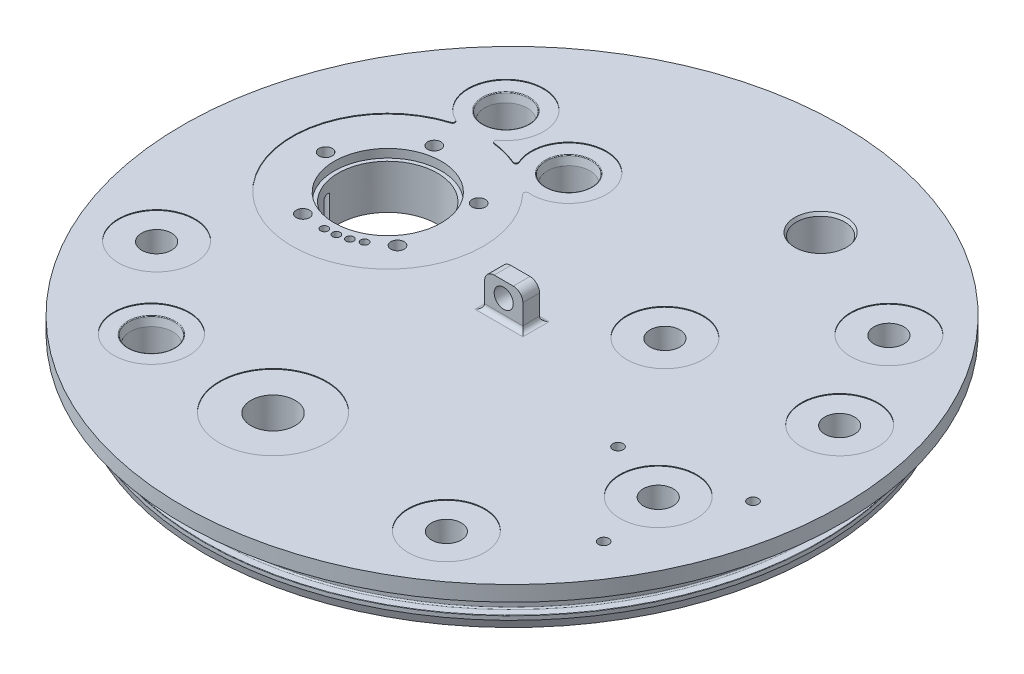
ISO-10303-21;
HEADER;
FILE_DESCRIPTION(('STEP AP214'),'2;1');
FILE_NAME('part.step','',(''),(''),'','','');
FILE_SCHEMA(('AUTOMOTIVE_DESIGN { 1 0 10303 214 1 1 1 1 }'));
ENDSEC;
DATA;
#1=APPLICATION_CONTEXT('core data for automotive mechanical design processes');
#2=APPLICATION_PROTOCOL_DEFINITION('international standard','automotive_design',2000,#1);
#3=PRODUCT_CONTEXT('',#1,'mechanical');
#4=PRODUCT('Part','Part','',(#3));
#5=PRODUCT_RELATED_PRODUCT_CATEGORY('part','',(#4));
#6=PRODUCT_DEFINITION_FORMATION('','',#4);
#7=PRODUCT_DEFINITION_CONTEXT('part definition',#1,'design');
#8=PRODUCT_DEFINITION('design','',#6,#7);
#9=PRODUCT_DEFINITION_SHAPE('','',#8);
#10=(LENGTH_UNIT() NAMED_UNIT(*) SI_UNIT(.MILLI.,.METRE.));
#11=(NAMED_UNIT(*) PLANE_ANGLE_UNIT() SI_UNIT($,.RADIAN.));
#12=(NAMED_UNIT(*) SI_UNIT($,.STERADIAN.) SOLID_ANGLE_UNIT());
#13=UNCERTAINTY_MEASURE_WITH_UNIT(LENGTH_MEASURE(1.E-05),#10,'distance_accuracy_value','');
#14=(GEOMETRIC_REPRESENTATION_CONTEXT(3) GLOBAL_UNCERTAINTY_ASSIGNED_CONTEXT((#13)) GLOBAL_UNIT_ASSIGNED_CONTEXT((#10,
#11,#12)) REPRESENTATION_CONTEXT('',''));
#15=CARTESIAN_POINT('',(0.,0.,0.));
#16=DIRECTION('',(0.,0.,1.));
#17=DIRECTION('',(1.,0.,0.));
#18=AXIS2_PLACEMENT_3D('',#15,#16,#17);
#19=CARTESIAN_POINT('',(-101.897309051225,-12.7,0.));
#20=DIRECTION('',(0.,1.,0.));
#21=DIRECTION('',(0.,0.,1.));
#22=AXIS2_PLACEMENT_3D('',#19,#20,#21);
#23=PLANE('',#22);
#24=CARTESIAN_POINT('',(75.910035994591,-12.7,6.64126759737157));
#25=DIRECTION('',(0.,-1.,0.));
#26=DIRECTION('',(0.,0.,-1.));
#27=AXIS2_PLACEMENT_3D('',#24,#25,#26);
#28=CIRCLE('',#27,1.72719999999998);
#29=CARTESIAN_POINT('',(75.910035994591,-12.7,4.91406759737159));
#30=VERTEX_POINT('',#29);
#31=EDGE_CURVE('E273',#30,#30,#28,.T.);
#32=ORIENTED_EDGE('',*,*,#31,.F.);
#33=EDGE_LOOP('',(#32));
#34=FACE_BOUND('',#33,.T.);
#35=CARTESIAN_POINT('',(62.8058219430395,-12.7,-32.3698603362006));
#36=DIRECTION('',(0.,-1.,0.));
#37=DIRECTION('',(0.,0.,-1.));
#38=AXIS2_PLACEMENT_3D('',#35,#36,#37);
#39=CIRCLE('',#38,1.72719999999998);
#40=CARTESIAN_POINT('',(62.8058219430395,-12.7,-34.0970603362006));
#41=VERTEX_POINT('',#40);
#42=EDGE_CURVE('E279',#41,#41,#39,.T.);
#43=ORIENTED_EDGE('',*,*,#42,.F.);
#44=EDGE_LOOP('',(#43));
#45=FACE_BOUND('',#44,.T.);
#46=CARTESIAN_POINT('',(60.0627614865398,-12.7,-43.4658289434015));
#47=DIRECTION('',(0.,-1.,0.));
#48=DIRECTION('',(0.,0.,-1.));
#49=AXIS2_PLACEMENT_3D('',#46,#47,#48);
#50=CIRCLE('',#49,1.72719999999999);
#51=CARTESIAN_POINT('',(60.0627614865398,-12.7,-45.1930289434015));
#52=VERTEX_POINT('',#51);
#53=EDGE_CURVE('E285',#52,#52,#50,.T.);
#54=ORIENTED_EDGE('',*,*,#53,.F.);
#55=EDGE_LOOP('',(#54));
#56=FACE_BOUND('',#55,.T.);
#57=CARTESIAN_POINT('',(71.1587300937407,-12.7,-46.2088893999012));
#58=DIRECTION('',(0.,-1.,0.));
#59=DIRECTION('',(0.,0.,-1.));
#60=AXIS2_PLACEMENT_3D('',#57,#58,#59);
#61=CIRCLE('',#60,1.72719999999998);
#62=CARTESIAN_POINT('',(71.1587300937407,-12.7,-47.9360893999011));
#63=VERTEX_POINT('',#62);
#64=EDGE_CURVE('E291',#63,#63,#61,.T.);
#65=ORIENTED_EDGE('',*,*,#64,.F.);
#66=EDGE_LOOP('',(#65));
#67=FACE_BOUND('',#66,.T.);
#68=CARTESIAN_POINT('',(-70.6540226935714,-12.7,0.623061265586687));
#69=DIRECTION('',(0.,-1.,0.));
#70=DIRECTION('',(0.,0.,-1.));
#71=AXIS2_PLACEMENT_3D('',#68,#69,#70);
#72=CIRCLE('',#71,1.72719999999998);
#73=CARTESIAN_POINT('',(-70.6540226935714,-12.7,-1.1041387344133));
#74=VERTEX_POINT('',#73);
#75=EDGE_CURVE('E297',#74,#74,#72,.T.);
#76=ORIENTED_EDGE('',*,*,#75,.F.);
#77=EDGE_LOOP('',(#76));
#78=FACE_BOUND('',#77,.T.);
#79=CARTESIAN_POINT('',(27.3650316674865,-12.7,-75.1848065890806));
#80=DIRECTION('',(0.,-1.,0.));
#81=DIRECTION('',(0.,0.,-1.));
#82=AXIS2_PLACEMENT_3D('',#79,#80,#81);
#83=CIRCLE('',#82,8.02);
#84=CARTESIAN_POINT('',(27.3650316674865,-12.7,-83.2048065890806));
#85=VERTEX_POINT('',#84);
#86=EDGE_CURVE('E397',#85,#85,#83,.T.);
#87=ORIENTED_EDGE('',*,*,#86,.F.);
#88=EDGE_LOOP('',(#87));
#89=FACE_BOUND('',#88,.T.);
#90=CARTESIAN_POINT('',(0.,-12.7,0.));
#91=DIRECTION('',(0.,-1.,0.));
#92=DIRECTION('',(0.,0.,-1.));
#93=AXIS2_PLACEMENT_3D('',#90,#91,#92);
#94=CIRCLE('',#93,101.897309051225);
#95=CARTESIAN_POINT('',(0.,-12.7,-101.897309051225));
#96=VERTEX_POINT('',#95);
#97=EDGE_CURVE('E606',#96,#96,#94,.T.);
#98=ORIENTED_EDGE('',*,*,#97,.T.);
#99=EDGE_LOOP('',(#98));
#100=FACE_BOUND('',#99,.T.);
#101=CARTESIAN_POINT('',(-45.8883867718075,-12.7,3.1373389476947));
#102=DIRECTION('',(0.,1.,0.));
#103=DIRECTION('',(0.,0.,1.));
#104=AXIS2_PLACEMENT_3D('',#101,#102,#103);
#105=CIRCLE('',#104,1.26999999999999);
#106=CARTESIAN_POINT('',(-45.8883867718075,-12.7,4.4073389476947));
#107=VERTEX_POINT('',#106);
#108=EDGE_CURVE('E520',#107,#107,#105,.T.);
#109=ORIENTED_EDGE('',*,*,#108,.T.);
#110=EDGE_LOOP('',(#109));
#111=FACE_BOUND('',#110,.T.);
#112=CARTESIAN_POINT('',(-49.2189181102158,-12.7,4.69039121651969));
#113=DIRECTION('',(0.,1.,0.));
#114=DIRECTION('',(0.,0.,1.));
#115=AXIS2_PLACEMENT_3D('',#112,#113,#114);
#116=CIRCLE('',#115,1.26999999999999);
#117=CARTESIAN_POINT('',(-49.2189181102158,-12.7,5.96039121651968));
#118=VERTEX_POINT('',#117);
#119=EDGE_CURVE('E516',#118,#118,#116,.T.);
#120=ORIENTED_EDGE('',*,*,#119,.T.);
#121=EDGE_LOOP('',(#120));
#122=FACE_BOUND('',#121,.T.);
#123=CARTESIAN_POINT('',(-52.7685358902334,-12.7,5.64150843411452));
#124=DIRECTION('',(0.,1.,0.));
#125=DIRECTION('',(0.,0.,1.));
#126=AXIS2_PLACEMENT_3D('',#123,#124,#125);
#127=CIRCLE('',#126,1.26999999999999);
#128=CARTESIAN_POINT('',(-52.7685358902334,-12.7,6.91150843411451));
#129=VERTEX_POINT('',#128);
#130=EDGE_CURVE('E512',#129,#129,#127,.T.);
#131=ORIENTED_EDGE('',*,*,#130,.T.);
#132=EDGE_LOOP('',(#131));
#133=FACE_BOUND('',#132,.T.);
#134=CARTESIAN_POINT('',(-56.4293867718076,-12.7,5.96179138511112));
#135=DIRECTION('',(0.,1.,0.));
#136=DIRECTION('',(0.,0.,1.));
#137=AXIS2_PLACEMENT_3D('',#134,#135,#136);
#138=CIRCLE('',#137,1.26999999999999);
#139=CARTESIAN_POINT('',(-56.4293867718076,-12.7,7.23179138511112));
#140=VERTEX_POINT('',#139);
#141=EDGE_CURVE('E506',#140,#140,#138,.T.);
#142=ORIENTED_EDGE('',*,*,#141,.T.);
#143=EDGE_LOOP('',(#142));
#144=FACE_BOUND('',#143,.T.);
#145=CARTESIAN_POINT('',(-38.1094668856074,-12.7,-27.0173036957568));
#146=DIRECTION('',(0.,1.,0.));
#147=DIRECTION('',(0.,0.,1.));
#148=AXIS2_PLACEMENT_3D('',#145,#146,#147);
#149=CIRCLE('',#148,2.19709999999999);
#150=CARTESIAN_POINT('',(-38.1094668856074,-12.7,-24.8202036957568));
#151=VERTEX_POINT('',#150);
#152=EDGE_CURVE('E502',#151,#151,#149,.T.);
#153=ORIENTED_EDGE('',*,*,#152,.T.);
#154=EDGE_LOOP('',(#153));
#155=FACE_BOUND('',#154,.T.);
#156=CARTESIAN_POINT('',(-39.4534103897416,-12.7,-1.37333399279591));
#157=DIRECTION('',(0.,1.,0.));
#158=DIRECTION('',(0.,0.,1.));
#159=AXIS2_PLACEMENT_3D('',#156,#157,#158);
#160=CIRCLE('',#159,2.19709999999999);
#161=CARTESIAN_POINT('',(-39.4534103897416,-12.7,0.823766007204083));
#162=VERTEX_POINT('',#161);
#163=EDGE_CURVE('E496',#162,#162,#160,.T.);
#164=ORIENTED_EDGE('',*,*,#163,.T.);
#165=EDGE_LOOP('',(#164));
#166=FACE_BOUND('',#165,.T.);
#167=CARTESIAN_POINT('',(-64.2575762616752,-12.7,5.27292222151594));
#168=DIRECTION('',(0.,1.,0.));
#169=DIRECTION('',(0.,0.,1.));
#170=AXIS2_PLACEMENT_3D('',#167,#168,#169);
#171=CIRCLE('',#170,2.19709999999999);
#172=CARTESIAN_POINT('',(-64.2575762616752,-12.7,7.47002222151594));
#173=VERTEX_POINT('',#172);
#174=EDGE_CURVE('E490',#173,#173,#171,.T.);
#175=ORIENTED_EDGE('',*,*,#174,.T.);
#176=EDGE_LOOP('',(#175));
#177=FACE_BOUND('',#176,.T.);
#178=CARTESIAN_POINT('',(-78.2434503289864,-12.7,-16.26343524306));
#179=DIRECTION('',(0.,1.,0.));
#180=DIRECTION('',(0.,0.,1.));
#181=AXIS2_PLACEMENT_3D('',#178,#179,#180);
#182=CIRCLE('',#181,2.19709999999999);
#183=CARTESIAN_POINT('',(-78.2434503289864,-12.7,-14.06633524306));
#184=VERTEX_POINT('',#183);
#185=EDGE_CURVE('E484',#184,#184,#182,.T.);
#186=ORIENTED_EDGE('',*,*,#185,.T.);
#187=EDGE_LOOP('',(#186));
#188=FACE_BOUND('',#187,.T.);
#189=CARTESIAN_POINT('',(-62.0830299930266,-12.7,-36.2198923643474));
#190=DIRECTION('',(0.,1.,0.));
#191=DIRECTION('',(0.,0.,1.));
#192=AXIS2_PLACEMENT_3D('',#189,#190,#191);
#193=CIRCLE('',#192,2.19709999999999);
#194=CARTESIAN_POINT('',(-62.0830299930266,-12.7,-34.0227923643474));
#195=VERTEX_POINT('',#194);
#196=EDGE_CURVE('E478',#195,#195,#193,.T.);
#197=ORIENTED_EDGE('',*,*,#196,.T.);
#198=EDGE_LOOP('',(#197));
#199=FACE_BOUND('',#198,.T.);
#200=CARTESIAN_POINT('',(-60.1927717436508,-12.7,-58.1358956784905));
#201=DIRECTION('',(0.,1.,0.));
#202=DIRECTION('',(0.,0.,1.));
#203=AXIS2_PLACEMENT_3D('',#200,#201,#202);
#204=CIRCLE('',#203,6.54812);
#205=CARTESIAN_POINT('',(-60.1927717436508,-12.7,-51.5877756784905));
#206=VERTEX_POINT('',#205);
#207=EDGE_CURVE('E477',#206,#206,#204,.T.);
#208=ORIENTED_EDGE('',*,*,#207,.T.);
#209=EDGE_LOOP('',(#208));
#210=FACE_BOUND('',#209,.T.);
#211=CARTESIAN_POINT('',(-31.6623562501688,-12.7,-50.4911938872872));
#212=DIRECTION('',(0.,1.,0.));
#213=DIRECTION('',(0.,0.,1.));
#214=AXIS2_PLACEMENT_3D('',#211,#212,#213);
#215=CIRCLE('',#214,6.54812000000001);
#216=CARTESIAN_POINT('',(-31.6623562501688,-12.7,-43.9430738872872));
#217=VERTEX_POINT('',#216);
#218=EDGE_CURVE('E452',#217,#217,#215,.T.);
#219=ORIENTED_EDGE('',*,*,#218,.T.);
#220=EDGE_LOOP('',(#219));
#221=FACE_BOUND('',#220,.T.);
#222=CARTESIAN_POINT('',(-54.6947977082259,-12.7,65.1827216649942));
#223=DIRECTION('',(0.,1.,0.));
#224=DIRECTION('',(0.,0.,1.));
#225=AXIS2_PLACEMENT_3D('',#222,#223,#224);
#226=CIRCLE('',#225,6.54812);
#227=CARTESIAN_POINT('',(-54.6947977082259,-12.7,71.7308416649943));
#228=VERTEX_POINT('',#227);
#229=EDGE_CURVE('E427',#228,#228,#226,.T.);
#230=ORIENTED_EDGE('',*,*,#229,.T.);
#231=EDGE_LOOP('',(#230));
#232=FACE_BOUND('',#231,.T.);
#233=CARTESIAN_POINT('',(-11.9087920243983,-12.7,67.5381157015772));
#234=DIRECTION('',(0.,1.,0.));
#235=DIRECTION('',(0.,0.,1.));
#236=AXIS2_PLACEMENT_3D('',#233,#234,#235);
#237=CIRCLE('',#236,7.34186999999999);
#238=CARTESIAN_POINT('',(-11.9087920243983,-12.7,74.8799857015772));
#239=VERTEX_POINT('',#238);
#240=EDGE_CURVE('E391',#239,#239,#237,.T.);
#241=ORIENTED_EDGE('',*,*,#240,.T.);
#242=EDGE_LOOP('',(#241));
#243=FACE_BOUND('',#242,.T.);
#244=CARTESIAN_POINT('',(-80.5707622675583,-12.7,37.570763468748));
#245=DIRECTION('',(0.,1.,0.));
#246=DIRECTION('',(0.,0.,1.));
#247=AXIS2_PLACEMENT_3D('',#244,#245,#246);
#248=CIRCLE('',#247,4.96062);
#249=CARTESIAN_POINT('',(-80.5707622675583,-12.7,42.531383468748));
#250=VERTEX_POINT('',#249);
#251=EDGE_CURVE('E342',#250,#250,#248,.T.);
#252=ORIENTED_EDGE('',*,*,#251,.T.);
#253=EDGE_LOOP('',(#252));
#254=FACE_BOUND('',#253,.T.);
#255=CARTESIAN_POINT('',(31.75,-12.7,-19.05));
#256=DIRECTION('',(0.,1.,0.));
#257=DIRECTION('',(0.,0.,1.));
#258=AXIS2_PLACEMENT_3D('',#255,#256,#257);
#259=CIRCLE('',#258,4.96061999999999);
#260=CARTESIAN_POINT('',(31.75,-12.7,-14.08938));
#261=VERTEX_POINT('',#260);
#262=EDGE_CURVE('E336',#261,#261,#259,.T.);
#263=ORIENTED_EDGE('',*,*,#262,.T.);
#264=EDGE_LOOP('',(#263));
#265=FACE_BOUND('',#264,.T.);
#266=CARTESIAN_POINT('',(85.8708059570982,-12.7,-23.0090131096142));
#267=DIRECTION('',(0.,1.,0.));
#268=DIRECTION('',(0.,0.,1.));
#269=AXIS2_PLACEMENT_3D('',#266,#267,#268);
#270=CIRCLE('',#269,4.96062);
#271=CARTESIAN_POINT('',(85.8708059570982,-12.7,-18.0483931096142));
#272=VERTEX_POINT('',#271);
#273=EDGE_CURVE('E330',#272,#272,#270,.T.);
#274=ORIENTED_EDGE('',*,*,#273,.T.);
#275=EDGE_LOOP('',(#274));
#276=FACE_BOUND('',#275,.T.);
#277=CARTESIAN_POINT('',(76.3782162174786,-12.7,27.7993972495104));
#278=DIRECTION('',(0.,1.,0.));
#279=DIRECTION('',(0.,0.,1.));
#280=AXIS2_PLACEMENT_3D('',#277,#278,#279);
#281=CIRCLE('',#280,4.96062);
#282=CARTESIAN_POINT('',(76.3782162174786,-12.7,32.7600172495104));
#283=VERTEX_POINT('',#282);
#284=EDGE_CURVE('E324',#283,#283,#281,.T.);
#285=ORIENTED_EDGE('',*,*,#284,.T.);
#286=EDGE_LOOP('',(#285));
#287=FACE_BOUND('',#286,.T.);
#288=CARTESIAN_POINT('',(68.1013509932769,-12.7,-57.1438185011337));
#289=DIRECTION('',(0.,1.,0.));
#290=DIRECTION('',(0.,0.,1.));
#291=AXIS2_PLACEMENT_3D('',#288,#289,#290);
#292=CIRCLE('',#291,4.96062);
#293=CARTESIAN_POINT('',(68.1013509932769,-12.7,-52.1831985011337));
#294=VERTEX_POINT('',#293);
#295=EDGE_CURVE('E318',#294,#294,#292,.T.);
#296=ORIENTED_EDGE('',*,*,#295,.T.);
#297=EDGE_LOOP('',(#296));
#298=FACE_BOUND('',#297,.T.);
#299=CARTESIAN_POINT('',(50.9909451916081,-12.7,72.8226167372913));
#300=DIRECTION('',(0.,1.,0.));
#301=DIRECTION('',(0.,0.,1.));
#302=AXIS2_PLACEMENT_3D('',#299,#300,#301);
#303=CIRCLE('',#302,4.96061999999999);
#304=CARTESIAN_POINT('',(50.9909451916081,-12.7,77.7832367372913));
#305=VERTEX_POINT('',#304);
#306=EDGE_CURVE('E311',#305,#305,#303,.T.);
#307=ORIENTED_EDGE('',*,*,#306,.T.);
#308=EDGE_LOOP('',(#307));
#309=FACE_BOUND('',#308,.T.);
#310=CARTESIAN_POINT('',(-84.4930517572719,-12.7,-7.72984688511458));
#311=DIRECTION('',(0.,-1.,0.));
#312=DIRECTION('',(0.,0.,-1.));
#313=AXIS2_PLACEMENT_3D('',#310,#311,#312);
#314=CIRCLE('',#313,1.72719999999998);
#315=CARTESIAN_POINT('',(-84.4930517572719,-12.7,-9.45704688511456));
#316=VERTEX_POINT('',#315);
#317=EDGE_CURVE('E304',#316,#316,#314,.T.);
#318=ORIENTED_EDGE('',*,*,#317,.F.);
#319=EDGE_LOOP('',(#318));
#320=FACE_BOUND('',#319,.T.);
#321=CARTESIAN_POINT('',(-73.397083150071,-12.7,-10.4729073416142));
#322=DIRECTION('',(0.,-1.,0.));
#323=DIRECTION('',(0.,0.,-1.));
#324=AXIS2_PLACEMENT_3D('',#321,#322,#323);
#325=CIRCLE('',#324,1.72719999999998);
#326=CARTESIAN_POINT('',(-71.9591501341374,-12.7,-9.51605391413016));
#327=VERTEX_POINT('',#326);
#328=CARTESIAN_POINT('',(-72.6474040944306,-12.7,-12.028928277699));
#329=VERTEX_POINT('',#328);
#330=EDGE_CURVE('E12',#327,#329,#325,.T.);
#331=ORIENTED_EDGE('',*,*,#330,.F.);
#332=CARTESIAN_POINT('',(-56.4293867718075,-12.7,-15.1202086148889));
#333=DIRECTION('',(0.,1.,0.));
#334=DIRECTION('',(0.,0.,1.));
#335=AXIS2_PLACEMENT_3D('',#332,#333,#334);
#336=CIRCLE('',#335,16.51);
#337=EDGE_CURVE('E539',#327,#329,#336,.T.);
#338=ORIENTED_EDGE('',*,*,#337,.T.);
#339=EDGE_LOOP('',(#331,#338));
#340=FACE_BOUND('',#339,.T.);
#341=CARTESIAN_POINT('',(62.4193857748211,-12.7,43.7065244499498));
#342=DIRECTION('',(0.,-1.,0.));
#343=DIRECTION('',(0.,0.,-1.));
#344=AXIS2_PLACEMENT_3D('',#341,#342,#343);
#345=CIRCLE('',#344,1.72719999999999);
#346=CARTESIAN_POINT('',(62.4193857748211,-12.7,41.9793244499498));
#347=VERTEX_POINT('',#346);
#348=EDGE_CURVE('E249',#347,#347,#345,.T.);
#349=ORIENTED_EDGE('',*,*,#348,.F.);
#350=EDGE_LOOP('',(#349));
#351=FACE_BOUND('',#350,.T.);
#352=CARTESIAN_POINT('',(32.2035115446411,-12.7,69.0606533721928));
#353=DIRECTION('',(0.,-1.,0.));
#354=DIRECTION('',(0.,0.,-1.));
#355=AXIS2_PLACEMENT_3D('',#352,#353,#354);
#356=CIRCLE('',#355,1.72719999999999);
#357=CARTESIAN_POINT('',(32.2035115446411,-12.7,67.3334533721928));
#358=VERTEX_POINT('',#357);
#359=EDGE_CURVE('E243',#358,#358,#356,.T.);
#360=ORIENTED_EDGE('',*,*,#359,.F.);
#361=EDGE_LOOP('',(#360));
#362=FACE_BOUND('',#361,.T.);
#363=CARTESIAN_POINT('',(-69.0606533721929,-12.7,32.2035115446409));
#364=DIRECTION('',(0.,-1.,0.));
#365=DIRECTION('',(0.,0.,-1.));
#366=AXIS2_PLACEMENT_3D('',#363,#364,#365);
#367=CIRCLE('',#366,1.72719999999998);
#368=CARTESIAN_POINT('',(-69.0606533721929,-12.7,30.4763115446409));
#369=VERTEX_POINT('',#368);
#370=EDGE_CURVE('E237',#369,#369,#367,.T.);
#371=ORIENTED_EDGE('',*,*,#370,.F.);
#372=EDGE_LOOP('',(#371));
#373=FACE_BOUND('',#372,.T.);
#374=CARTESIAN_POINT('',(-32.2035115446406,-12.7,-69.060653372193));
#375=DIRECTION('',(0.,-1.,0.));
#376=DIRECTION('',(0.,0.,-1.));
#377=AXIS2_PLACEMENT_3D('',#374,#375,#376);
#378=CIRCLE('',#377,1.72719999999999);
#379=CARTESIAN_POINT('',(-32.2035115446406,-12.7,-70.787853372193));
#380=VERTEX_POINT('',#379);
#381=EDGE_CURVE('E231',#380,#380,#378,.T.);
#382=ORIENTED_EDGE('',*,*,#381,.F.);
#383=EDGE_LOOP('',(#382));
#384=FACE_BOUND('',#383,.T.);
#385=CARTESIAN_POINT('',(43.7065244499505,-12.7,-62.4193857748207));
#386=DIRECTION('',(0.,-1.,0.));
#387=DIRECTION('',(0.,0.,-1.));
#388=AXIS2_PLACEMENT_3D('',#385,#386,#387);
#389=CIRCLE('',#388,1.72719999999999);
#390=CARTESIAN_POINT('',(43.7065244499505,-12.7,-64.1465857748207));
#391=VERTEX_POINT('',#390);
#392=EDGE_CURVE('E220',#391,#391,#389,.T.);
#393=ORIENTED_EDGE('',*,*,#392,.F.);
#394=EDGE_LOOP('',(#393));
#395=FACE_BOUND('',#394,.T.);
#396=CARTESIAN_POINT('',(69.0606533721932,-12.7,-32.2035115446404));
#397=DIRECTION('',(0.,-1.,0.));
#398=DIRECTION('',(0.,0.,-1.));
#399=AXIS2_PLACEMENT_3D('',#396,#397,#398);
#400=CIRCLE('',#399,1.72719999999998);
#401=CARTESIAN_POINT('',(69.0606533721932,-12.7,-33.9307115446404));
#402=VERTEX_POINT('',#401);
#403=EDGE_CURVE('E221',#402,#402,#400,.T.);
#404=ORIENTED_EDGE('',*,*,#403,.F.);
#405=EDGE_LOOP('',(#404));
#406=FACE_BOUND('',#405,.T.);
#407=ADVANCED_FACE('F37',(#34,#45,#56,#67,#78,#89,#100,#111,#122,#133,#144,#155,#166,#177,#188,
#199,#210,#221,#232,#243,#254,#265,#276,#287,#298,#309,#320,#340,#351,#362,#373,#384,#395,#406),
#23,.F.);
#408=CARTESIAN_POINT('',(-56.4293867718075,4.82599999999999,-15.1202086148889));
#409=DIRECTION('',(0.,1.,0.));
#410=DIRECTION('',(0.,0.,1.));
#411=AXIS2_PLACEMENT_3D('',#408,#409,#410);
#412=CYLINDRICAL_SURFACE('',#411,31.75);
#413=CARTESIAN_POINT('',(-56.4293867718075,5.07999999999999,-15.1202086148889));
#414=DIRECTION('',(0.,1.,0.));
#415=DIRECTION('',(0.,0.,1.));
#416=AXIS2_PLACEMENT_3D('',#413,#414,#415);
#417=CIRCLE('',#416,31.75);
#418=CARTESIAN_POINT('',(-44.0595581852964,5.07999999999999,-44.3614438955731));
#419=VERTEX_POINT('',#418);
#420=CARTESIAN_POINT('',(-52.521354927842,5.07999999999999,-46.6287754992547));
#421=VERTEX_POINT('',#420);
#422=EDGE_CURVE('E529',#419,#421,#417,.T.);
#423=ORIENTED_EDGE('',*,*,#422,.T.);
#424=DIRECTION('',(0.,1.,0.));
#425=VECTOR('',#424,1.);
#426=CARTESIAN_POINT('',(-52.521354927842,4.82599999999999,-46.6287754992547));
#427=LINE('',#426,#425);
#428=CARTESIAN_POINT('',(-52.521354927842,4.82599999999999,-46.6287754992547));
#429=VERTEX_POINT('',#428);
#430=EDGE_CURVE('E660',#421,#429,#427,.F.);
#431=ORIENTED_EDGE('',*,*,#430,.T.);
#432=CARTESIAN_POINT('',(-56.4293867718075,4.82599999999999,-15.1202086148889));
#433=DIRECTION('',(0.,1.,0.));
#434=DIRECTION('',(0.,0.,1.));
#435=AXIS2_PLACEMENT_3D('',#432,#433,#434);
#436=CIRCLE('',#435,31.75);
#437=CARTESIAN_POINT('',(-44.0595581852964,4.82599999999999,-44.3614438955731));
#438=VERTEX_POINT('',#437);
#439=EDGE_CURVE('E524',#438,#429,#436,.T.);
#440=ORIENTED_EDGE('',*,*,#439,.F.);
#441=DIRECTION('',(0.,1.,0.));
#442=VECTOR('',#441,1.);
#443=CARTESIAN_POINT('',(-44.0595581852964,4.82599999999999,-44.3614438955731));
#444=LINE('',#443,#442);
#445=EDGE_CURVE('E657',#438,#419,#444,.T.);
#446=ORIENTED_EDGE('',*,*,#445,.T.);
#447=EDGE_LOOP('',(#423,#431,#440,#446));
#448=FACE_BOUND('',#447,.T.);
#449=ADVANCED_FACE('F956',(#448),#412,.F.);
#450=CARTESIAN_POINT('',(-56.4293867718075,5.07999999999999,-15.1202086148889));
#451=DIRECTION('',(0.,1.,0.));
#452=DIRECTION('',(0.,0.,1.));
#453=AXIS2_PLACEMENT_3D('',#450,#451,#452);
#454=CYLINDRICAL_SURFACE('',#453,17.78);
#455=CARTESIAN_POINT('',(-56.4293867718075,2.03199999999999,-15.1202086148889));
#456=DIRECTION('',(0.,1.,0.));
#457=DIRECTION('',(0.,0.,1.));
#458=AXIS2_PLACEMENT_3D('',#455,#456,#457);
#459=CIRCLE('',#458,17.78);
#460=CARTESIAN_POINT('',(-56.4293867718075,2.03199999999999,2.65979138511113));
#461=VERTEX_POINT('',#460);
#462=EDGE_CURVE('E532',#461,#461,#459,.T.);
#463=ORIENTED_EDGE('',*,*,#462,.F.);
#464=EDGE_LOOP('',(#463));
#465=FACE_BOUND('',#464,.T.);
#466=CARTESIAN_POINT('',(-56.4293867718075,4.82599999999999,-15.1202086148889));
#467=DIRECTION('',(0.,1.,0.));
#468=DIRECTION('',(0.,0.,1.));
#469=AXIS2_PLACEMENT_3D('',#466,#467,#468);
#470=CIRCLE('',#469,17.78);
#471=CARTESIAN_POINT('',(-56.4293867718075,4.82599999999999,2.65979138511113));
#472=VERTEX_POINT('',#471);
#473=EDGE_CURVE('E536',#472,#472,#470,.F.);
#474=ORIENTED_EDGE('',*,*,#473,.F.);
#475=EDGE_LOOP('',(#474));
#476=FACE_BOUND('',#475,.T.);
#477=ADVANCED_FACE('F957',(#465,#476),#454,.F.);
#478=CARTESIAN_POINT('',(0.,-18.420388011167,0.));
#479=DIRECTION('',(0.,-1.,0.));
#480=DIRECTION('',(0.,0.,-1.));
#481=AXIS2_PLACEMENT_3D('',#478,#479,#480);
#482=CYLINDRICAL_SURFACE('',#481,102.5779);
#483=CARTESIAN_POINT('',(0.,0.,0.));
#484=DIRECTION('',(0.,-1.,0.));
#485=DIRECTION('',(0.,0.,-1.));
#486=AXIS2_PLACEMENT_3D('',#483,#484,#485);
#487=CIRCLE('',#486,102.5779);
#488=CARTESIAN_POINT('',(0.,0.,-102.5779));
#489=VERTEX_POINT('',#488);
#490=EDGE_CURVE('E612',#489,#489,#487,.T.);
#491=ORIENTED_EDGE('',*,*,#490,.T.);
#492=EDGE_LOOP('',(#491));
#493=FACE_BOUND('',#492,.T.);
#494=CARTESIAN_POINT('',(0.,-3.81635000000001,0.));
#495=DIRECTION('',(0.,1.,0.));
#496=DIRECTION('',(0.,0.,1.));
#497=AXIS2_PLACEMENT_3D('',#494,#495,#496);
#498=CIRCLE('',#497,102.5779);
#499=CARTESIAN_POINT('',(0.,-3.81635000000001,102.5779));
#500=VERTEX_POINT('',#499);
#501=EDGE_CURVE('E563',#500,#500,#498,.T.);
#502=ORIENTED_EDGE('',*,*,#501,.T.);
#503=EDGE_LOOP('',(#502));
#504=FACE_BOUND('',#503,.T.);
#505=ADVANCED_FACE('F959',(#493,#504),#482,.T.);
#506=CARTESIAN_POINT('',(0.,5.07999999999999,0.));
#507=DIRECTION('',(0.,-1.,0.));
#508=DIRECTION('',(0.,0.,-1.));
#509=AXIS2_PLACEMENT_3D('',#506,#507,#508);
#510=PLANE('',#509);
#511=CARTESIAN_POINT('',(80.2596002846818,5.07999999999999,49.8118201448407));
#512=DIRECTION('',(0.,1.,0.));
#513=DIRECTION('',(0.,0.,1.));
#514=AXIS2_PLACEMENT_3D('',#511,#512,#513);
#515=CIRCLE('',#514,1.72719999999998);
#516=CARTESIAN_POINT('',(80.2596002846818,5.07999999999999,51.5390201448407));
#517=VERTEX_POINT('',#516);
#518=EDGE_CURVE('E255',#517,#517,#515,.T.);
#519=ORIENTED_EDGE('',*,*,#518,.F.);
#520=EDGE_LOOP('',(#519));
#521=FACE_BOUND('',#520,.T.);
#522=CARTESIAN_POINT('',(93.5008416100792,5.07999999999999,13.4318085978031));
#523=DIRECTION('',(0.,1.,0.));
#524=DIRECTION('',(0.,0.,1.));
#525=AXIS2_PLACEMENT_3D('',#522,#523,#524);
#526=CIRCLE('',#525,1.72719999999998);
#527=CARTESIAN_POINT('',(93.5008416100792,5.07999999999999,15.1590085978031));
#528=VERTEX_POINT('',#527);
#529=EDGE_CURVE('E261',#528,#528,#526,.T.);
#530=ORIENTED_EDGE('',*,*,#529,.F.);
#531=EDGE_LOOP('',(#530));
#532=FACE_BOUND('',#531,.T.);
#533=CARTESIAN_POINT('',(55.3742067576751,5.07999999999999,20.1545630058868));
#534=DIRECTION('',(0.,1.,0.));
#535=DIRECTION('',(0.,0.,1.));
#536=AXIS2_PLACEMENT_3D('',#533,#534,#535);
#537=CIRCLE('',#536,1.72719999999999);
#538=CARTESIAN_POINT('',(55.3742067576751,5.07999999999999,21.8817630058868));
#539=VERTEX_POINT('',#538);
#540=EDGE_CURVE('E267',#539,#539,#537,.T.);
#541=ORIENTED_EDGE('',*,*,#540,.F.);
#542=EDGE_LOOP('',(#541));
#543=FACE_BOUND('',#542,.T.);
#544=DIRECTION('',(1.,0.,0.));
#545=VECTOR('',#544,1.);
#546=CARTESIAN_POINT('',(6.35,5.07999999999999,-4.365625));
#547=LINE('',#546,#545);
#548=CARTESIAN_POINT('',(-7.9375,5.07999999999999,-4.365625));
#549=VERTEX_POINT('',#548);
#550=CARTESIAN_POINT('',(7.9375,5.07999999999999,-4.365625));
#551=VERTEX_POINT('',#550);
#552=EDGE_CURVE('E682',#549,#551,#547,.T.);
#553=ORIENTED_EDGE('',*,*,#552,.T.);
#554=DIRECTION('',(0.,0.,-1.));
#555=VECTOR('',#554,1.);
#556=CARTESIAN_POINT('',(7.9375,5.07999999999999,2.778125));
#557=LINE('',#556,#555);
#558=CARTESIAN_POINT('',(7.9375,5.07999999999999,4.365625));
#559=VERTEX_POINT('',#558);
#560=EDGE_CURVE('E684',#551,#559,#557,.F.);
#561=ORIENTED_EDGE('',*,*,#560,.T.);
#562=DIRECTION('',(1.,0.,0.));
#563=VECTOR('',#562,1.);
#564=CARTESIAN_POINT('',(0.,5.07999999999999,4.365625));
#565=LINE('',#564,#563);
#566=CARTESIAN_POINT('',(-7.9375,5.07999999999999,4.365625));
#567=VERTEX_POINT('',#566);
#568=EDGE_CURVE('E678',#559,#567,#565,.F.);
#569=ORIENTED_EDGE('',*,*,#568,.T.);
#570=DIRECTION('',(0.,0.,-1.));
#571=VECTOR('',#570,1.);
#572=CARTESIAN_POINT('',(-7.9375,5.07999999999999,-2.778125));
#573=LINE('',#572,#571);
#574=EDGE_CURVE('E680',#567,#549,#573,.T.);
#575=ORIENTED_EDGE('',*,*,#574,.T.);
#576=EDGE_LOOP('',(#553,#561,#569,#575));
#577=FACE_BOUND('',#576,.T.);
#578=CARTESIAN_POINT('',(85.8708059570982,5.07999999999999,-23.0090131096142));
#579=DIRECTION('',(0.,1.,0.));
#580=DIRECTION('',(0.,0.,1.));
#581=AXIS2_PLACEMENT_3D('',#578,#579,#580);
#582=CIRCLE('',#581,12.7);
#583=CARTESIAN_POINT('',(85.8708059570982,5.07999999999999,-10.3090131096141));
#584=VERTEX_POINT('',#583);
#585=EDGE_CURVE('E348',#584,#584,#582,.T.);
#586=ORIENTED_EDGE('',*,*,#585,.F.);
#587=EDGE_LOOP('',(#586));
#588=FACE_BOUND('',#587,.T.);
#589=CARTESIAN_POINT('',(50.9909451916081,5.07999999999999,72.8226167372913));
#590=DIRECTION('',(0.,1.,0.));
#591=DIRECTION('',(0.,0.,1.));
#592=AXIS2_PLACEMENT_3D('',#589,#590,#591);
#593=CIRCLE('',#592,12.7);
#594=CARTESIAN_POINT('',(50.9909451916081,5.07999999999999,85.5226167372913));
#595=VERTEX_POINT('',#594);
#596=EDGE_CURVE('E354',#595,#595,#593,.T.);
#597=ORIENTED_EDGE('',*,*,#596,.F.);
#598=EDGE_LOOP('',(#597));
#599=FACE_BOUND('',#598,.T.);
#600=CARTESIAN_POINT('',(68.1013509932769,5.07999999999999,-57.1438185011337));
#601=DIRECTION('',(0.,1.,0.));
#602=DIRECTION('',(0.,0.,1.));
#603=AXIS2_PLACEMENT_3D('',#600,#601,#602);
#604=CIRCLE('',#603,12.7);
#605=CARTESIAN_POINT('',(68.1013509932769,5.07999999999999,-44.4438185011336));
#606=VERTEX_POINT('',#605);
#607=EDGE_CURVE('E360',#606,#606,#604,.T.);
#608=ORIENTED_EDGE('',*,*,#607,.F.);
#609=EDGE_LOOP('',(#608));
#610=FACE_BOUND('',#609,.T.);
#611=CARTESIAN_POINT('',(76.3782162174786,5.07999999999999,27.7993972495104));
#612=DIRECTION('',(0.,1.,0.));
#613=DIRECTION('',(0.,0.,1.));
#614=AXIS2_PLACEMENT_3D('',#611,#612,#613);
#615=CIRCLE('',#614,12.7);
#616=CARTESIAN_POINT('',(76.3782162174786,5.07999999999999,40.4993972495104));
#617=VERTEX_POINT('',#616);
#618=EDGE_CURVE('E366',#617,#617,#615,.T.);
#619=ORIENTED_EDGE('',*,*,#618,.F.);
#620=EDGE_LOOP('',(#619));
#621=FACE_BOUND('',#620,.T.);
#622=CARTESIAN_POINT('',(31.75,5.07999999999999,-19.05));
#623=DIRECTION('',(0.,1.,0.));
#624=DIRECTION('',(0.,0.,1.));
#625=AXIS2_PLACEMENT_3D('',#622,#623,#624);
#626=CIRCLE('',#625,12.7);
#627=CARTESIAN_POINT('',(31.75,5.07999999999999,-6.34999999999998));
#628=VERTEX_POINT('',#627);
#629=EDGE_CURVE('E372',#628,#628,#626,.T.);
#630=ORIENTED_EDGE('',*,*,#629,.F.);
#631=EDGE_LOOP('',(#630));
#632=FACE_BOUND('',#631,.T.);
#633=CARTESIAN_POINT('',(-80.5707622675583,5.07999999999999,37.570763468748));
#634=DIRECTION('',(0.,1.,0.));
#635=DIRECTION('',(0.,0.,1.));
#636=AXIS2_PLACEMENT_3D('',#633,#634,#635);
#637=CIRCLE('',#636,12.7);
#638=CARTESIAN_POINT('',(-80.5707622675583,5.07999999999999,50.270763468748));
#639=VERTEX_POINT('',#638);
#640=EDGE_CURVE('E378',#639,#639,#637,.T.);
#641=ORIENTED_EDGE('',*,*,#640,.F.);
#642=EDGE_LOOP('',(#641));
#643=FACE_BOUND('',#642,.T.);
#644=CARTESIAN_POINT('',(-11.9087920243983,5.07999999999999,67.5381157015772));
#645=DIRECTION('',(0.,1.,0.));
#646=DIRECTION('',(0.,0.,1.));
#647=AXIS2_PLACEMENT_3D('',#644,#645,#646);
#648=CIRCLE('',#647,17.78);
#649=CARTESIAN_POINT('',(-11.9087920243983,5.07999999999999,85.3181157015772));
#650=VERTEX_POINT('',#649);
#651=EDGE_CURVE('E384',#650,#650,#648,.T.);
#652=ORIENTED_EDGE('',*,*,#651,.F.);
#653=EDGE_LOOP('',(#652));
#654=FACE_BOUND('',#653,.T.);
#655=CARTESIAN_POINT('',(27.3650316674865,5.07999999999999,-75.1848065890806));
#656=DIRECTION('',(0.,-1.,0.));
#657=DIRECTION('',(0.,0.,-1.));
#658=AXIS2_PLACEMENT_3D('',#655,#656,#657);
#659=CIRCLE('',#658,8.606588);
#660=CARTESIAN_POINT('',(27.3650316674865,5.07999999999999,-83.7913945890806));
#661=VERTEX_POINT('',#660);
#662=EDGE_CURVE('E394',#661,#661,#659,.T.);
#663=ORIENTED_EDGE('',*,*,#662,.T.);
#664=EDGE_LOOP('',(#663));
#665=FACE_BOUND('',#664,.T.);
#666=CARTESIAN_POINT('',(-54.6947977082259,5.07999999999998,65.1827216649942));
#667=DIRECTION('',(0.,1.,0.));
#668=DIRECTION('',(0.,0.,1.));
#669=AXIS2_PLACEMENT_3D('',#666,#667,#668);
#670=CIRCLE('',#669,12.5);
#671=CARTESIAN_POINT('',(-54.6947977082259,5.07999999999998,77.6827216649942));
#672=VERTEX_POINT('',#671);
#673=EDGE_CURVE('E424',#672,#672,#670,.T.);
#674=ORIENTED_EDGE('',*,*,#673,.F.);
#675=EDGE_LOOP('',(#674));
#676=FACE_BOUND('',#675,.T.);
#677=CARTESIAN_POINT('',(-65.7494520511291,5.07999999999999,-45.4714669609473));
#678=VERTEX_POINT('',#677);
#679=CARTESIAN_POINT('',(-33.1823443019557,5.07999999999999,-36.7451367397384));
#680=VERTEX_POINT('',#679);
#681=EDGE_CURVE('E528',#678,#680,#417,.T.);
#682=ORIENTED_EDGE('',*,*,#681,.F.);
#683=CARTESIAN_POINT('',(-65.9731336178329,5.07999999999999,-46.1998971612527));
#684=DIRECTION('',(0.,-1.,0.));
#685=DIRECTION('',(0.,0.,-1.));
#686=AXIS2_PLACEMENT_3D('',#683,#684,#685);
#687=CIRCLE('',#686,0.762);
#688=CARTESIAN_POINT('',(-65.6410090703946,5.07999999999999,-46.8857085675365));
#689=VERTEX_POINT('',#688);
#690=EDGE_CURVE('E651',#678,#689,#687,.F.);
#691=ORIENTED_EDGE('',*,*,#690,.T.);
#692=CARTESIAN_POINT('',(-60.1927717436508,5.07999999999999,-58.1358956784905));
#693=DIRECTION('',(0.,1.,0.));
#694=DIRECTION('',(0.,0.,1.));
#695=AXIS2_PLACEMENT_3D('',#692,#693,#694);
#696=CIRCLE('',#695,12.5);
#697=CARTESIAN_POINT('',(-52.8737308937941,5.07999999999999,-48.0027006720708));
#698=VERTEX_POINT('',#697);
#699=EDGE_CURVE('E474',#698,#689,#696,.T.);
#700=ORIENTED_EDGE('',*,*,#699,.F.);
#701=CARTESIAN_POINT('',(-52.4275621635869,5.07999999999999,-47.3849811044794));
#702=DIRECTION('',(0.,-1.,0.));
#703=DIRECTION('',(0.,0.,-1.));
#704=AXIS2_PLACEMENT_3D('',#701,#702,#703);
#705=CIRCLE('',#704,0.762);
#706=EDGE_CURVE('E649',#698,#421,#705,.F.);
#707=ORIENTED_EDGE('',*,*,#706,.T.);
#708=ORIENTED_EDGE('',*,*,#422,.F.);
#709=CARTESIAN_POINT('',(-43.7626822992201,5.07999999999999,-45.0632335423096));
#710=DIRECTION('',(0.,-1.,0.));
#711=DIRECTION('',(0.,0.,-1.));
#712=AXIS2_PLACEMENT_3D('',#709,#710,#711);
#713=CIRCLE('',#712,0.762);
#714=CARTESIAN_POINT('',(-43.0674290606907,5.07999999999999,-45.3751100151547));
#715=VERTEX_POINT('',#714);
#716=EDGE_CURVE('E647',#419,#715,#713,.F.);
#717=ORIENTED_EDGE('',*,*,#716,.T.);
#718=CARTESIAN_POINT('',(-31.6623562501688,5.07999999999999,-50.4911938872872));
#719=DIRECTION('',(0.,1.,0.));
#720=DIRECTION('',(0.,0.,1.));
#721=AXIS2_PLACEMENT_3D('',#718,#719,#720);
#722=CIRCLE('',#721,12.5);
#723=CARTESIAN_POINT('',(-32.5691378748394,5.07999999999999,-38.0241273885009));
#724=VERTEX_POINT('',#723);
#725=EDGE_CURVE('E449',#724,#715,#722,.T.);
#726=ORIENTED_EDGE('',*,*,#725,.F.);
#727=CARTESIAN_POINT('',(-32.6244152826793,5.07999999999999,-37.2641350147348));
#728=DIRECTION('',(0.,-1.,0.));
#729=DIRECTION('',(0.,0.,-1.));
#730=AXIS2_PLACEMENT_3D('',#727,#728,#729);
#731=CIRCLE('',#730,0.762);
#732=EDGE_CURVE('E645',#724,#680,#731,.F.);
#733=ORIENTED_EDGE('',*,*,#732,.T.);
#734=EDGE_LOOP('',(#682,#691,#700,#707,#708,#717,#726,#733));
#735=FACE_BOUND('',#734,.T.);
#736=CARTESIAN_POINT('',(0.,5.07999999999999,0.));
#737=DIRECTION('',(0.,-1.,0.));
#738=DIRECTION('',(0.,0.,-1.));
#739=AXIS2_PLACEMENT_3D('',#736,#737,#738);
#740=CIRCLE('',#739,109.5375);
#741=CARTESIAN_POINT('',(0.,5.07999999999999,-109.5375));
#742=VERTEX_POINT('',#741);
#743=EDGE_CURVE('E618',#742,#742,#740,.T.);
#744=ORIENTED_EDGE('',*,*,#743,.F.);
#745=EDGE_LOOP('',(#744));
#746=FACE_BOUND('',#745,.T.);
#747=ADVANCED_FACE('F999',(#521,#532,#543,#577,#588,#599,#610,#621,#632,#643,#654,#665,#676,
#735,#746),#510,.F.);
#748=CARTESIAN_POINT('',(0.,-18.420388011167,0.));
#749=DIRECTION('',(0.,-1.,0.));
#750=DIRECTION('',(0.,0.,-1.));
#751=AXIS2_PLACEMENT_3D('',#748,#749,#750);
#752=CYLINDRICAL_SURFACE('',#751,109.5375);
#753=CARTESIAN_POINT('',(0.,0.,0.));
#754=DIRECTION('',(0.,-1.,0.));
#755=DIRECTION('',(0.,0.,-1.));
#756=AXIS2_PLACEMENT_3D('',#753,#754,#755);
#757=CIRCLE('',#756,109.5375);
#758=CARTESIAN_POINT('',(0.,0.,-109.5375));
#759=VERTEX_POINT('',#758);
#760=EDGE_CURVE('E615',#759,#759,#757,.T.);
#761=ORIENTED_EDGE('',*,*,#760,.F.);
#762=EDGE_LOOP('',(#761));
#763=FACE_BOUND('',#762,.T.);
#764=ORIENTED_EDGE('',*,*,#743,.T.);
#765=EDGE_LOOP('',(#764));
#766=FACE_BOUND('',#765,.T.);
#767=ADVANCED_FACE('F995',(#763,#766),#752,.T.);
#768=CARTESIAN_POINT('',(-109.5375,0.,0.));
#769=DIRECTION('',(0.,1.,0.));
#770=DIRECTION('',(0.,0.,1.));
#771=AXIS2_PLACEMENT_3D('',#768,#769,#770);
#772=PLANE('',#771);
#773=ORIENTED_EDGE('',*,*,#490,.F.);
#774=EDGE_LOOP('',(#773));
#775=FACE_BOUND('',#774,.T.);
#776=ORIENTED_EDGE('',*,*,#760,.T.);
#777=EDGE_LOOP('',(#776));
#778=FACE_BOUND('',#777,.T.);
#779=ADVANCED_FACE('F991',(#775,#778),#772,.F.);
#780=CARTESIAN_POINT('',(3.175,13.335,2.778125));
#781=DIRECTION('',(0.,0.,1.));
#782=DIRECTION('',(1.,0.,0.));
#783=AXIS2_PLACEMENT_3D('',#780,#781,#782);
#784=PLANE('',#783);
#785=DIRECTION('',(0.,-1.,0.));
#786=VECTOR('',#785,1.);
#787=CARTESIAN_POINT('',(-6.35,13.335,2.778125));
#788=LINE('',#787,#786);
#789=CARTESIAN_POINT('',(-6.35,13.335,2.778125));
#790=VERTEX_POINT('',#789);
#791=CARTESIAN_POINT('',(-6.35,6.66749999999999,2.778125));
#792=VERTEX_POINT('',#791);
#793=EDGE_CURVE('E581',#790,#792,#788,.T.);
#794=ORIENTED_EDGE('',*,*,#793,.T.);
#795=DIRECTION('',(1.,0.,0.));
#796=VECTOR('',#795,1.);
#797=CARTESIAN_POINT('',(3.175,6.66749999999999,2.778125));
#798=LINE('',#797,#796);
#799=CARTESIAN_POINT('',(6.35,6.66749999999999,2.778125));
#800=VERTEX_POINT('',#799);
#801=EDGE_CURVE('E690',#792,#800,#798,.T.);
#802=ORIENTED_EDGE('',*,*,#801,.T.);
#803=DIRECTION('',(0.,1.,0.));
#804=VECTOR('',#803,1.);
#805=CARTESIAN_POINT('',(6.35,13.335,2.778125));
#806=LINE('',#805,#804);
#807=CARTESIAN_POINT('',(6.35,13.335,2.778125));
#808=VERTEX_POINT('',#807);
#809=EDGE_CURVE('E583',#800,#808,#806,.T.);
#810=ORIENTED_EDGE('',*,*,#809,.T.);
#811=CARTESIAN_POINT('',(3.175,13.335,2.778125));
#812=DIRECTION('',(0.,0.,1.));
#813=DIRECTION('',(1.,0.,0.));
#814=AXIS2_PLACEMENT_3D('',#811,#812,#813);
#815=CIRCLE('',#814,3.17500000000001);
#816=CARTESIAN_POINT('',(3.175,16.51,2.778125));
#817=VERTEX_POINT('',#816);
#818=EDGE_CURVE('E573',#808,#817,#815,.T.);
#819=ORIENTED_EDGE('',*,*,#818,.T.);
#820=DIRECTION('',(-1.,0.,0.));
#821=VECTOR('',#820,1.);
#822=CARTESIAN_POINT('',(-3.175,16.51,2.778125));
#823=LINE('',#822,#821);
#824=CARTESIAN_POINT('',(-3.175,16.51,2.778125));
#825=VERTEX_POINT('',#824);
#826=EDGE_CURVE('E576',#817,#825,#823,.T.);
#827=ORIENTED_EDGE('',*,*,#826,.T.);
#828=CARTESIAN_POINT('',(-3.175,13.335,2.778125));
#829=DIRECTION('',(0.,0.,1.));
#830=DIRECTION('',(-1.,0.,0.));
#831=AXIS2_PLACEMENT_3D('',#828,#829,#830);
#832=CIRCLE('',#831,3.17500000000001);
#833=EDGE_CURVE('E579',#825,#790,#832,.T.);
#834=ORIENTED_EDGE('',*,*,#833,.T.);
#835=EDGE_LOOP('',(#794,#802,#810,#819,#827,#834));
#836=FACE_BOUND('',#835,.T.);
#837=CARTESIAN_POINT('',(0.,11.43,2.778125));
#838=DIRECTION('',(0.,0.,1.));
#839=DIRECTION('',(1.,0.,0.));
#840=AXIS2_PLACEMENT_3D('',#837,#838,#839);
#841=CIRCLE('',#840,3.175);
#842=CARTESIAN_POINT('',(3.175,11.43,2.778125));
#843=VERTEX_POINT('',#842);
#844=EDGE_CURVE('E567',#843,#843,#841,.T.);
#845=ORIENTED_EDGE('',*,*,#844,.F.);
#846=EDGE_LOOP('',(#845));
#847=FACE_BOUND('',#846,.T.);
#848=ADVANCED_FACE('F994',(#836,#847),#784,.T.);
#849=CARTESIAN_POINT('',(3.175,13.335,-2.778125));
#850=DIRECTION('',(0.,0.,1.));
#851=DIRECTION('',(1.,0.,0.));
#852=AXIS2_PLACEMENT_3D('',#849,#850,#851);
#853=PLANE('',#852);
#854=DIRECTION('',(0.,1.,0.));
#855=VECTOR('',#854,1.);
#856=CARTESIAN_POINT('',(6.35,13.335,-2.778125));
#857=LINE('',#856,#855);
#858=CARTESIAN_POINT('',(6.35,6.66749999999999,-2.778125));
#859=VERTEX_POINT('',#858);
#860=CARTESIAN_POINT('',(6.35,13.335,-2.778125));
#861=VERTEX_POINT('',#860);
#862=EDGE_CURVE('E577',#859,#861,#857,.T.);
#863=ORIENTED_EDGE('',*,*,#862,.F.);
#864=DIRECTION('',(1.,0.,0.));
#865=VECTOR('',#864,1.);
#866=CARTESIAN_POINT('',(-6.35000000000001,6.66749999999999,-2.778125));
#867=LINE('',#866,#865);
#868=CARTESIAN_POINT('',(-6.35,6.66749999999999,-2.778125));
#869=VERTEX_POINT('',#868);
#870=EDGE_CURVE('E687',#859,#869,#867,.F.);
#871=ORIENTED_EDGE('',*,*,#870,.T.);
#872=DIRECTION('',(0.,-1.,0.));
#873=VECTOR('',#872,1.);
#874=CARTESIAN_POINT('',(-6.35,13.335,-2.778125));
#875=LINE('',#874,#873);
#876=CARTESIAN_POINT('',(-6.35,13.335,-2.778125));
#877=VERTEX_POINT('',#876);
#878=EDGE_CURVE('E592',#877,#869,#875,.T.);
#879=ORIENTED_EDGE('',*,*,#878,.F.);
#880=CARTESIAN_POINT('',(-3.175,13.335,-2.778125));
#881=DIRECTION('',(0.,0.,1.));
#882=DIRECTION('',(-1.,0.,0.));
#883=AXIS2_PLACEMENT_3D('',#880,#881,#882);
#884=CIRCLE('',#883,3.17500000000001);
#885=CARTESIAN_POINT('',(-3.175,16.51,-2.778125));
#886=VERTEX_POINT('',#885);
#887=EDGE_CURVE('E590',#886,#877,#884,.T.);
#888=ORIENTED_EDGE('',*,*,#887,.F.);
#889=DIRECTION('',(-1.,0.,0.));
#890=VECTOR('',#889,1.);
#891=CARTESIAN_POINT('',(-3.175,16.51,-2.778125));
#892=LINE('',#891,#890);
#893=CARTESIAN_POINT('',(3.175,16.51,-2.778125));
#894=VERTEX_POINT('',#893);
#895=EDGE_CURVE('E588',#894,#886,#892,.T.);
#896=ORIENTED_EDGE('',*,*,#895,.F.);
#897=CARTESIAN_POINT('',(3.175,13.335,-2.778125));
#898=DIRECTION('',(0.,0.,1.));
#899=DIRECTION('',(1.,0.,0.));
#900=AXIS2_PLACEMENT_3D('',#897,#898,#899);
#901=CIRCLE('',#900,3.17500000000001);
#902=EDGE_CURVE('E570',#861,#894,#901,.T.);
#903=ORIENTED_EDGE('',*,*,#902,.F.);
#904=EDGE_LOOP('',(#863,#871,#879,#888,#896,#903));
#905=FACE_BOUND('',#904,.T.);
#906=CARTESIAN_POINT('',(0.,11.43,-2.778125));
#907=DIRECTION('',(0.,0.,1.));
#908=DIRECTION('',(1.,0.,0.));
#909=AXIS2_PLACEMENT_3D('',#906,#907,#908);
#910=CIRCLE('',#909,3.175);
#911=CARTESIAN_POINT('',(3.175,11.43,-2.778125));
#912=VERTEX_POINT('',#911);
#913=EDGE_CURVE('E566',#912,#912,#910,.T.);
#914=ORIENTED_EDGE('',*,*,#913,.T.);
#915=EDGE_LOOP('',(#914));
#916=FACE_BOUND('',#915,.T.);
#917=ADVANCED_FACE('F1053',(#905,#916),#853,.F.);
#918=CARTESIAN_POINT('',(3.175,13.335,2.778125));
#919=DIRECTION('',(0.,0.,-1.));
#920=DIRECTION('',(-1.,0.,0.));
#921=AXIS2_PLACEMENT_3D('',#918,#919,#920);
#922=CYLINDRICAL_SURFACE('',#921,3.17500000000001);
#923=ORIENTED_EDGE('',*,*,#902,.T.);
#924=DIRECTION('',(0.,0.,-1.));
#925=VECTOR('',#924,1.);
#926=CARTESIAN_POINT('',(3.175,16.51,2.778125));
#927=LINE('',#926,#925);
#928=EDGE_CURVE('E603',#817,#894,#927,.T.);
#929=ORIENTED_EDGE('',*,*,#928,.F.);
#930=ORIENTED_EDGE('',*,*,#818,.F.);
#931=DIRECTION('',(0.,0.,-1.));
#932=VECTOR('',#931,1.);
#933=CARTESIAN_POINT('',(6.35,13.335,2.778125));
#934=LINE('',#933,#932);
#935=EDGE_CURVE('E585',#808,#861,#934,.T.);
#936=ORIENTED_EDGE('',*,*,#935,.T.);
#937=EDGE_LOOP('',(#923,#929,#930,#936));
#938=FACE_BOUND('',#937,.T.);
#939=ADVANCED_FACE('F981',(#938),#922,.T.);
#940=CARTESIAN_POINT('',(-3.175,16.51,2.778125));
#941=DIRECTION('',(0.,-1.,0.));
#942=DIRECTION('',(0.,0.,-1.));
#943=AXIS2_PLACEMENT_3D('',#940,#941,#942);
#944=PLANE('',#943);
#945=ORIENTED_EDGE('',*,*,#895,.T.);
#946=DIRECTION('',(0.,0.,-1.));
#947=VECTOR('',#946,1.);
#948=CARTESIAN_POINT('',(-3.175,16.51,2.778125));
#949=LINE('',#948,#947);
#950=EDGE_CURVE('E600',#825,#886,#949,.T.);
#951=ORIENTED_EDGE('',*,*,#950,.F.);
#952=ORIENTED_EDGE('',*,*,#826,.F.);
#953=ORIENTED_EDGE('',*,*,#928,.T.);
#954=EDGE_LOOP('',(#945,#951,#952,#953));
#955=FACE_BOUND('',#954,.T.);
#956=ADVANCED_FACE('F1068',(#955),#944,.F.);
#957=CARTESIAN_POINT('',(-3.175,13.335,2.778125));
#958=DIRECTION('',(0.,0.,-1.));
#959=DIRECTION('',(-1.,0.,0.));
#960=AXIS2_PLACEMENT_3D('',#957,#958,#959);
#961=CYLINDRICAL_SURFACE('',#960,3.17500000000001);
#962=ORIENTED_EDGE('',*,*,#887,.T.);
#963=DIRECTION('',(0.,0.,-1.));
#964=VECTOR('',#963,1.);
#965=CARTESIAN_POINT('',(-6.35,13.335,2.778125));
#966=LINE('',#965,#964);
#967=EDGE_CURVE('E597',#790,#877,#966,.T.);
#968=ORIENTED_EDGE('',*,*,#967,.F.);
#969=ORIENTED_EDGE('',*,*,#833,.F.);
#970=ORIENTED_EDGE('',*,*,#950,.T.);
#971=EDGE_LOOP('',(#962,#968,#969,#970));
#972=FACE_BOUND('',#971,.T.);
#973=ADVANCED_FACE('F1066',(#972),#961,.T.);
#974=CARTESIAN_POINT('',(-6.35,13.335,2.778125));
#975=DIRECTION('',(1.,0.,0.));
#976=DIRECTION('',(0.,1.,0.));
#977=AXIS2_PLACEMENT_3D('',#974,#975,#976);
#978=PLANE('',#977);
#979=ORIENTED_EDGE('',*,*,#878,.T.);
#980=DIRECTION('',(0.,0.,-1.));
#981=VECTOR('',#980,1.);
#982=CARTESIAN_POINT('',(-6.35,6.66749999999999,2.778125));
#983=LINE('',#982,#981);
#984=EDGE_CURVE('E60',#869,#792,#983,.F.);
#985=ORIENTED_EDGE('',*,*,#984,.T.);
#986=ORIENTED_EDGE('',*,*,#793,.F.);
#987=ORIENTED_EDGE('',*,*,#967,.T.);
#988=EDGE_LOOP('',(#979,#985,#986,#987));
#989=FACE_BOUND('',#988,.T.);
#990=ADVANCED_FACE('F1064',(#989),#978,.F.);
#991=CARTESIAN_POINT('',(6.35,13.335,2.778125));
#992=DIRECTION('',(-1.,0.,0.));
#993=DIRECTION('',(0.,-1.,0.));
#994=AXIS2_PLACEMENT_3D('',#991,#992,#993);
#995=PLANE('',#994);
#996=ORIENTED_EDGE('',*,*,#809,.F.);
#997=DIRECTION('',(0.,0.,-1.));
#998=VECTOR('',#997,1.);
#999=CARTESIAN_POINT('',(6.35,6.66749999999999,-2.778125));
#1000=LINE('',#999,#998);
#1001=EDGE_CURVE('E675',#800,#859,#1000,.T.);
#1002=ORIENTED_EDGE('',*,*,#1001,.T.);
#1003=ORIENTED_EDGE('',*,*,#862,.T.);
#1004=ORIENTED_EDGE('',*,*,#935,.F.);
#1005=EDGE_LOOP('',(#996,#1002,#1003,#1004));
#1006=FACE_BOUND('',#1005,.T.);
#1007=ADVANCED_FACE('F1050',(#1006),#995,.F.);
#1008=CARTESIAN_POINT('',(0.,11.43,2.778125));
#1009=DIRECTION('',(0.,0.,-1.));
#1010=DIRECTION('',(-1.,0.,0.));
#1011=AXIS2_PLACEMENT_3D('',#1008,#1009,#1010);
#1012=CYLINDRICAL_SURFACE('',#1011,3.175);
#1013=ORIENTED_EDGE('',*,*,#844,.T.);
#1014=EDGE_LOOP('',(#1013));
#1015=FACE_BOUND('',#1014,.T.);
#1016=ORIENTED_EDGE('',*,*,#913,.F.);
#1017=EDGE_LOOP('',(#1016));
#1018=FACE_BOUND('',#1017,.T.);
#1019=ADVANCED_FACE('F1080',(#1015,#1018),#1012,.F.);
#1020=CARTESIAN_POINT('',(0.,-3.81635000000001,0.));
#1021=DIRECTION('',(0.,1.,0.));
#1022=DIRECTION('',(0.,0.,1.));
#1023=AXIS2_PLACEMENT_3D('',#1020,#1021,#1022);
#1024=TOROIDAL_SURFACE('',#1023,102.4509,0.127000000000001);
#1025=ORIENTED_EDGE('',*,*,#501,.F.);
#1026=EDGE_LOOP('',(#1025));
#1027=FACE_BOUND('',#1026,.T.);
#1028=CARTESIAN_POINT('',(0.,-3.94335000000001,0.));
#1029=DIRECTION('',(0.,1.,0.));
#1030=DIRECTION('',(0.,0.,1.));
#1031=AXIS2_PLACEMENT_3D('',#1028,#1029,#1030);
#1032=CIRCLE('',#1031,102.4509);
#1033=CARTESIAN_POINT('',(0.,-3.94335000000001,102.4509));
#1034=VERTEX_POINT('',#1033);
#1035=EDGE_CURVE('E542',#1034,#1034,#1032,.T.);
#1036=ORIENTED_EDGE('',*,*,#1035,.T.);
#1037=EDGE_LOOP('',(#1036));
#1038=FACE_BOUND('',#1037,.T.);
#1039=ADVANCED_FACE('F1087',(#1027,#1038),#1024,.T.);
#1040=CARTESIAN_POINT('',(0.,-8.88365000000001,0.));
#1041=DIRECTION('',(0.,1.,0.));
#1042=DIRECTION('',(0.,0.,1.));
#1043=AXIS2_PLACEMENT_3D('',#1040,#1041,#1042);
#1044=TOROIDAL_SURFACE('',#1043,102.4509,0.127000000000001);
#1045=CARTESIAN_POINT('',(0.,-8.75665000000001,0.));
#1046=DIRECTION('',(0.,1.,0.));
#1047=DIRECTION('',(0.,0.,1.));
#1048=AXIS2_PLACEMENT_3D('',#1045,#1046,#1047);
#1049=CIRCLE('',#1048,102.4509);
#1050=CARTESIAN_POINT('',(0.,-8.75665000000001,102.4509));
#1051=VERTEX_POINT('',#1050);
#1052=EDGE_CURVE('E557',#1051,#1051,#1049,.T.);
#1053=ORIENTED_EDGE('',*,*,#1052,.F.);
#1054=EDGE_LOOP('',(#1053));
#1055=FACE_BOUND('',#1054,.T.);
#1056=CARTESIAN_POINT('',(0.,-8.88365000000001,0.));
#1057=DIRECTION('',(0.,1.,0.));
#1058=DIRECTION('',(0.,0.,1.));
#1059=AXIS2_PLACEMENT_3D('',#1056,#1057,#1058);
#1060=CIRCLE('',#1059,102.5779);
#1061=CARTESIAN_POINT('',(0.,-8.88365000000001,102.5779));
#1062=VERTEX_POINT('',#1061);
#1063=EDGE_CURVE('E560',#1062,#1062,#1060,.T.);
#1064=ORIENTED_EDGE('',*,*,#1063,.T.);
#1065=EDGE_LOOP('',(#1064));
#1066=FACE_BOUND('',#1065,.T.);
#1067=ADVANCED_FACE('F1091',(#1055,#1066),#1044,.T.);
#1068=CARTESIAN_POINT('',(-102.4509,-8.75665000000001,0.));
#1069=DIRECTION('',(0.,-1.,0.));
#1070=DIRECTION('',(0.,0.,-1.));
#1071=AXIS2_PLACEMENT_3D('',#1068,#1069,#1070);
#1072=PLANE('',#1071);
#1073=CARTESIAN_POINT('',(0.,-8.75665000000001,0.));
#1074=DIRECTION('',(0.,1.,0.));
#1075=DIRECTION('',(0.,0.,1.));
#1076=AXIS2_PLACEMENT_3D('',#1073,#1074,#1075);
#1077=CIRCLE('',#1076,100.1776);
#1078=CARTESIAN_POINT('',(0.,-8.75665000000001,100.1776));
#1079=VERTEX_POINT('',#1078);
#1080=EDGE_CURVE('E554',#1079,#1079,#1077,.T.);
#1081=ORIENTED_EDGE('',*,*,#1080,.F.);
#1082=EDGE_LOOP('',(#1081));
#1083=FACE_BOUND('',#1082,.T.);
#1084=ORIENTED_EDGE('',*,*,#1052,.T.);
#1085=EDGE_LOOP('',(#1084));
#1086=FACE_BOUND('',#1085,.T.);
#1087=ADVANCED_FACE('F1095',(#1083,#1086),#1072,.F.);
#1088=CARTESIAN_POINT('',(0.,-8.31215000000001,0.));
#1089=DIRECTION('',(0.,1.,0.));
#1090=DIRECTION('',(0.,0.,1.));
#1091=AXIS2_PLACEMENT_3D('',#1088,#1089,#1090);
#1092=TOROIDAL_SURFACE('',#1091,100.1776,0.444500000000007);
#1093=CARTESIAN_POINT('',(0.,-8.31215000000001,0.));
#1094=DIRECTION('',(0.,1.,0.));
#1095=DIRECTION('',(0.,0.,1.));
#1096=AXIS2_PLACEMENT_3D('',#1093,#1094,#1095);
#1097=CIRCLE('',#1096,99.7331);
#1098=CARTESIAN_POINT('',(0.,-8.31215000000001,99.7331));
#1099=VERTEX_POINT('',#1098);
#1100=EDGE_CURVE('E551',#1099,#1099,#1097,.T.);
#1101=ORIENTED_EDGE('',*,*,#1100,.F.);
#1102=EDGE_LOOP('',(#1101));
#1103=FACE_BOUND('',#1102,.T.);
#1104=ORIENTED_EDGE('',*,*,#1080,.T.);
#1105=EDGE_LOOP('',(#1104));
#1106=FACE_BOUND('',#1105,.T.);
#1107=ADVANCED_FACE('F1099',(#1103,#1106),#1092,.F.);
#1108=CARTESIAN_POINT('',(0.,0.,0.));
#1109=DIRECTION('',(0.,1.,0.));
#1110=DIRECTION('',(0.,0.,1.));
#1111=AXIS2_PLACEMENT_3D('',#1108,#1109,#1110);
#1112=CYLINDRICAL_SURFACE('',#1111,99.7331);
#1113=CARTESIAN_POINT('',(0.,-4.38785000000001,0.));
#1114=DIRECTION('',(0.,1.,0.));
#1115=DIRECTION('',(0.,0.,1.));
#1116=AXIS2_PLACEMENT_3D('',#1113,#1114,#1115);
#1117=CIRCLE('',#1116,99.7331);
#1118=CARTESIAN_POINT('',(0.,-4.38785000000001,99.7331));
#1119=VERTEX_POINT('',#1118);
#1120=EDGE_CURVE('E548',#1119,#1119,#1117,.T.);
#1121=ORIENTED_EDGE('',*,*,#1120,.F.);
#1122=EDGE_LOOP('',(#1121));
#1123=FACE_BOUND('',#1122,.T.);
#1124=ORIENTED_EDGE('',*,*,#1100,.T.);
#1125=EDGE_LOOP('',(#1124));
#1126=FACE_BOUND('',#1125,.T.);
#1127=ADVANCED_FACE('F1103',(#1123,#1126),#1112,.T.);
#1128=CARTESIAN_POINT('',(0.,-4.38785000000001,0.));
#1129=DIRECTION('',(0.,1.,0.));
#1130=DIRECTION('',(0.,0.,1.));
#1131=AXIS2_PLACEMENT_3D('',#1128,#1129,#1130);
#1132=TOROIDAL_SURFACE('',#1131,100.1776,0.444500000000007);
#1133=CARTESIAN_POINT('',(0.,-3.94335,0.));
#1134=DIRECTION('',(0.,1.,0.));
#1135=DIRECTION('',(0.,0.,1.));
#1136=AXIS2_PLACEMENT_3D('',#1133,#1134,#1135);
#1137=CIRCLE('',#1136,100.1776);
#1138=CARTESIAN_POINT('',(0.,-3.94335,100.1776));
#1139=VERTEX_POINT('',#1138);
#1140=EDGE_CURVE('E545',#1139,#1139,#1137,.T.);
#1141=ORIENTED_EDGE('',*,*,#1140,.F.);
#1142=EDGE_LOOP('',(#1141));
#1143=FACE_BOUND('',#1142,.T.);
#1144=ORIENTED_EDGE('',*,*,#1120,.T.);
#1145=EDGE_LOOP('',(#1144));
#1146=FACE_BOUND('',#1145,.T.);
#1147=ADVANCED_FACE('F1107',(#1143,#1146),#1132,.F.);
#1148=CARTESIAN_POINT('',(-102.4509,-3.94335000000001,0.));
#1149=DIRECTION('',(0.,1.,0.));
#1150=DIRECTION('',(0.,0.,1.));
#1151=AXIS2_PLACEMENT_3D('',#1148,#1149,#1150);
#1152=PLANE('',#1151);
#1153=ORIENTED_EDGE('',*,*,#1035,.F.);
#1154=EDGE_LOOP('',(#1153));
#1155=FACE_BOUND('',#1154,.T.);
#1156=ORIENTED_EDGE('',*,*,#1140,.T.);
#1157=EDGE_LOOP('',(#1156));
#1158=FACE_BOUND('',#1157,.T.);
#1159=ADVANCED_FACE('F986',(#1155,#1158),#1152,.F.);
#1160=CARTESIAN_POINT('',(0.,-10.16,0.));
#1161=DIRECTION('',(0.,1.,0.));
#1162=DIRECTION('',(0.,0.,1.));
#1163=AXIS2_PLACEMENT_3D('',#1160,#1161,#1162);
#1164=CONICAL_SURFACE('',#1163,102.5779,0.26179938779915);
#1165=ORIENTED_EDGE('',*,*,#97,.F.);
#1166=EDGE_LOOP('',(#1165));
#1167=FACE_BOUND('',#1166,.T.);
#1168=CARTESIAN_POINT('',(0.,-10.16,0.));
#1169=DIRECTION('',(0.,-1.,0.));
#1170=DIRECTION('',(0.,0.,-1.));
#1171=AXIS2_PLACEMENT_3D('',#1168,#1169,#1170);
#1172=CIRCLE('',#1171,102.5779);
#1173=CARTESIAN_POINT('',(0.,-10.16,-102.5779));
#1174=VERTEX_POINT('',#1173);
#1175=EDGE_CURVE('E609',#1174,#1174,#1172,.T.);
#1176=ORIENTED_EDGE('',*,*,#1175,.T.);
#1177=EDGE_LOOP('',(#1176));
#1178=FACE_BOUND('',#1177,.T.);
#1179=ADVANCED_FACE('F983',(#1167,#1178),#1164,.T.);
#1180=ORIENTED_EDGE('',*,*,#1063,.F.);
#1181=EDGE_LOOP('',(#1180));
#1182=FACE_BOUND('',#1181,.T.);
#1183=ORIENTED_EDGE('',*,*,#1175,.F.);
#1184=EDGE_LOOP('',(#1183));
#1185=FACE_BOUND('',#1184,.T.);
#1186=ADVANCED_FACE('F966',(#1182,#1185),#482,.T.);
#1187=CARTESIAN_POINT('',(-56.4293867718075,5.07999999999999,-15.1202086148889));
#1188=DIRECTION('',(0.,1.,0.));
#1189=DIRECTION('',(0.,0.,1.));
#1190=AXIS2_PLACEMENT_3D('',#1187,#1188,#1189);
#1191=CYLINDRICAL_SURFACE('',#1190,16.51);
#1192=ORIENTED_EDGE('',*,*,#337,.F.);
#1193=DIRECTION('',(0.,-1.,0.));
#1194=VECTOR('',#1193,1.);
#1195=CARTESIAN_POINT('',(-71.9591501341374,-7.36600000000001,-9.51605391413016));
#1196=LINE('',#1195,#1194);
#1197=CARTESIAN_POINT('',(-71.9591501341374,-2.03200000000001,-9.51605391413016));
#1198=VERTEX_POINT('',#1197);
#1199=EDGE_CURVE('E41',#327,#1198,#1196,.F.);
#1200=ORIENTED_EDGE('',*,*,#1199,.T.);
#1201=CARTESIAN_POINT('',(-71.9590095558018,-2.03220000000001,-9.51566437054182));
#1202=CARTESIAN_POINT('',(-71.9714338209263,-2.01452641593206,-9.55009119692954));
#1203=CARTESIAN_POINT('',(-71.9837816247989,-1.99708346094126,-9.5846637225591));
#1204=CARTESIAN_POINT('',(-72.008335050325,-1.96276243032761,-9.6541470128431));
#1205=CARTESIAN_POINT('',(-72.0205406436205,-1.94588446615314,-9.68905784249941));
#1206=CARTESIAN_POINT('',(-72.0570697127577,-1.8961047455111,-9.79468534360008));
#1207=CARTESIAN_POINT('',(-72.0811860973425,-1.86422929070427,-9.86596659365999));
#1208=CARTESIAN_POINT('',(-72.1293505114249,-1.80400752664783,-10.0116636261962));
#1209=CARTESIAN_POINT('',(-72.1533898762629,-1.77573316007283,-10.0861124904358));
#1210=CARTESIAN_POINT('',(-72.2009691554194,-1.72559885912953,-10.2372237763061));
#1211=CARTESIAN_POINT('',(-72.2245099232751,-1.70372697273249,-10.3138817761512));
#1212=CARTESIAN_POINT('',(-72.2633380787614,-1.67495738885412,-10.4437738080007));
#1213=CARTESIAN_POINT('',(-72.2787840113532,-1.66549994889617,-10.4963841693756));
#1214=CARTESIAN_POINT('',(-72.3093206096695,-1.65160442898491,-10.6023729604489));
#1215=CARTESIAN_POINT('',(-72.3244113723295,-1.64716496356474,-10.6557511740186));
#1216=CARTESIAN_POINT('',(-72.3539518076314,-1.64380579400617,-10.7623015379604));
#1217=CARTESIAN_POINT('',(-72.3684063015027,-1.64483261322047,-10.8154706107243));
#1218=CARTESIAN_POINT('',(-72.3966934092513,-1.65216370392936,-10.921609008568));
#1219=CARTESIAN_POINT('',(-72.4105258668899,-1.65846929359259,-10.9745782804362));
#1220=CARTESIAN_POINT('',(-72.4434471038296,-1.67954488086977,-11.103229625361));
#1221=CARTESIAN_POINT('',(-72.4621538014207,-1.69682550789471,-11.1785920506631));
#1222=CARTESIAN_POINT('',(-72.4980816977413,-1.73842874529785,-11.3277098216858));
#1223=CARTESIAN_POINT('',(-72.5153010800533,-1.76275981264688,-11.4014631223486));
#1224=CARTESIAN_POINT('',(-72.5485097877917,-1.81641044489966,-11.5481399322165));
#1225=CARTESIAN_POINT('',(-72.5644870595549,-1.84577171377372,-11.6210505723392));
#1226=CARTESIAN_POINT('',(-72.5951766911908,-1.9077261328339,-11.7656894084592));
#1227=CARTESIAN_POINT('',(-72.6098896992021,-1.9403176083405,-11.837418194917));
#1228=CARTESIAN_POINT('',(-72.6280375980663,-1.98356776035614,-11.9289338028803));
#1229=CARTESIAN_POINT('',(-72.6319986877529,-1.99320638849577,-11.9491066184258));
#1230=CARTESIAN_POINT('',(-72.6398146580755,-2.01260601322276,-11.9893068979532));
#1231=CARTESIAN_POINT('',(-72.6436699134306,-2.0223663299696,-12.0093346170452));
#1232=CARTESIAN_POINT('',(-72.6474816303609,-2.03220000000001,-12.0293350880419));
#1233=B_SPLINE_CURVE_WITH_KNOTS('',3,(#1201,#1202,#1203,#1204,#1205,#1206,#1207,#1208,#1209,
#1210,#1211,#1212,#1213,#1214,#1215,#1216,#1217,#1218,#1219,#1220,#1221,#1222,#1223,#1224,#1225,
#1226,#1227,#1228,#1229,#1230,#1231,#1232),.UNSPECIFIED.,.F.,.F.,(4,2,2,2,2,2,2,2,2,2,2,2,2,2,2,
4),(0.,0.121929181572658,0.24388227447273,0.488961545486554,0.738351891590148,0.987273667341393,
1.15400067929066,1.32068164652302,1.48573498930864,1.65082956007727,1.88896718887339,
2.12739165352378,2.36789801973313,2.6082803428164,2.67639632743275,2.74422761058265),.UNSPECIFIED.);
#1234=CARTESIAN_POINT('',(-72.6474040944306,-2.03200000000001,-12.028928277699));
#1235=VERTEX_POINT('',#1234);
#1236=EDGE_CURVE('E692',#1198,#1235,#1233,.T.);
#1237=ORIENTED_EDGE('',*,*,#1236,.T.);
#1238=DIRECTION('',(0.,-1.,0.));
#1239=VECTOR('',#1238,1.);
#1240=CARTESIAN_POINT('',(-72.6474040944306,-7.36600000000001,-12.028928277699));
#1241=LINE('',#1240,#1239);
#1242=EDGE_CURVE('E707',#1235,#329,#1241,.T.);
#1243=ORIENTED_EDGE('',*,*,#1242,.T.);
#1244=EDGE_LOOP('',(#1192,#1200,#1237,#1243));
#1245=FACE_BOUND('',#1244,.T.);
#1246=CARTESIAN_POINT('',(-56.4293867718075,2.03199999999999,-15.1202086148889));
#1247=DIRECTION('',(0.,1.,0.));
#1248=DIRECTION('',(0.,0.,1.));
#1249=AXIS2_PLACEMENT_3D('',#1246,#1247,#1248);
#1250=CIRCLE('',#1249,16.51);
#1251=CARTESIAN_POINT('',(-56.4293867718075,2.03199999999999,1.38979138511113));
#1252=VERTEX_POINT('',#1251);
#1253=EDGE_CURVE('E535',#1252,#1252,#1250,.T.);
#1254=ORIENTED_EDGE('',*,*,#1253,.T.);
#1255=EDGE_LOOP('',(#1254));
#1256=FACE_BOUND('',#1255,.T.);
#1257=ADVANCED_FACE('F708',(#1245,#1256),#1191,.F.);
#1258=CARTESIAN_POINT('',(-39.9193867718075,2.03199999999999,-15.1202086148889));
#1259=DIRECTION('',(0.,-1.,0.));
#1260=DIRECTION('',(0.,0.,-1.));
#1261=AXIS2_PLACEMENT_3D('',#1258,#1259,#1260);
#1262=PLANE('',#1261);
#1263=ORIENTED_EDGE('',*,*,#1253,.F.);
#1264=EDGE_LOOP('',(#1263));
#1265=FACE_BOUND('',#1264,.T.);
#1266=ORIENTED_EDGE('',*,*,#462,.T.);
#1267=EDGE_LOOP('',(#1266));
#1268=FACE_BOUND('',#1267,.T.);
#1269=ADVANCED_FACE('F951',(#1265,#1268),#1262,.F.);
#1270=CARTESIAN_POINT('',(-56.4293867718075,4.82599999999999,-15.1202086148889));
#1271=DIRECTION('',(0.,1.,0.));
#1272=DIRECTION('',(0.,0.,1.));
#1273=AXIS2_PLACEMENT_3D('',#1270,#1271,#1272);
#1274=PLANE('',#1273);
#1275=CARTESIAN_POINT('',(-60.1927717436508,4.82599999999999,-58.1358956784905));
#1276=DIRECTION('',(0.,1.,0.));
#1277=DIRECTION('',(0.,0.,1.));
#1278=AXIS2_PLACEMENT_3D('',#1275,#1276,#1277);
#1279=CIRCLE('',#1278,12.5);
#1280=CARTESIAN_POINT('',(-52.8737308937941,4.82599999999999,-48.0027006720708));
#1281=VERTEX_POINT('',#1280);
#1282=CARTESIAN_POINT('',(-65.6410090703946,4.82599999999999,-46.8857085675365));
#1283=VERTEX_POINT('',#1282);
#1284=EDGE_CURVE('E471',#1281,#1283,#1279,.T.);
#1285=ORIENTED_EDGE('',*,*,#1284,.T.);
#1286=CARTESIAN_POINT('',(-65.9731336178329,4.82599999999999,-46.1998971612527));
#1287=DIRECTION('',(0.,1.,0.));
#1288=DIRECTION('',(0.,0.,1.));
#1289=AXIS2_PLACEMENT_3D('',#1286,#1287,#1288);
#1290=CIRCLE('',#1289,0.762);
#1291=CARTESIAN_POINT('',(-65.7494520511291,4.82599999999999,-45.4714669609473));
#1292=VERTEX_POINT('',#1291);
#1293=EDGE_CURVE('E667',#1283,#1292,#1290,.F.);
#1294=ORIENTED_EDGE('',*,*,#1293,.T.);
#1295=CARTESIAN_POINT('',(-33.1823443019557,4.82599999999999,-36.7451367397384));
#1296=VERTEX_POINT('',#1295);
#1297=EDGE_CURVE('E527',#1292,#1296,#436,.T.);
#1298=ORIENTED_EDGE('',*,*,#1297,.T.);
#1299=CARTESIAN_POINT('',(-32.6244152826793,4.82599999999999,-37.2641350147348));
#1300=DIRECTION('',(0.,1.,0.));
#1301=DIRECTION('',(0.,0.,1.));
#1302=AXIS2_PLACEMENT_3D('',#1299,#1300,#1301);
#1303=CIRCLE('',#1302,0.762);
#1304=CARTESIAN_POINT('',(-32.5691378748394,4.826,-38.0241273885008));
#1305=VERTEX_POINT('',#1304);
#1306=EDGE_CURVE('E673',#1296,#1305,#1303,.F.);
#1307=ORIENTED_EDGE('',*,*,#1306,.T.);
#1308=CARTESIAN_POINT('',(-31.6623562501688,4.826,-50.4911938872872));
#1309=DIRECTION('',(0.,1.,0.));
#1310=DIRECTION('',(0.,0.,1.));
#1311=AXIS2_PLACEMENT_3D('',#1308,#1309,#1310);
#1312=CIRCLE('',#1311,12.5);
#1313=CARTESIAN_POINT('',(-43.0674290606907,4.826,-45.3751100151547));
#1314=VERTEX_POINT('',#1313);
#1315=EDGE_CURVE('E446',#1305,#1314,#1312,.T.);
#1316=ORIENTED_EDGE('',*,*,#1315,.T.);
#1317=CARTESIAN_POINT('',(-43.7626822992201,4.82599999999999,-45.0632335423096));
#1318=DIRECTION('',(0.,1.,0.));
#1319=DIRECTION('',(0.,0.,1.));
#1320=AXIS2_PLACEMENT_3D('',#1317,#1318,#1319);
#1321=CIRCLE('',#1320,0.762);
#1322=EDGE_CURVE('E671',#1314,#438,#1321,.F.);
#1323=ORIENTED_EDGE('',*,*,#1322,.T.);
#1324=ORIENTED_EDGE('',*,*,#439,.T.);
#1325=CARTESIAN_POINT('',(-52.4275621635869,4.82599999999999,-47.3849811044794));
#1326=DIRECTION('',(0.,1.,0.));
#1327=DIRECTION('',(0.,0.,1.));
#1328=AXIS2_PLACEMENT_3D('',#1325,#1326,#1327);
#1329=CIRCLE('',#1328,0.762);
#1330=EDGE_CURVE('E669',#429,#1281,#1329,.F.);
#1331=ORIENTED_EDGE('',*,*,#1330,.T.);
#1332=EDGE_LOOP('',(#1285,#1294,#1298,#1307,#1316,#1323,#1324,#1331));
#1333=FACE_BOUND('',#1332,.T.);
#1334=CARTESIAN_POINT('',(-62.0830299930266,4.82599999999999,-36.2198923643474));
#1335=DIRECTION('',(0.,1.,0.));
#1336=DIRECTION('',(0.,0.,1.));
#1337=AXIS2_PLACEMENT_3D('',#1334,#1335,#1336);
#1338=CIRCLE('',#1337,2.19709999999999);
#1339=CARTESIAN_POINT('',(-62.0830299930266,4.82599999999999,-34.0227923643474));
#1340=VERTEX_POINT('',#1339);
#1341=EDGE_CURVE('E481',#1340,#1340,#1338,.T.);
#1342=ORIENTED_EDGE('',*,*,#1341,.F.);
#1343=EDGE_LOOP('',(#1342));
#1344=FACE_BOUND('',#1343,.T.);
#1345=CARTESIAN_POINT('',(-78.2434503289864,4.82599999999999,-16.26343524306));
#1346=DIRECTION('',(0.,1.,0.));
#1347=DIRECTION('',(0.,0.,1.));
#1348=AXIS2_PLACEMENT_3D('',#1345,#1346,#1347);
#1349=CIRCLE('',#1348,2.19709999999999);
#1350=CARTESIAN_POINT('',(-78.2434503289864,4.82599999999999,-14.06633524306));
#1351=VERTEX_POINT('',#1350);
#1352=EDGE_CURVE('E487',#1351,#1351,#1349,.T.);
#1353=ORIENTED_EDGE('',*,*,#1352,.F.);
#1354=EDGE_LOOP('',(#1353));
#1355=FACE_BOUND('',#1354,.T.);
#1356=CARTESIAN_POINT('',(-64.2575762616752,4.82599999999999,5.27292222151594));
#1357=DIRECTION('',(0.,1.,0.));
#1358=DIRECTION('',(0.,0.,1.));
#1359=AXIS2_PLACEMENT_3D('',#1356,#1357,#1358);
#1360=CIRCLE('',#1359,2.19709999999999);
#1361=CARTESIAN_POINT('',(-64.2575762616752,4.82599999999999,7.47002222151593));
#1362=VERTEX_POINT('',#1361);
#1363=EDGE_CURVE('E493',#1362,#1362,#1360,.T.);
#1364=ORIENTED_EDGE('',*,*,#1363,.F.);
#1365=EDGE_LOOP('',(#1364));
#1366=FACE_BOUND('',#1365,.T.);
#1367=CARTESIAN_POINT('',(-39.4534103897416,4.82599999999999,-1.37333399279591));
#1368=DIRECTION('',(0.,1.,0.));
#1369=DIRECTION('',(0.,0.,1.));
#1370=AXIS2_PLACEMENT_3D('',#1367,#1368,#1369);
#1371=CIRCLE('',#1370,2.19709999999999);
#1372=CARTESIAN_POINT('',(-39.4534103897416,4.82599999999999,0.823766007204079));
#1373=VERTEX_POINT('',#1372);
#1374=EDGE_CURVE('E499',#1373,#1373,#1371,.T.);
#1375=ORIENTED_EDGE('',*,*,#1374,.F.);
#1376=EDGE_LOOP('',(#1375));
#1377=FACE_BOUND('',#1376,.T.);
#1378=CARTESIAN_POINT('',(-38.1094668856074,4.82599999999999,-27.0173036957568));
#1379=DIRECTION('',(0.,1.,0.));
#1380=DIRECTION('',(0.,0.,1.));
#1381=AXIS2_PLACEMENT_3D('',#1378,#1379,#1380);
#1382=CIRCLE('',#1381,2.19709999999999);
#1383=CARTESIAN_POINT('',(-38.1094668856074,4.82599999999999,-24.8202036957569));
#1384=VERTEX_POINT('',#1383);
#1385=EDGE_CURVE('E505',#1384,#1384,#1382,.T.);
#1386=ORIENTED_EDGE('',*,*,#1385,.F.);
#1387=EDGE_LOOP('',(#1386));
#1388=FACE_BOUND('',#1387,.T.);
#1389=CARTESIAN_POINT('',(-56.4293867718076,4.82599999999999,5.96179138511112));
#1390=DIRECTION('',(0.,1.,0.));
#1391=DIRECTION('',(0.,0.,1.));
#1392=AXIS2_PLACEMENT_3D('',#1389,#1390,#1391);
#1393=CIRCLE('',#1392,1.27);
#1394=CARTESIAN_POINT('',(-56.4293867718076,4.82599999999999,7.23179138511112));
#1395=VERTEX_POINT('',#1394);
#1396=EDGE_CURVE('E509',#1395,#1395,#1393,.T.);
#1397=ORIENTED_EDGE('',*,*,#1396,.F.);
#1398=EDGE_LOOP('',(#1397));
#1399=FACE_BOUND('',#1398,.T.);
#1400=CARTESIAN_POINT('',(-52.7685358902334,4.82599999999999,5.64150843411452));
#1401=DIRECTION('',(0.,1.,0.));
#1402=DIRECTION('',(0.,0.,1.));
#1403=AXIS2_PLACEMENT_3D('',#1400,#1401,#1402);
#1404=CIRCLE('',#1403,1.27);
#1405=CARTESIAN_POINT('',(-52.7685358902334,4.82599999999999,6.91150843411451));
#1406=VERTEX_POINT('',#1405);
#1407=EDGE_CURVE('E515',#1406,#1406,#1404,.T.);
#1408=ORIENTED_EDGE('',*,*,#1407,.F.);
#1409=EDGE_LOOP('',(#1408));
#1410=FACE_BOUND('',#1409,.T.);
#1411=CARTESIAN_POINT('',(-49.2189181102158,4.82599999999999,4.69039121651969));
#1412=DIRECTION('',(0.,1.,0.));
#1413=DIRECTION('',(0.,0.,1.));
#1414=AXIS2_PLACEMENT_3D('',#1411,#1412,#1413);
#1415=CIRCLE('',#1414,1.27);
#1416=CARTESIAN_POINT('',(-49.2189181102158,4.82599999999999,5.96039121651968));
#1417=VERTEX_POINT('',#1416);
#1418=EDGE_CURVE('E519',#1417,#1417,#1415,.T.);
#1419=ORIENTED_EDGE('',*,*,#1418,.F.);
#1420=EDGE_LOOP('',(#1419));
#1421=FACE_BOUND('',#1420,.T.);
#1422=CARTESIAN_POINT('',(-45.8883867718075,4.82599999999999,3.1373389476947));
#1423=DIRECTION('',(0.,1.,0.));
#1424=DIRECTION('',(0.,0.,1.));
#1425=AXIS2_PLACEMENT_3D('',#1422,#1423,#1424);
#1426=CIRCLE('',#1425,1.27);
#1427=CARTESIAN_POINT('',(-45.8883867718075,4.82599999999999,4.4073389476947));
#1428=VERTEX_POINT('',#1427);
#1429=EDGE_CURVE('E523',#1428,#1428,#1426,.T.);
#1430=ORIENTED_EDGE('',*,*,#1429,.F.);
#1431=EDGE_LOOP('',(#1430));
#1432=FACE_BOUND('',#1431,.T.);
#1433=ORIENTED_EDGE('',*,*,#473,.T.);
#1434=EDGE_LOOP('',(#1433));
#1435=FACE_BOUND('',#1434,.T.);
#1436=CARTESIAN_POINT('',(-60.1927717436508,4.82599999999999,-58.1358956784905));
#1437=DIRECTION('',(0.,1.,0.));
#1438=DIRECTION('',(0.,0.,1.));
#1439=AXIS2_PLACEMENT_3D('',#1436,#1437,#1438);
#1440=CIRCLE('',#1439,7.85);
#1441=CARTESIAN_POINT('',(-60.1927717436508,4.82599999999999,-50.2858956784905));
#1442=VERTEX_POINT('',#1441);
#1443=EDGE_CURVE('E468',#1442,#1442,#1440,.T.);
#1444=ORIENTED_EDGE('',*,*,#1443,.F.);
#1445=EDGE_LOOP('',(#1444));
#1446=FACE_BOUND('',#1445,.T.);
#1447=CARTESIAN_POINT('',(-31.6623562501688,4.826,-50.4911938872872));
#1448=DIRECTION('',(0.,1.,0.));
#1449=DIRECTION('',(0.,0.,1.));
#1450=AXIS2_PLACEMENT_3D('',#1447,#1448,#1449);
#1451=CIRCLE('',#1450,7.85000000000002);
#1452=CARTESIAN_POINT('',(-31.6623562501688,4.826,-42.6411938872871));
#1453=VERTEX_POINT('',#1452);
#1454=EDGE_CURVE('E443',#1453,#1453,#1451,.T.);
#1455=ORIENTED_EDGE('',*,*,#1454,.F.);
#1456=EDGE_LOOP('',(#1455));
#1457=FACE_BOUND('',#1456,.T.);
#1458=ADVANCED_FACE('F948',(#1333,#1344,#1355,#1366,#1377,#1388,#1399,#1410,#1421,#1432,#1435,
#1446,#1457),#1274,.T.);
#1459=ORIENTED_EDGE('',*,*,#1297,.F.);
#1460=DIRECTION('',(0.,1.,0.));
#1461=VECTOR('',#1460,1.);
#1462=CARTESIAN_POINT('',(-65.7494520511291,4.82599999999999,-45.4714669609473));
#1463=LINE('',#1462,#1461);
#1464=EDGE_CURVE('E642',#1292,#678,#1463,.T.);
#1465=ORIENTED_EDGE('',*,*,#1464,.T.);
#1466=ORIENTED_EDGE('',*,*,#681,.T.);
#1467=DIRECTION('',(0.,1.,0.));
#1468=VECTOR('',#1467,1.);
#1469=CARTESIAN_POINT('',(-33.1823443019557,4.82599999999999,-36.7451367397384));
#1470=LINE('',#1469,#1468);
#1471=EDGE_CURVE('E621',#680,#1296,#1470,.F.);
#1472=ORIENTED_EDGE('',*,*,#1471,.T.);
#1473=EDGE_LOOP('',(#1459,#1465,#1466,#1472));
#1474=FACE_BOUND('',#1473,.T.);
#1475=ADVANCED_FACE('F946',(#1474),#412,.F.);
#1476=CARTESIAN_POINT('',(-45.8883867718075,5.07999999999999,3.1373389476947));
#1477=DIRECTION('',(0.,1.,0.));
#1478=DIRECTION('',(0.,0.,1.));
#1479=AXIS2_PLACEMENT_3D('',#1476,#1477,#1478);
#1480=CYLINDRICAL_SURFACE('',#1479,1.27);
#1481=ORIENTED_EDGE('',*,*,#1429,.T.);
#1482=EDGE_LOOP('',(#1481));
#1483=FACE_BOUND('',#1482,.T.);
#1484=ORIENTED_EDGE('',*,*,#108,.F.);
#1485=EDGE_LOOP('',(#1484));
#1486=FACE_BOUND('',#1485,.T.);
#1487=ADVANCED_FACE('F942',(#1483,#1486),#1480,.F.);
#1488=CARTESIAN_POINT('',(-49.2189181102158,5.07999999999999,4.69039121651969));
#1489=DIRECTION('',(0.,1.,0.));
#1490=DIRECTION('',(0.,0.,1.));
#1491=AXIS2_PLACEMENT_3D('',#1488,#1489,#1490);
#1492=CYLINDRICAL_SURFACE('',#1491,1.27);
#1493=ORIENTED_EDGE('',*,*,#1418,.T.);
#1494=EDGE_LOOP('',(#1493));
#1495=FACE_BOUND('',#1494,.T.);
#1496=ORIENTED_EDGE('',*,*,#119,.F.);
#1497=EDGE_LOOP('',(#1496));
#1498=FACE_BOUND('',#1497,.T.);
#1499=ADVANCED_FACE('F938',(#1495,#1498),#1492,.F.);
#1500=CARTESIAN_POINT('',(-52.7685358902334,5.07999999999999,5.64150843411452));
#1501=DIRECTION('',(0.,1.,0.));
#1502=DIRECTION('',(0.,0.,1.));
#1503=AXIS2_PLACEMENT_3D('',#1500,#1501,#1502);
#1504=CYLINDRICAL_SURFACE('',#1503,1.27);
#1505=ORIENTED_EDGE('',*,*,#1407,.T.);
#1506=EDGE_LOOP('',(#1505));
#1507=FACE_BOUND('',#1506,.T.);
#1508=ORIENTED_EDGE('',*,*,#130,.F.);
#1509=EDGE_LOOP('',(#1508));
#1510=FACE_BOUND('',#1509,.T.);
#1511=ADVANCED_FACE('F934',(#1507,#1510),#1504,.F.);
#1512=CARTESIAN_POINT('',(-56.4293867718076,5.07999999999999,5.96179138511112));
#1513=DIRECTION('',(0.,1.,0.));
#1514=DIRECTION('',(0.,0.,1.));
#1515=AXIS2_PLACEMENT_3D('',#1512,#1513,#1514);
#1516=CYLINDRICAL_SURFACE('',#1515,1.27);
#1517=ORIENTED_EDGE('',*,*,#1396,.T.);
#1518=EDGE_LOOP('',(#1517));
#1519=FACE_BOUND('',#1518,.T.);
#1520=ORIENTED_EDGE('',*,*,#141,.F.);
#1521=EDGE_LOOP('',(#1520));
#1522=FACE_BOUND('',#1521,.T.);
#1523=ADVANCED_FACE('F930',(#1519,#1522),#1516,.F.);
#1524=CARTESIAN_POINT('',(-38.1094668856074,5.07999999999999,-27.0173036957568));
#1525=DIRECTION('',(0.,1.,0.));
#1526=DIRECTION('',(0.,0.,1.));
#1527=AXIS2_PLACEMENT_3D('',#1524,#1525,#1526);
#1528=CYLINDRICAL_SURFACE('',#1527,2.19709999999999);
#1529=ORIENTED_EDGE('',*,*,#1385,.T.);
#1530=EDGE_LOOP('',(#1529));
#1531=FACE_BOUND('',#1530,.T.);
#1532=ORIENTED_EDGE('',*,*,#152,.F.);
#1533=EDGE_LOOP('',(#1532));
#1534=FACE_BOUND('',#1533,.T.);
#1535=ADVANCED_FACE('F926',(#1531,#1534),#1528,.F.);
#1536=CARTESIAN_POINT('',(-39.4534103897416,5.07999999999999,-1.37333399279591));
#1537=DIRECTION('',(0.,1.,0.));
#1538=DIRECTION('',(0.,0.,1.));
#1539=AXIS2_PLACEMENT_3D('',#1536,#1537,#1538);
#1540=CYLINDRICAL_SURFACE('',#1539,2.19709999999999);
#1541=ORIENTED_EDGE('',*,*,#1374,.T.);
#1542=EDGE_LOOP('',(#1541));
#1543=FACE_BOUND('',#1542,.T.);
#1544=ORIENTED_EDGE('',*,*,#163,.F.);
#1545=EDGE_LOOP('',(#1544));
#1546=FACE_BOUND('',#1545,.T.);
#1547=ADVANCED_FACE('F922',(#1543,#1546),#1540,.F.);
#1548=CARTESIAN_POINT('',(-64.2575762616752,5.07999999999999,5.27292222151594));
#1549=DIRECTION('',(0.,1.,0.));
#1550=DIRECTION('',(0.,0.,1.));
#1551=AXIS2_PLACEMENT_3D('',#1548,#1549,#1550);
#1552=CYLINDRICAL_SURFACE('',#1551,2.19709999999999);
#1553=ORIENTED_EDGE('',*,*,#1363,.T.);
#1554=EDGE_LOOP('',(#1553));
#1555=FACE_BOUND('',#1554,.T.);
#1556=ORIENTED_EDGE('',*,*,#174,.F.);
#1557=EDGE_LOOP('',(#1556));
#1558=FACE_BOUND('',#1557,.T.);
#1559=ADVANCED_FACE('F918',(#1555,#1558),#1552,.F.);
#1560=CARTESIAN_POINT('',(-78.2434503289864,5.07999999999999,-16.26343524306));
#1561=DIRECTION('',(0.,1.,0.));
#1562=DIRECTION('',(0.,0.,1.));
#1563=AXIS2_PLACEMENT_3D('',#1560,#1561,#1562);
#1564=CYLINDRICAL_SURFACE('',#1563,2.19709999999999);
#1565=ORIENTED_EDGE('',*,*,#1352,.T.);
#1566=EDGE_LOOP('',(#1565));
#1567=FACE_BOUND('',#1566,.T.);
#1568=ORIENTED_EDGE('',*,*,#185,.F.);
#1569=EDGE_LOOP('',(#1568));
#1570=FACE_BOUND('',#1569,.T.);
#1571=ADVANCED_FACE('F914',(#1567,#1570),#1564,.F.);
#1572=CARTESIAN_POINT('',(-62.0830299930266,5.07999999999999,-36.2198923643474));
#1573=DIRECTION('',(0.,1.,0.));
#1574=DIRECTION('',(0.,0.,1.));
#1575=AXIS2_PLACEMENT_3D('',#1572,#1573,#1574);
#1576=CYLINDRICAL_SURFACE('',#1575,2.19709999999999);
#1577=ORIENTED_EDGE('',*,*,#1341,.T.);
#1578=EDGE_LOOP('',(#1577));
#1579=FACE_BOUND('',#1578,.T.);
#1580=ORIENTED_EDGE('',*,*,#196,.F.);
#1581=EDGE_LOOP('',(#1580));
#1582=FACE_BOUND('',#1581,.T.);
#1583=ADVANCED_FACE('F888',(#1579,#1582),#1576,.F.);
#1584=CARTESIAN_POINT('',(-60.1927717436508,5.07999999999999,-58.1358956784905));
#1585=DIRECTION('',(0.,1.,0.));
#1586=DIRECTION('',(0.,0.,1.));
#1587=AXIS2_PLACEMENT_3D('',#1584,#1585,#1586);
#1588=CYLINDRICAL_SURFACE('',#1587,6.54812);
#1589=CARTESIAN_POINT('',(-60.1927717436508,-7.87400000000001,-58.1358956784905));
#1590=DIRECTION('',(0.,1.,0.));
#1591=DIRECTION('',(0.,0.,1.));
#1592=AXIS2_PLACEMENT_3D('',#1589,#1590,#1591);
#1593=CIRCLE('',#1592,6.54812);
#1594=CARTESIAN_POINT('',(-60.1927717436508,-7.87400000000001,-51.5877756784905));
#1595=VERTEX_POINT('',#1594);
#1596=EDGE_CURVE('E453',#1595,#1595,#1593,.T.);
#1597=ORIENTED_EDGE('',*,*,#1596,.T.);
#1598=EDGE_LOOP('',(#1597));
#1599=FACE_BOUND('',#1598,.T.);
#1600=ORIENTED_EDGE('',*,*,#207,.F.);
#1601=EDGE_LOOP('',(#1600));
#1602=FACE_BOUND('',#1601,.T.);
#1603=ADVANCED_FACE('F884',(#1599,#1602),#1588,.F.);
#1604=CARTESIAN_POINT('',(-60.1927717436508,5.07999999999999,-58.1358956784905));
#1605=DIRECTION('',(0.,1.,0.));
#1606=DIRECTION('',(0.,0.,1.));
#1607=AXIS2_PLACEMENT_3D('',#1604,#1605,#1606);
#1608=CYLINDRICAL_SURFACE('',#1607,12.5);
#1609=ORIENTED_EDGE('',*,*,#699,.T.);
#1610=DIRECTION('',(0.,1.,0.));
#1611=VECTOR('',#1610,1.);
#1612=CARTESIAN_POINT('',(-65.6410090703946,5.07999999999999,-46.8857085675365));
#1613=LINE('',#1612,#1611);
#1614=EDGE_CURVE('E655',#689,#1283,#1613,.F.);
#1615=ORIENTED_EDGE('',*,*,#1614,.T.);
#1616=ORIENTED_EDGE('',*,*,#1284,.F.);
#1617=DIRECTION('',(0.,1.,0.));
#1618=VECTOR('',#1617,1.);
#1619=CARTESIAN_POINT('',(-52.8737308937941,5.07999999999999,-48.0027006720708));
#1620=LINE('',#1619,#1618);
#1621=EDGE_CURVE('E653',#1281,#698,#1620,.T.);
#1622=ORIENTED_EDGE('',*,*,#1621,.T.);
#1623=EDGE_LOOP('',(#1609,#1615,#1616,#1622));
#1624=FACE_BOUND('',#1623,.T.);
#1625=ADVANCED_FACE('F887',(#1624),#1608,.F.);
#1626=CARTESIAN_POINT('',(-60.1927717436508,4.57199999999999,-58.1358956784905));
#1627=DIRECTION('',(0.,1.,0.));
#1628=DIRECTION('',(0.,0.,1.));
#1629=AXIS2_PLACEMENT_3D('',#1626,#1627,#1628);
#1630=TOROIDAL_SURFACE('',#1629,7.85,0.254000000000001);
#1631=CARTESIAN_POINT('',(-60.1927717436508,4.6248095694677,-58.1358956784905));
#1632=DIRECTION('',(0.,1.,0.));
#1633=DIRECTION('',(0.,0.,1.));
#1634=AXIS2_PLACEMENT_3D('',#1631,#1632,#1633);
#1635=CIRCLE('',#1634,7.60155050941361);
#1636=CARTESIAN_POINT('',(-60.1927717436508,4.6248095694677,-50.5343451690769));
#1637=VERTEX_POINT('',#1636);
#1638=EDGE_CURVE('E465',#1637,#1637,#1635,.T.);
#1639=ORIENTED_EDGE('',*,*,#1638,.F.);
#1640=EDGE_LOOP('',(#1639));
#1641=FACE_BOUND('',#1640,.T.);
#1642=ORIENTED_EDGE('',*,*,#1443,.T.);
#1643=EDGE_LOOP('',(#1642));
#1644=FACE_BOUND('',#1643,.T.);
#1645=ADVANCED_FACE('F904',(#1641,#1644),#1630,.T.);
#1646=CARTESIAN_POINT('',(-60.1927717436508,4.6248095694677,-58.1358956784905));
#1647=DIRECTION('',(0.,1.,0.));
#1648=DIRECTION('',(0.,0.,1.));
#1649=AXIS2_PLACEMENT_3D('',#1646,#1647,#1648);
#1650=CONICAL_SURFACE('',#1649,7.60155050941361,0.209439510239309);
#1651=CARTESIAN_POINT('',(-60.1927717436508,2.12599999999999,-58.1358956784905));
#1652=DIRECTION('',(0.,1.,0.));
#1653=DIRECTION('',(0.,0.,1.));
#1654=AXIS2_PLACEMENT_3D('',#1651,#1652,#1653);
#1655=CIRCLE('',#1654,7.07041213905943);
#1656=CARTESIAN_POINT('',(-60.1927717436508,2.12599999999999,-51.0654835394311));
#1657=VERTEX_POINT('',#1656);
#1658=EDGE_CURVE('E462',#1657,#1657,#1655,.T.);
#1659=ORIENTED_EDGE('',*,*,#1658,.F.);
#1660=EDGE_LOOP('',(#1659));
#1661=FACE_BOUND('',#1660,.T.);
#1662=ORIENTED_EDGE('',*,*,#1638,.T.);
#1663=EDGE_LOOP('',(#1662));
#1664=FACE_BOUND('',#1663,.T.);
#1665=ADVANCED_FACE('F900',(#1661,#1664),#1650,.F.);
#1666=CARTESIAN_POINT('',(-60.1927717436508,2.12599999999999,-58.1358956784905));
#1667=DIRECTION('',(0.,1.,0.));
#1668=DIRECTION('',(0.,0.,1.));
#1669=AXIS2_PLACEMENT_3D('',#1666,#1667,#1668);
#1670=CONICAL_SURFACE('',#1669,7.07041213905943,0.785398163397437);
#1671=CARTESIAN_POINT('',(-60.1927717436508,2.19933786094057,-58.1358956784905));
#1672=DIRECTION('',(0.,1.,0.));
#1673=DIRECTION('',(0.,0.,1.));
#1674=AXIS2_PLACEMENT_3D('',#1671,#1672,#1673);
#1675=CIRCLE('',#1674,7.14375);
#1676=CARTESIAN_POINT('',(-60.1927717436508,2.19933786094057,-50.9921456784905));
#1677=VERTEX_POINT('',#1676);
#1678=EDGE_CURVE('E459',#1677,#1677,#1675,.T.);
#1679=ORIENTED_EDGE('',*,*,#1678,.F.);
#1680=EDGE_LOOP('',(#1679));
#1681=FACE_BOUND('',#1680,.T.);
#1682=ORIENTED_EDGE('',*,*,#1658,.T.);
#1683=EDGE_LOOP('',(#1682));
#1684=FACE_BOUND('',#1683,.T.);
#1685=ADVANCED_FACE('F896',(#1681,#1684),#1670,.T.);
#1686=CARTESIAN_POINT('',(-60.1927717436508,5.07999999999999,-58.1358956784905));
#1687=DIRECTION('',(0.,1.,0.));
#1688=DIRECTION('',(0.,0.,1.));
#1689=AXIS2_PLACEMENT_3D('',#1686,#1687,#1688);
#1690=CYLINDRICAL_SURFACE('',#1689,7.14375);
#1691=CARTESIAN_POINT('',(-60.1927717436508,-7.87400000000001,-58.1358956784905));
#1692=DIRECTION('',(0.,1.,0.));
#1693=DIRECTION('',(0.,0.,1.));
#1694=AXIS2_PLACEMENT_3D('',#1691,#1692,#1693);
#1695=CIRCLE('',#1694,7.14375);
#1696=CARTESIAN_POINT('',(-60.1927717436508,-7.87400000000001,-50.9921456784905));
#1697=VERTEX_POINT('',#1696);
#1698=EDGE_CURVE('E456',#1697,#1697,#1695,.T.);
#1699=ORIENTED_EDGE('',*,*,#1698,.F.);
#1700=EDGE_LOOP('',(#1699));
#1701=FACE_BOUND('',#1700,.T.);
#1702=ORIENTED_EDGE('',*,*,#1678,.T.);
#1703=EDGE_LOOP('',(#1702));
#1704=FACE_BOUND('',#1703,.T.);
#1705=ADVANCED_FACE('F892',(#1701,#1704),#1690,.F.);
#1706=CARTESIAN_POINT('',(-66.7408917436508,-7.87400000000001,-58.1358956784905));
#1707=DIRECTION('',(0.,-1.,0.));
#1708=DIRECTION('',(0.,0.,-1.));
#1709=AXIS2_PLACEMENT_3D('',#1706,#1707,#1708);
#1710=PLANE('',#1709);
#1711=ORIENTED_EDGE('',*,*,#1596,.F.);
#1712=EDGE_LOOP('',(#1711));
#1713=FACE_BOUND('',#1712,.T.);
#1714=ORIENTED_EDGE('',*,*,#1698,.T.);
#1715=EDGE_LOOP('',(#1714));
#1716=FACE_BOUND('',#1715,.T.);
#1717=ADVANCED_FACE('F860',(#1713,#1716),#1710,.F.);
#1718=CARTESIAN_POINT('',(-31.6623562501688,5.07999999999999,-50.4911938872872));
#1719=DIRECTION('',(0.,1.,0.));
#1720=DIRECTION('',(0.,0.,1.));
#1721=AXIS2_PLACEMENT_3D('',#1718,#1719,#1720);
#1722=CYLINDRICAL_SURFACE('',#1721,6.54812000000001);
#1723=CARTESIAN_POINT('',(-31.6623562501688,-7.874,-50.4911938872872));
#1724=DIRECTION('',(0.,1.,0.));
#1725=DIRECTION('',(0.,0.,1.));
#1726=AXIS2_PLACEMENT_3D('',#1723,#1724,#1725);
#1727=CIRCLE('',#1726,6.54812000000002);
#1728=CARTESIAN_POINT('',(-31.6623562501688,-7.874,-43.9430738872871));
#1729=VERTEX_POINT('',#1728);
#1730=EDGE_CURVE('E428',#1729,#1729,#1727,.T.);
#1731=ORIENTED_EDGE('',*,*,#1730,.T.);
#1732=EDGE_LOOP('',(#1731));
#1733=FACE_BOUND('',#1732,.T.);
#1734=ORIENTED_EDGE('',*,*,#218,.F.);
#1735=EDGE_LOOP('',(#1734));
#1736=FACE_BOUND('',#1735,.T.);
#1737=ADVANCED_FACE('F856',(#1733,#1736),#1722,.F.);
#1738=CARTESIAN_POINT('',(-31.6623562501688,5.07999999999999,-50.4911938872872));
#1739=DIRECTION('',(0.,1.,0.));
#1740=DIRECTION('',(0.,0.,1.));
#1741=AXIS2_PLACEMENT_3D('',#1738,#1739,#1740);
#1742=CYLINDRICAL_SURFACE('',#1741,12.5);
#1743=ORIENTED_EDGE('',*,*,#725,.T.);
#1744=DIRECTION('',(0.,1.,0.));
#1745=VECTOR('',#1744,1.);
#1746=CARTESIAN_POINT('',(-43.0674290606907,5.07999999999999,-45.3751100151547));
#1747=LINE('',#1746,#1745);
#1748=EDGE_CURVE('E665',#715,#1314,#1747,.F.);
#1749=ORIENTED_EDGE('',*,*,#1748,.T.);
#1750=ORIENTED_EDGE('',*,*,#1315,.F.);
#1751=DIRECTION('',(0.,1.,0.));
#1752=VECTOR('',#1751,1.);
#1753=CARTESIAN_POINT('',(-32.5691378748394,5.07999999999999,-38.0241273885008));
#1754=LINE('',#1753,#1752);
#1755=EDGE_CURVE('E663',#1305,#724,#1754,.T.);
#1756=ORIENTED_EDGE('',*,*,#1755,.T.);
#1757=EDGE_LOOP('',(#1743,#1749,#1750,#1756));
#1758=FACE_BOUND('',#1757,.T.);
#1759=ADVANCED_FACE('F859',(#1758),#1742,.F.);
#1760=CARTESIAN_POINT('',(-31.6623562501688,4.57199999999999,-50.4911938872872));
#1761=DIRECTION('',(0.,1.,0.));
#1762=DIRECTION('',(0.,0.,1.));
#1763=AXIS2_PLACEMENT_3D('',#1760,#1761,#1762);
#1764=TOROIDAL_SURFACE('',#1763,7.85000000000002,0.253999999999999);
#1765=CARTESIAN_POINT('',(-31.6623562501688,4.6248095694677,-50.4911938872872));
#1766=DIRECTION('',(0.,1.,0.));
#1767=DIRECTION('',(0.,0.,1.));
#1768=AXIS2_PLACEMENT_3D('',#1765,#1766,#1767);
#1769=CIRCLE('',#1768,7.60155050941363);
#1770=CARTESIAN_POINT('',(-31.6623562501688,4.6248095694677,-42.8896433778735));
#1771=VERTEX_POINT('',#1770);
#1772=EDGE_CURVE('E440',#1771,#1771,#1769,.T.);
#1773=ORIENTED_EDGE('',*,*,#1772,.F.);
#1774=EDGE_LOOP('',(#1773));
#1775=FACE_BOUND('',#1774,.T.);
#1776=ORIENTED_EDGE('',*,*,#1454,.T.);
#1777=EDGE_LOOP('',(#1776));
#1778=FACE_BOUND('',#1777,.T.);
#1779=ADVANCED_FACE('F876',(#1775,#1778),#1764,.T.);
#1780=CARTESIAN_POINT('',(-31.6623562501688,4.6248095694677,-50.4911938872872));
#1781=DIRECTION('',(0.,1.,0.));
#1782=DIRECTION('',(0.,0.,1.));
#1783=AXIS2_PLACEMENT_3D('',#1780,#1781,#1782);
#1784=CONICAL_SURFACE('',#1783,7.60155050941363,0.209439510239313);
#1785=CARTESIAN_POINT('',(-31.6623562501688,2.12599999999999,-50.4911938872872));
#1786=DIRECTION('',(0.,1.,0.));
#1787=DIRECTION('',(0.,0.,1.));
#1788=AXIS2_PLACEMENT_3D('',#1785,#1786,#1787);
#1789=CIRCLE('',#1788,7.07041213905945);
#1790=CARTESIAN_POINT('',(-31.6623562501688,2.12599999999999,-43.4207817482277));
#1791=VERTEX_POINT('',#1790);
#1792=EDGE_CURVE('E437',#1791,#1791,#1789,.T.);
#1793=ORIENTED_EDGE('',*,*,#1792,.F.);
#1794=EDGE_LOOP('',(#1793));
#1795=FACE_BOUND('',#1794,.T.);
#1796=ORIENTED_EDGE('',*,*,#1772,.T.);
#1797=EDGE_LOOP('',(#1796));
#1798=FACE_BOUND('',#1797,.T.);
#1799=ADVANCED_FACE('F872',(#1795,#1798),#1784,.F.);
#1800=CARTESIAN_POINT('',(-31.6623562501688,2.12599999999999,-50.4911938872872));
#1801=DIRECTION('',(0.,1.,0.));
#1802=DIRECTION('',(0.,0.,1.));
#1803=AXIS2_PLACEMENT_3D('',#1800,#1801,#1802);
#1804=CONICAL_SURFACE('',#1803,7.07041213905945,0.785398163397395);
#1805=CARTESIAN_POINT('',(-31.6623562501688,2.19933786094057,-50.4911938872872));
#1806=DIRECTION('',(0.,1.,0.));
#1807=DIRECTION('',(0.,0.,1.));
#1808=AXIS2_PLACEMENT_3D('',#1805,#1806,#1807);
#1809=CIRCLE('',#1808,7.14375000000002);
#1810=CARTESIAN_POINT('',(-31.6623562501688,2.19933786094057,-43.3474438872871));
#1811=VERTEX_POINT('',#1810);
#1812=EDGE_CURVE('E434',#1811,#1811,#1809,.T.);
#1813=ORIENTED_EDGE('',*,*,#1812,.F.);
#1814=EDGE_LOOP('',(#1813));
#1815=FACE_BOUND('',#1814,.T.);
#1816=ORIENTED_EDGE('',*,*,#1792,.T.);
#1817=EDGE_LOOP('',(#1816));
#1818=FACE_BOUND('',#1817,.T.);
#1819=ADVANCED_FACE('F868',(#1815,#1818),#1804,.T.);
#1820=CARTESIAN_POINT('',(-31.6623562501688,5.07999999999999,-50.4911938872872));
#1821=DIRECTION('',(0.,1.,0.));
#1822=DIRECTION('',(0.,0.,1.));
#1823=AXIS2_PLACEMENT_3D('',#1820,#1821,#1822);
#1824=CYLINDRICAL_SURFACE('',#1823,7.14375000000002);
#1825=CARTESIAN_POINT('',(-31.6623562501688,-7.874,-50.4911938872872));
#1826=DIRECTION('',(0.,1.,0.));
#1827=DIRECTION('',(0.,0.,1.));
#1828=AXIS2_PLACEMENT_3D('',#1825,#1826,#1827);
#1829=CIRCLE('',#1828,7.14375000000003);
#1830=CARTESIAN_POINT('',(-31.6623562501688,-7.874,-43.3474438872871));
#1831=VERTEX_POINT('',#1830);
#1832=EDGE_CURVE('E431',#1831,#1831,#1829,.T.);
#1833=ORIENTED_EDGE('',*,*,#1832,.F.);
#1834=EDGE_LOOP('',(#1833));
#1835=FACE_BOUND('',#1834,.T.);
#1836=ORIENTED_EDGE('',*,*,#1812,.T.);
#1837=EDGE_LOOP('',(#1836));
#1838=FACE_BOUND('',#1837,.T.);
#1839=ADVANCED_FACE('F864',(#1835,#1838),#1824,.F.);
#1840=CARTESIAN_POINT('',(-36.5697312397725,-7.874,-46.1558108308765));
#1841=DIRECTION('',(0.,-1.,0.));
#1842=DIRECTION('',(0.,0.,-1.));
#1843=AXIS2_PLACEMENT_3D('',#1840,#1841,#1842);
#1844=PLANE('',#1843);
#1845=ORIENTED_EDGE('',*,*,#1730,.F.);
#1846=EDGE_LOOP('',(#1845));
#1847=FACE_BOUND('',#1846,.T.);
#1848=ORIENTED_EDGE('',*,*,#1832,.T.);
#1849=EDGE_LOOP('',(#1848));
#1850=FACE_BOUND('',#1849,.T.);
#1851=ADVANCED_FACE('F828',(#1847,#1850),#1844,.F.);
#1852=CARTESIAN_POINT('',(-54.6947977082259,5.07999999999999,65.1827216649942));
#1853=DIRECTION('',(0.,1.,0.));
#1854=DIRECTION('',(0.,0.,1.));
#1855=AXIS2_PLACEMENT_3D('',#1852,#1853,#1854);
#1856=CYLINDRICAL_SURFACE('',#1855,6.54812);
#1857=CARTESIAN_POINT('',(-54.6947977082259,-7.87400000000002,65.1827216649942));
#1858=DIRECTION('',(0.,1.,0.));
#1859=DIRECTION('',(0.,0.,1.));
#1860=AXIS2_PLACEMENT_3D('',#1857,#1858,#1859);
#1861=CIRCLE('',#1860,6.54812);
#1862=CARTESIAN_POINT('',(-54.6947977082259,-7.87400000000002,71.7308416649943));
#1863=VERTEX_POINT('',#1862);
#1864=EDGE_CURVE('E403',#1863,#1863,#1861,.T.);
#1865=ORIENTED_EDGE('',*,*,#1864,.T.);
#1866=EDGE_LOOP('',(#1865));
#1867=FACE_BOUND('',#1866,.T.);
#1868=ORIENTED_EDGE('',*,*,#229,.F.);
#1869=EDGE_LOOP('',(#1868));
#1870=FACE_BOUND('',#1869,.T.);
#1871=ADVANCED_FACE('F824',(#1867,#1870),#1856,.F.);
#1872=CARTESIAN_POINT('',(-54.6947977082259,5.07999999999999,65.1827216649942));
#1873=DIRECTION('',(0.,1.,0.));
#1874=DIRECTION('',(0.,0.,1.));
#1875=AXIS2_PLACEMENT_3D('',#1872,#1873,#1874);
#1876=CYLINDRICAL_SURFACE('',#1875,12.5);
#1877=CARTESIAN_POINT('',(-54.6947977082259,4.82599999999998,65.1827216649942));
#1878=DIRECTION('',(0.,1.,0.));
#1879=DIRECTION('',(0.,0.,1.));
#1880=AXIS2_PLACEMENT_3D('',#1877,#1878,#1879);
#1881=CIRCLE('',#1880,12.5);
#1882=CARTESIAN_POINT('',(-54.6947977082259,4.82599999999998,77.6827216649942));
#1883=VERTEX_POINT('',#1882);
#1884=EDGE_CURVE('E421',#1883,#1883,#1881,.T.);
#1885=ORIENTED_EDGE('',*,*,#1884,.F.);
#1886=EDGE_LOOP('',(#1885));
#1887=FACE_BOUND('',#1886,.T.);
#1888=ORIENTED_EDGE('',*,*,#673,.T.);
#1889=EDGE_LOOP('',(#1888));
#1890=FACE_BOUND('',#1889,.T.);
#1891=ADVANCED_FACE('F827',(#1887,#1890),#1876,.F.);
#1892=CARTESIAN_POINT('',(-61.600109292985,4.82599999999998,61.449201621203));
#1893=DIRECTION('',(0.,-1.,0.));
#1894=DIRECTION('',(0.,0.,-1.));
#1895=AXIS2_PLACEMENT_3D('',#1892,#1893,#1894);
#1896=PLANE('',#1895);
#1897=CARTESIAN_POINT('',(-54.6947977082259,4.82599999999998,65.1827216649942));
#1898=DIRECTION('',(0.,1.,0.));
#1899=DIRECTION('',(0.,0.,1.));
#1900=AXIS2_PLACEMENT_3D('',#1897,#1898,#1899);
#1901=CIRCLE('',#1900,7.85);
#1902=CARTESIAN_POINT('',(-54.6947977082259,4.82599999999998,73.0327216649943));
#1903=VERTEX_POINT('',#1902);
#1904=EDGE_CURVE('E418',#1903,#1903,#1901,.T.);
#1905=ORIENTED_EDGE('',*,*,#1904,.F.);
#1906=EDGE_LOOP('',(#1905));
#1907=FACE_BOUND('',#1906,.T.);
#1908=ORIENTED_EDGE('',*,*,#1884,.T.);
#1909=EDGE_LOOP('',(#1908));
#1910=FACE_BOUND('',#1909,.T.);
#1911=ADVANCED_FACE('F848',(#1907,#1910),#1896,.F.);
#1912=CARTESIAN_POINT('',(-54.6947977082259,4.57199999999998,65.1827216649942));
#1913=DIRECTION('',(0.,1.,0.));
#1914=DIRECTION('',(0.,0.,1.));
#1915=AXIS2_PLACEMENT_3D('',#1912,#1913,#1914);
#1916=TOROIDAL_SURFACE('',#1915,7.85,0.254000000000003);
#1917=CARTESIAN_POINT('',(-54.6947977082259,4.62480956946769,65.1827216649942));
#1918=DIRECTION('',(0.,1.,0.));
#1919=DIRECTION('',(0.,0.,1.));
#1920=AXIS2_PLACEMENT_3D('',#1917,#1918,#1919);
#1921=CIRCLE('',#1920,7.60155050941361);
#1922=CARTESIAN_POINT('',(-54.6947977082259,4.62480956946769,72.7842721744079));
#1923=VERTEX_POINT('',#1922);
#1924=EDGE_CURVE('E415',#1923,#1923,#1921,.T.);
#1925=ORIENTED_EDGE('',*,*,#1924,.F.);
#1926=EDGE_LOOP('',(#1925));
#1927=FACE_BOUND('',#1926,.T.);
#1928=ORIENTED_EDGE('',*,*,#1904,.T.);
#1929=EDGE_LOOP('',(#1928));
#1930=FACE_BOUND('',#1929,.T.);
#1931=ADVANCED_FACE('F844',(#1927,#1930),#1916,.T.);
#1932=CARTESIAN_POINT('',(-54.6947977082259,4.62480956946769,65.1827216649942));
#1933=DIRECTION('',(0.,1.,0.));
#1934=DIRECTION('',(0.,0.,1.));
#1935=AXIS2_PLACEMENT_3D('',#1932,#1933,#1934);
#1936=CONICAL_SURFACE('',#1935,7.60155050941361,0.209439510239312);
#1937=CARTESIAN_POINT('',(-54.6947977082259,2.12599999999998,65.1827216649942));
#1938=DIRECTION('',(0.,1.,0.));
#1939=DIRECTION('',(0.,0.,1.));
#1940=AXIS2_PLACEMENT_3D('',#1937,#1938,#1939);
#1941=CIRCLE('',#1940,7.07041213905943);
#1942=CARTESIAN_POINT('',(-54.6947977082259,2.12599999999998,72.2531338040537));
#1943=VERTEX_POINT('',#1942);
#1944=EDGE_CURVE('E412',#1943,#1943,#1941,.T.);
#1945=ORIENTED_EDGE('',*,*,#1944,.F.);
#1946=EDGE_LOOP('',(#1945));
#1947=FACE_BOUND('',#1946,.T.);
#1948=ORIENTED_EDGE('',*,*,#1924,.T.);
#1949=EDGE_LOOP('',(#1948));
#1950=FACE_BOUND('',#1949,.T.);
#1951=ADVANCED_FACE('F840',(#1947,#1950),#1936,.F.);
#1952=CARTESIAN_POINT('',(-54.6947977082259,2.12599999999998,65.1827216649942));
#1953=DIRECTION('',(0.,1.,0.));
#1954=DIRECTION('',(0.,0.,1.));
#1955=AXIS2_PLACEMENT_3D('',#1952,#1953,#1954);
#1956=CONICAL_SURFACE('',#1955,7.07041213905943,0.785398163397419);
#1957=CARTESIAN_POINT('',(-54.6947977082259,2.19933786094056,65.1827216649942));
#1958=DIRECTION('',(0.,1.,0.));
#1959=DIRECTION('',(0.,0.,1.));
#1960=AXIS2_PLACEMENT_3D('',#1957,#1958,#1959);
#1961=CIRCLE('',#1960,7.14375);
#1962=CARTESIAN_POINT('',(-54.6947977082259,2.19933786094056,72.3264716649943));
#1963=VERTEX_POINT('',#1962);
#1964=EDGE_CURVE('E409',#1963,#1963,#1961,.T.);
#1965=ORIENTED_EDGE('',*,*,#1964,.F.);
#1966=EDGE_LOOP('',(#1965));
#1967=FACE_BOUND('',#1966,.T.);
#1968=ORIENTED_EDGE('',*,*,#1944,.T.);
#1969=EDGE_LOOP('',(#1968));
#1970=FACE_BOUND('',#1969,.T.);
#1971=ADVANCED_FACE('F836',(#1967,#1970),#1956,.T.);
#1972=CARTESIAN_POINT('',(-54.6947977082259,5.07999999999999,65.1827216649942));
#1973=DIRECTION('',(0.,1.,0.));
#1974=DIRECTION('',(0.,0.,1.));
#1975=AXIS2_PLACEMENT_3D('',#1972,#1973,#1974);
#1976=CYLINDRICAL_SURFACE('',#1975,7.14375);
#1977=CARTESIAN_POINT('',(-54.6947977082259,-7.87400000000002,65.1827216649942));
#1978=DIRECTION('',(0.,1.,0.));
#1979=DIRECTION('',(0.,0.,1.));
#1980=AXIS2_PLACEMENT_3D('',#1977,#1978,#1979);
#1981=CIRCLE('',#1980,7.14375);
#1982=CARTESIAN_POINT('',(-54.6947977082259,-7.87400000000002,72.3264716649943));
#1983=VERTEX_POINT('',#1982);
#1984=EDGE_CURVE('E406',#1983,#1983,#1981,.T.);
#1985=ORIENTED_EDGE('',*,*,#1984,.F.);
#1986=EDGE_LOOP('',(#1985));
#1987=FACE_BOUND('',#1986,.T.);
#1988=ORIENTED_EDGE('',*,*,#1964,.T.);
#1989=EDGE_LOOP('',(#1988));
#1990=FACE_BOUND('',#1989,.T.);
#1991=ADVANCED_FACE('F832',(#1987,#1990),#1976,.F.);
#1992=CARTESIAN_POINT('',(-60.4549007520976,-7.87400000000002,62.0683857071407));
#1993=DIRECTION('',(0.,-1.,0.));
#1994=DIRECTION('',(0.,0.,-1.));
#1995=AXIS2_PLACEMENT_3D('',#1992,#1993,#1994);
#1996=PLANE('',#1995);
#1997=ORIENTED_EDGE('',*,*,#1864,.F.);
#1998=EDGE_LOOP('',(#1997));
#1999=FACE_BOUND('',#1998,.T.);
#2000=ORIENTED_EDGE('',*,*,#1984,.T.);
#2001=EDGE_LOOP('',(#2000));
#2002=FACE_BOUND('',#2001,.T.);
#2003=ADVANCED_FACE('F822',(#1999,#2002),#1996,.F.);
#2004=CARTESIAN_POINT('',(27.3650316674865,4.06399978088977,-75.1848065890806));
#2005=DIRECTION('',(0.,1.,0.));
#2006=DIRECTION('',(0.,0.,1.));
#2007=AXIS2_PLACEMENT_3D('',#2004,#2005,#2006);
#2008=CONICAL_SURFACE('',#2007,8.01999999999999,0.523598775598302);
#2009=ORIENTED_EDGE('',*,*,#662,.F.);
#2010=EDGE_LOOP('',(#2009));
#2011=FACE_BOUND('',#2010,.T.);
#2012=CARTESIAN_POINT('',(27.3650316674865,4.06399978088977,-75.1848065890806));
#2013=DIRECTION('',(0.,-1.,0.));
#2014=DIRECTION('',(0.,0.,-1.));
#2015=AXIS2_PLACEMENT_3D('',#2012,#2013,#2014);
#2016=CIRCLE('',#2015,8.01999999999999);
#2017=CARTESIAN_POINT('',(27.3650316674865,4.06399978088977,-83.2048065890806));
#2018=VERTEX_POINT('',#2017);
#2019=EDGE_CURVE('E400',#2018,#2018,#2016,.T.);
#2020=ORIENTED_EDGE('',*,*,#2019,.T.);
#2021=EDGE_LOOP('',(#2020));
#2022=FACE_BOUND('',#2021,.T.);
#2023=ADVANCED_FACE('F818',(#2011,#2022),#2008,.F.);
#2024=CARTESIAN_POINT('',(27.3650316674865,-12.7,-75.1848065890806));
#2025=DIRECTION('',(0.,-1.,0.));
#2026=DIRECTION('',(0.,0.,-1.));
#2027=AXIS2_PLACEMENT_3D('',#2024,#2025,#2026);
#2028=CYLINDRICAL_SURFACE('',#2027,8.02);
#2029=ORIENTED_EDGE('',*,*,#2019,.F.);
#2030=EDGE_LOOP('',(#2029));
#2031=FACE_BOUND('',#2030,.T.);
#2032=ORIENTED_EDGE('',*,*,#86,.T.);
#2033=EDGE_LOOP('',(#2032));
#2034=FACE_BOUND('',#2033,.T.);
#2035=ADVANCED_FACE('F814',(#2031,#2034),#2028,.F.);
#2036=CARTESIAN_POINT('',(-11.9087920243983,5.07999999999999,67.5381157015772));
#2037=DIRECTION('',(0.,1.,0.));
#2038=DIRECTION('',(0.,0.,1.));
#2039=AXIS2_PLACEMENT_3D('',#2036,#2037,#2038);
#2040=CYLINDRICAL_SURFACE('',#2039,7.34186999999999);
#2041=CARTESIAN_POINT('',(-11.9087920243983,4.826,67.5381157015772));
#2042=DIRECTION('',(0.,-1.,0.));
#2043=DIRECTION('',(0.,0.,-1.));
#2044=AXIS2_PLACEMENT_3D('',#2041,#2042,#2043);
#2045=CIRCLE('',#2044,7.34186999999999);
#2046=CARTESIAN_POINT('',(-11.9087920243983,4.826,60.1962457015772));
#2047=VERTEX_POINT('',#2046);
#2048=EDGE_CURVE('E390',#2047,#2047,#2045,.F.);
#2049=ORIENTED_EDGE('',*,*,#2048,.T.);
#2050=EDGE_LOOP('',(#2049));
#2051=FACE_BOUND('',#2050,.T.);
#2052=ORIENTED_EDGE('',*,*,#240,.F.);
#2053=EDGE_LOOP('',(#2052));
#2054=FACE_BOUND('',#2053,.T.);
#2055=ADVANCED_FACE('F810',(#2051,#2054),#2040,.F.);
#2056=CARTESIAN_POINT('',(-8.53059202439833,4.826,67.5381157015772));
#2057=DIRECTION('',(0.,-1.,0.));
#2058=DIRECTION('',(0.,0.,-1.));
#2059=AXIS2_PLACEMENT_3D('',#2056,#2057,#2058);
#2060=PLANE('',#2059);
#2061=CARTESIAN_POINT('',(-11.9087920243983,4.826,67.5381157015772));
#2062=DIRECTION('',(0.,1.,0.));
#2063=DIRECTION('',(0.,0.,1.));
#2064=AXIS2_PLACEMENT_3D('',#2061,#2062,#2063);
#2065=CIRCLE('',#2064,17.78);
#2066=CARTESIAN_POINT('',(-11.9087920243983,4.826,85.3181157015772));
#2067=VERTEX_POINT('',#2066);
#2068=EDGE_CURVE('E387',#2067,#2067,#2065,.T.);
#2069=ORIENTED_EDGE('',*,*,#2068,.T.);
#2070=EDGE_LOOP('',(#2069));
#2071=FACE_BOUND('',#2070,.T.);
#2072=ORIENTED_EDGE('',*,*,#2048,.F.);
#2073=EDGE_LOOP('',(#2072));
#2074=FACE_BOUND('',#2073,.T.);
#2075=ADVANCED_FACE('F806',(#2071,#2074),#2060,.F.);
#2076=CARTESIAN_POINT('',(-11.9087920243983,5.07999999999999,67.5381157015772));
#2077=DIRECTION('',(0.,1.,0.));
#2078=DIRECTION('',(0.,0.,1.));
#2079=AXIS2_PLACEMENT_3D('',#2076,#2077,#2078);
#2080=CYLINDRICAL_SURFACE('',#2079,17.78);
#2081=ORIENTED_EDGE('',*,*,#2068,.F.);
#2082=EDGE_LOOP('',(#2081));
#2083=FACE_BOUND('',#2082,.T.);
#2084=ORIENTED_EDGE('',*,*,#651,.T.);
#2085=EDGE_LOOP('',(#2084));
#2086=FACE_BOUND('',#2085,.T.);
#2087=ADVANCED_FACE('F802',(#2083,#2086),#2080,.F.);
#2088=CARTESIAN_POINT('',(-79.3007622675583,4.82599999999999,37.570763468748));
#2089=DIRECTION('',(0.,-1.,0.));
#2090=DIRECTION('',(0.,0.,-1.));
#2091=AXIS2_PLACEMENT_3D('',#2088,#2089,#2090);
#2092=PLANE('',#2091);
#2093=CARTESIAN_POINT('',(-80.5707622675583,4.82599999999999,37.570763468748));
#2094=DIRECTION('',(0.,-1.,0.));
#2095=DIRECTION('',(0.,0.,-1.));
#2096=AXIS2_PLACEMENT_3D('',#2093,#2094,#2095);
#2097=CIRCLE('',#2096,4.96062);
#2098=CARTESIAN_POINT('',(-80.5707622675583,4.82599999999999,32.610143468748));
#2099=VERTEX_POINT('',#2098);
#2100=EDGE_CURVE('E345',#2099,#2099,#2097,.T.);
#2101=ORIENTED_EDGE('',*,*,#2100,.T.);
#2102=EDGE_LOOP('',(#2101));
#2103=FACE_BOUND('',#2102,.T.);
#2104=CARTESIAN_POINT('',(-80.5707622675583,4.82599999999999,37.570763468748));
#2105=DIRECTION('',(0.,1.,0.));
#2106=DIRECTION('',(0.,0.,1.));
#2107=AXIS2_PLACEMENT_3D('',#2104,#2105,#2106);
#2108=CIRCLE('',#2107,12.7);
#2109=CARTESIAN_POINT('',(-80.5707622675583,4.82599999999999,50.270763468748));
#2110=VERTEX_POINT('',#2109);
#2111=EDGE_CURVE('E381',#2110,#2110,#2108,.T.);
#2112=ORIENTED_EDGE('',*,*,#2111,.T.);
#2113=EDGE_LOOP('',(#2112));
#2114=FACE_BOUND('',#2113,.T.);
#2115=ADVANCED_FACE('F798',(#2103,#2114),#2092,.F.);
#2116=CARTESIAN_POINT('',(-80.5707622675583,5.07999999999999,37.570763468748));
#2117=DIRECTION('',(0.,1.,0.));
#2118=DIRECTION('',(0.,0.,1.));
#2119=AXIS2_PLACEMENT_3D('',#2116,#2117,#2118);
#2120=CYLINDRICAL_SURFACE('',#2119,12.7);
#2121=ORIENTED_EDGE('',*,*,#2111,.F.);
#2122=EDGE_LOOP('',(#2121));
#2123=FACE_BOUND('',#2122,.T.);
#2124=ORIENTED_EDGE('',*,*,#640,.T.);
#2125=EDGE_LOOP('',(#2124));
#2126=FACE_BOUND('',#2125,.T.);
#2127=ADVANCED_FACE('F794',(#2123,#2126),#2120,.F.);
#2128=CARTESIAN_POINT('',(33.02,4.82599999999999,-19.05));
#2129=DIRECTION('',(0.,-1.,0.));
#2130=DIRECTION('',(0.,0.,-1.));
#2131=AXIS2_PLACEMENT_3D('',#2128,#2129,#2130);
#2132=PLANE('',#2131);
#2133=CARTESIAN_POINT('',(31.75,4.82599999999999,-19.05));
#2134=DIRECTION('',(0.,-1.,0.));
#2135=DIRECTION('',(0.,0.,-1.));
#2136=AXIS2_PLACEMENT_3D('',#2133,#2134,#2135);
#2137=CIRCLE('',#2136,4.96062);
#2138=CARTESIAN_POINT('',(31.75,4.82599999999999,-24.01062));
#2139=VERTEX_POINT('',#2138);
#2140=EDGE_CURVE('E339',#2139,#2139,#2137,.T.);
#2141=ORIENTED_EDGE('',*,*,#2140,.T.);
#2142=EDGE_LOOP('',(#2141));
#2143=FACE_BOUND('',#2142,.T.);
#2144=CARTESIAN_POINT('',(31.75,4.82599999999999,-19.05));
#2145=DIRECTION('',(0.,1.,0.));
#2146=DIRECTION('',(0.,0.,1.));
#2147=AXIS2_PLACEMENT_3D('',#2144,#2145,#2146);
#2148=CIRCLE('',#2147,12.7);
#2149=CARTESIAN_POINT('',(31.75,4.82599999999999,-6.34999999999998));
#2150=VERTEX_POINT('',#2149);
#2151=EDGE_CURVE('E375',#2150,#2150,#2148,.T.);
#2152=ORIENTED_EDGE('',*,*,#2151,.T.);
#2153=EDGE_LOOP('',(#2152));
#2154=FACE_BOUND('',#2153,.T.);
#2155=ADVANCED_FACE('F790',(#2143,#2154),#2132,.F.);
#2156=CARTESIAN_POINT('',(31.75,5.07999999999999,-19.05));
#2157=DIRECTION('',(0.,1.,0.));
#2158=DIRECTION('',(0.,0.,1.));
#2159=AXIS2_PLACEMENT_3D('',#2156,#2157,#2158);
#2160=CYLINDRICAL_SURFACE('',#2159,12.7);
#2161=ORIENTED_EDGE('',*,*,#2151,.F.);
#2162=EDGE_LOOP('',(#2161));
#2163=FACE_BOUND('',#2162,.T.);
#2164=ORIENTED_EDGE('',*,*,#629,.T.);
#2165=EDGE_LOOP('',(#2164));
#2166=FACE_BOUND('',#2165,.T.);
#2167=ADVANCED_FACE('F786',(#2163,#2166),#2160,.F.);
#2168=CARTESIAN_POINT('',(77.6482162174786,4.82599999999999,27.7993972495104));
#2169=DIRECTION('',(0.,-1.,0.));
#2170=DIRECTION('',(0.,0.,-1.));
#2171=AXIS2_PLACEMENT_3D('',#2168,#2169,#2170);
#2172=PLANE('',#2171);
#2173=CARTESIAN_POINT('',(76.3782162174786,4.82599999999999,27.7993972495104));
#2174=DIRECTION('',(0.,-1.,0.));
#2175=DIRECTION('',(0.,0.,-1.));
#2176=AXIS2_PLACEMENT_3D('',#2173,#2174,#2175);
#2177=CIRCLE('',#2176,4.96062);
#2178=CARTESIAN_POINT('',(76.3782162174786,4.82599999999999,22.8387772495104));
#2179=VERTEX_POINT('',#2178);
#2180=EDGE_CURVE('E327',#2179,#2179,#2177,.T.);
#2181=ORIENTED_EDGE('',*,*,#2180,.T.);
#2182=EDGE_LOOP('',(#2181));
#2183=FACE_BOUND('',#2182,.T.);
#2184=CARTESIAN_POINT('',(76.3782162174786,4.82599999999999,27.7993972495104));
#2185=DIRECTION('',(0.,1.,0.));
#2186=DIRECTION('',(0.,0.,1.));
#2187=AXIS2_PLACEMENT_3D('',#2184,#2185,#2186);
#2188=CIRCLE('',#2187,12.7);
#2189=CARTESIAN_POINT('',(76.3782162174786,4.82599999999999,40.4993972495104));
#2190=VERTEX_POINT('',#2189);
#2191=EDGE_CURVE('E369',#2190,#2190,#2188,.T.);
#2192=ORIENTED_EDGE('',*,*,#2191,.T.);
#2193=EDGE_LOOP('',(#2192));
#2194=FACE_BOUND('',#2193,.T.);
#2195=ADVANCED_FACE('F782',(#2183,#2194),#2172,.F.);
#2196=CARTESIAN_POINT('',(76.3782162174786,5.07999999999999,27.7993972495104));
#2197=DIRECTION('',(0.,1.,0.));
#2198=DIRECTION('',(0.,0.,1.));
#2199=AXIS2_PLACEMENT_3D('',#2196,#2197,#2198);
#2200=CYLINDRICAL_SURFACE('',#2199,12.7);
#2201=ORIENTED_EDGE('',*,*,#2191,.F.);
#2202=EDGE_LOOP('',(#2201));
#2203=FACE_BOUND('',#2202,.T.);
#2204=ORIENTED_EDGE('',*,*,#618,.T.);
#2205=EDGE_LOOP('',(#2204));
#2206=FACE_BOUND('',#2205,.T.);
#2207=ADVANCED_FACE('F778',(#2203,#2206),#2200,.F.);
#2208=CARTESIAN_POINT('',(69.3713509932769,4.82599999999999,-57.1438185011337));
#2209=DIRECTION('',(0.,-1.,0.));
#2210=DIRECTION('',(0.,0.,-1.));
#2211=AXIS2_PLACEMENT_3D('',#2208,#2209,#2210);
#2212=PLANE('',#2211);
#2213=CARTESIAN_POINT('',(68.1013509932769,4.82599999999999,-57.1438185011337));
#2214=DIRECTION('',(0.,-1.,0.));
#2215=DIRECTION('',(0.,0.,-1.));
#2216=AXIS2_PLACEMENT_3D('',#2213,#2214,#2215);
#2217=CIRCLE('',#2216,4.96062);
#2218=CARTESIAN_POINT('',(68.1013509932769,4.82599999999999,-62.1044385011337));
#2219=VERTEX_POINT('',#2218);
#2220=EDGE_CURVE('E321',#2219,#2219,#2217,.T.);
#2221=ORIENTED_EDGE('',*,*,#2220,.T.);
#2222=EDGE_LOOP('',(#2221));
#2223=FACE_BOUND('',#2222,.T.);
#2224=CARTESIAN_POINT('',(68.1013509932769,4.82599999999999,-57.1438185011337));
#2225=DIRECTION('',(0.,1.,0.));
#2226=DIRECTION('',(0.,0.,1.));
#2227=AXIS2_PLACEMENT_3D('',#2224,#2225,#2226);
#2228=CIRCLE('',#2227,12.7);
#2229=CARTESIAN_POINT('',(68.1013509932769,4.82599999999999,-44.4438185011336));
#2230=VERTEX_POINT('',#2229);
#2231=EDGE_CURVE('E363',#2230,#2230,#2228,.T.);
#2232=ORIENTED_EDGE('',*,*,#2231,.T.);
#2233=EDGE_LOOP('',(#2232));
#2234=FACE_BOUND('',#2233,.T.);
#2235=ADVANCED_FACE('F774',(#2223,#2234),#2212,.F.);
#2236=CARTESIAN_POINT('',(68.1013509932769,5.07999999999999,-57.1438185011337));
#2237=DIRECTION('',(0.,1.,0.));
#2238=DIRECTION('',(0.,0.,1.));
#2239=AXIS2_PLACEMENT_3D('',#2236,#2237,#2238);
#2240=CYLINDRICAL_SURFACE('',#2239,12.7);
#2241=ORIENTED_EDGE('',*,*,#2231,.F.);
#2242=EDGE_LOOP('',(#2241));
#2243=FACE_BOUND('',#2242,.T.);
#2244=ORIENTED_EDGE('',*,*,#607,.T.);
#2245=EDGE_LOOP('',(#2244));
#2246=FACE_BOUND('',#2245,.T.);
#2247=ADVANCED_FACE('F770',(#2243,#2246),#2240,.F.);
#2248=CARTESIAN_POINT('',(52.2609451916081,4.82599999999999,72.8226167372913));
#2249=DIRECTION('',(0.,-1.,0.));
#2250=DIRECTION('',(0.,0.,-1.));
#2251=AXIS2_PLACEMENT_3D('',#2248,#2249,#2250);
#2252=PLANE('',#2251);
#2253=CARTESIAN_POINT('',(50.9909451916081,4.82599999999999,72.8226167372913));
#2254=DIRECTION('',(0.,-1.,0.));
#2255=DIRECTION('',(0.,0.,-1.));
#2256=AXIS2_PLACEMENT_3D('',#2253,#2254,#2255);
#2257=CIRCLE('',#2256,4.96062);
#2258=CARTESIAN_POINT('',(50.9909451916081,4.82599999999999,67.8619967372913));
#2259=VERTEX_POINT('',#2258);
#2260=EDGE_CURVE('E314',#2259,#2259,#2257,.T.);
#2261=ORIENTED_EDGE('',*,*,#2260,.T.);
#2262=EDGE_LOOP('',(#2261));
#2263=FACE_BOUND('',#2262,.T.);
#2264=CARTESIAN_POINT('',(50.9909451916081,4.82599999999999,72.8226167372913));
#2265=DIRECTION('',(0.,1.,0.));
#2266=DIRECTION('',(0.,0.,1.));
#2267=AXIS2_PLACEMENT_3D('',#2264,#2265,#2266);
#2268=CIRCLE('',#2267,12.7);
#2269=CARTESIAN_POINT('',(50.9909451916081,4.82599999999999,85.5226167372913));
#2270=VERTEX_POINT('',#2269);
#2271=EDGE_CURVE('E357',#2270,#2270,#2268,.T.);
#2272=ORIENTED_EDGE('',*,*,#2271,.T.);
#2273=EDGE_LOOP('',(#2272));
#2274=FACE_BOUND('',#2273,.T.);
#2275=ADVANCED_FACE('F766',(#2263,#2274),#2252,.F.);
#2276=CARTESIAN_POINT('',(50.9909451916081,5.07999999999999,72.8226167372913));
#2277=DIRECTION('',(0.,1.,0.));
#2278=DIRECTION('',(0.,0.,1.));
#2279=AXIS2_PLACEMENT_3D('',#2276,#2277,#2278);
#2280=CYLINDRICAL_SURFACE('',#2279,12.7);
#2281=ORIENTED_EDGE('',*,*,#2271,.F.);
#2282=EDGE_LOOP('',(#2281));
#2283=FACE_BOUND('',#2282,.T.);
#2284=ORIENTED_EDGE('',*,*,#596,.T.);
#2285=EDGE_LOOP('',(#2284));
#2286=FACE_BOUND('',#2285,.T.);
#2287=ADVANCED_FACE('F762',(#2283,#2286),#2280,.F.);
#2288=CARTESIAN_POINT('',(87.1408059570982,4.82599999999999,-23.0090131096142));
#2289=DIRECTION('',(0.,-1.,0.));
#2290=DIRECTION('',(0.,0.,-1.));
#2291=AXIS2_PLACEMENT_3D('',#2288,#2289,#2290);
#2292=PLANE('',#2291);
#2293=CARTESIAN_POINT('',(85.8708059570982,4.82599999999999,-23.0090131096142));
#2294=DIRECTION('',(0.,-1.,0.));
#2295=DIRECTION('',(0.,0.,-1.));
#2296=AXIS2_PLACEMENT_3D('',#2293,#2294,#2295);
#2297=CIRCLE('',#2296,4.96062);
#2298=CARTESIAN_POINT('',(85.8708059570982,4.82599999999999,-27.9696331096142));
#2299=VERTEX_POINT('',#2298);
#2300=EDGE_CURVE('E333',#2299,#2299,#2297,.T.);
#2301=ORIENTED_EDGE('',*,*,#2300,.T.);
#2302=EDGE_LOOP('',(#2301));
#2303=FACE_BOUND('',#2302,.T.);
#2304=CARTESIAN_POINT('',(85.8708059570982,4.82599999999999,-23.0090131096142));
#2305=DIRECTION('',(0.,1.,0.));
#2306=DIRECTION('',(0.,0.,1.));
#2307=AXIS2_PLACEMENT_3D('',#2304,#2305,#2306);
#2308=CIRCLE('',#2307,12.7);
#2309=CARTESIAN_POINT('',(85.8708059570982,4.82599999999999,-10.3090131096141));
#2310=VERTEX_POINT('',#2309);
#2311=EDGE_CURVE('E351',#2310,#2310,#2308,.T.);
#2312=ORIENTED_EDGE('',*,*,#2311,.T.);
#2313=EDGE_LOOP('',(#2312));
#2314=FACE_BOUND('',#2313,.T.);
#2315=ADVANCED_FACE('F758',(#2303,#2314),#2292,.F.);
#2316=CARTESIAN_POINT('',(85.8708059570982,5.07999999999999,-23.0090131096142));
#2317=DIRECTION('',(0.,1.,0.));
#2318=DIRECTION('',(0.,0.,1.));
#2319=AXIS2_PLACEMENT_3D('',#2316,#2317,#2318);
#2320=CYLINDRICAL_SURFACE('',#2319,12.7);
#2321=ORIENTED_EDGE('',*,*,#2311,.F.);
#2322=EDGE_LOOP('',(#2321));
#2323=FACE_BOUND('',#2322,.T.);
#2324=ORIENTED_EDGE('',*,*,#585,.T.);
#2325=EDGE_LOOP('',(#2324));
#2326=FACE_BOUND('',#2325,.T.);
#2327=ADVANCED_FACE('F754',(#2323,#2326),#2320,.F.);
#2328=CARTESIAN_POINT('',(-80.5707622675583,5.07999999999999,37.570763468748));
#2329=DIRECTION('',(0.,1.,0.));
#2330=DIRECTION('',(0.,0.,1.));
#2331=AXIS2_PLACEMENT_3D('',#2328,#2329,#2330);
#2332=CYLINDRICAL_SURFACE('',#2331,4.96062);
#2333=ORIENTED_EDGE('',*,*,#251,.F.);
#2334=EDGE_LOOP('',(#2333));
#2335=FACE_BOUND('',#2334,.T.);
#2336=ORIENTED_EDGE('',*,*,#2100,.F.);
#2337=EDGE_LOOP('',(#2336));
#2338=FACE_BOUND('',#2337,.T.);
#2339=ADVANCED_FACE('F750',(#2335,#2338),#2332,.F.);
#2340=CARTESIAN_POINT('',(31.75,5.07999999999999,-19.05));
#2341=DIRECTION('',(0.,1.,0.));
#2342=DIRECTION('',(0.,0.,1.));
#2343=AXIS2_PLACEMENT_3D('',#2340,#2341,#2342);
#2344=CYLINDRICAL_SURFACE('',#2343,4.96062);
#2345=ORIENTED_EDGE('',*,*,#262,.F.);
#2346=EDGE_LOOP('',(#2345));
#2347=FACE_BOUND('',#2346,.T.);
#2348=ORIENTED_EDGE('',*,*,#2140,.F.);
#2349=EDGE_LOOP('',(#2348));
#2350=FACE_BOUND('',#2349,.T.);
#2351=ADVANCED_FACE('F746',(#2347,#2350),#2344,.F.);
#2352=CARTESIAN_POINT('',(85.8708059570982,5.07999999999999,-23.0090131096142));
#2353=DIRECTION('',(0.,1.,0.));
#2354=DIRECTION('',(0.,0.,1.));
#2355=AXIS2_PLACEMENT_3D('',#2352,#2353,#2354);
#2356=CYLINDRICAL_SURFACE('',#2355,4.96062);
#2357=ORIENTED_EDGE('',*,*,#273,.F.);
#2358=EDGE_LOOP('',(#2357));
#2359=FACE_BOUND('',#2358,.T.);
#2360=ORIENTED_EDGE('',*,*,#2300,.F.);
#2361=EDGE_LOOP('',(#2360));
#2362=FACE_BOUND('',#2361,.T.);
#2363=ADVANCED_FACE('F742',(#2359,#2362),#2356,.F.);
#2364=CARTESIAN_POINT('',(76.3782162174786,5.07999999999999,27.7993972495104));
#2365=DIRECTION('',(0.,1.,0.));
#2366=DIRECTION('',(0.,0.,1.));
#2367=AXIS2_PLACEMENT_3D('',#2364,#2365,#2366);
#2368=CYLINDRICAL_SURFACE('',#2367,4.96062);
#2369=ORIENTED_EDGE('',*,*,#284,.F.);
#2370=EDGE_LOOP('',(#2369));
#2371=FACE_BOUND('',#2370,.T.);
#2372=ORIENTED_EDGE('',*,*,#2180,.F.);
#2373=EDGE_LOOP('',(#2372));
#2374=FACE_BOUND('',#2373,.T.);
#2375=ADVANCED_FACE('F738',(#2371,#2374),#2368,.F.);
#2376=CARTESIAN_POINT('',(68.1013509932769,5.07999999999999,-57.1438185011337));
#2377=DIRECTION('',(0.,1.,0.));
#2378=DIRECTION('',(0.,0.,1.));
#2379=AXIS2_PLACEMENT_3D('',#2376,#2377,#2378);
#2380=CYLINDRICAL_SURFACE('',#2379,4.96062);
#2381=ORIENTED_EDGE('',*,*,#295,.F.);
#2382=EDGE_LOOP('',(#2381));
#2383=FACE_BOUND('',#2382,.T.);
#2384=ORIENTED_EDGE('',*,*,#2220,.F.);
#2385=EDGE_LOOP('',(#2384));
#2386=FACE_BOUND('',#2385,.T.);
#2387=ADVANCED_FACE('F734',(#2383,#2386),#2380,.F.);
#2388=CARTESIAN_POINT('',(50.9909451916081,5.07999999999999,72.8226167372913));
#2389=DIRECTION('',(0.,1.,0.));
#2390=DIRECTION('',(0.,0.,1.));
#2391=AXIS2_PLACEMENT_3D('',#2388,#2389,#2390);
#2392=CYLINDRICAL_SURFACE('',#2391,4.96062);
#2393=ORIENTED_EDGE('',*,*,#306,.F.);
#2394=EDGE_LOOP('',(#2393));
#2395=FACE_BOUND('',#2394,.T.);
#2396=ORIENTED_EDGE('',*,*,#2260,.F.);
#2397=EDGE_LOOP('',(#2396));
#2398=FACE_BOUND('',#2397,.T.);
#2399=ADVANCED_FACE('F730',(#2395,#2398),#2392,.F.);
#2400=CARTESIAN_POINT('',(-65.9731336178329,5.07999999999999,-46.1998971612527));
#2401=DIRECTION('',(0.,1.,0.));
#2402=DIRECTION('',(0.,0.,1.));
#2403=AXIS2_PLACEMENT_3D('',#2400,#2401,#2402);
#2404=CYLINDRICAL_SURFACE('',#2403,0.762);
#2405=ORIENTED_EDGE('',*,*,#1293,.F.);
#2406=ORIENTED_EDGE('',*,*,#1614,.F.);
#2407=ORIENTED_EDGE('',*,*,#690,.F.);
#2408=ORIENTED_EDGE('',*,*,#1464,.F.);
#2409=EDGE_LOOP('',(#2405,#2406,#2407,#2408));
#2410=FACE_BOUND('',#2409,.T.);
#2411=ADVANCED_FACE('F733',(#2410),#2404,.T.);
#2412=CARTESIAN_POINT('',(-52.4275621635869,5.07999999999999,-47.3849811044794));
#2413=DIRECTION('',(0.,-1.,0.));
#2414=DIRECTION('',(0.,0.,-1.));
#2415=AXIS2_PLACEMENT_3D('',#2412,#2413,#2414);
#2416=CYLINDRICAL_SURFACE('',#2415,0.762);
#2417=ORIENTED_EDGE('',*,*,#706,.F.);
#2418=ORIENTED_EDGE('',*,*,#1621,.F.);
#2419=ORIENTED_EDGE('',*,*,#1330,.F.);
#2420=ORIENTED_EDGE('',*,*,#430,.F.);
#2421=EDGE_LOOP('',(#2417,#2418,#2419,#2420));
#2422=FACE_BOUND('',#2421,.T.);
#2423=ADVANCED_FACE('F1006',(#2422),#2416,.T.);
#2424=CARTESIAN_POINT('',(-43.7626822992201,5.07999999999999,-45.0632335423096));
#2425=DIRECTION('',(0.,1.,0.));
#2426=DIRECTION('',(0.,0.,1.));
#2427=AXIS2_PLACEMENT_3D('',#2424,#2425,#2426);
#2428=CYLINDRICAL_SURFACE('',#2427,0.762);
#2429=ORIENTED_EDGE('',*,*,#1322,.F.);
#2430=ORIENTED_EDGE('',*,*,#1748,.F.);
#2431=ORIENTED_EDGE('',*,*,#716,.F.);
#2432=ORIENTED_EDGE('',*,*,#445,.F.);
#2433=EDGE_LOOP('',(#2429,#2430,#2431,#2432));
#2434=FACE_BOUND('',#2433,.T.);
#2435=ADVANCED_FACE('F1010',(#2434),#2428,.T.);
#2436=CARTESIAN_POINT('',(-32.6244152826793,5.07999999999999,-37.2641350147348));
#2437=DIRECTION('',(0.,-1.,0.));
#2438=DIRECTION('',(0.,0.,-1.));
#2439=AXIS2_PLACEMENT_3D('',#2436,#2437,#2438);
#2440=CYLINDRICAL_SURFACE('',#2439,0.762);
#2441=ORIENTED_EDGE('',*,*,#732,.F.);
#2442=ORIENTED_EDGE('',*,*,#1755,.F.);
#2443=ORIENTED_EDGE('',*,*,#1306,.F.);
#2444=ORIENTED_EDGE('',*,*,#1471,.F.);
#2445=EDGE_LOOP('',(#2441,#2442,#2443,#2444));
#2446=FACE_BOUND('',#2445,.T.);
#2447=ADVANCED_FACE('F1014',(#2446),#2440,.T.);
#2448=CARTESIAN_POINT('',(-7.9375,6.66749999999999,0.));
#2449=DIRECTION('',(0.,0.,1.));
#2450=DIRECTION('',(1.,0.,0.));
#2451=AXIS2_PLACEMENT_3D('',#2448,#2449,#2450);
#2452=CYLINDRICAL_SURFACE('',#2451,1.5875);
#2453=CARTESIAN_POINT('',(-7.9375,6.66749999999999,-4.365625));
#2454=DIRECTION('',(-0.707106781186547,0.,0.707106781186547));
#2455=DIRECTION('',(0.707106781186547,0.,0.707106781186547));
#2456=AXIS2_PLACEMENT_3D('',#2453,#2454,#2455);
#2457=ELLIPSE('',#2456,2.24506403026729,1.5875);
#2458=EDGE_CURVE('E696',#549,#869,#2457,.T.);
#2459=ORIENTED_EDGE('',*,*,#2458,.F.);
#2460=ORIENTED_EDGE('',*,*,#574,.F.);
#2461=CARTESIAN_POINT('',(-7.9375,6.66749999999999,4.365625));
#2462=DIRECTION('',(0.707106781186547,0.,0.707106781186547));
#2463=DIRECTION('',(0.707106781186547,0.,-0.707106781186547));
#2464=AXIS2_PLACEMENT_3D('',#2461,#2462,#2463);
#2465=ELLIPSE('',#2464,2.24506403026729,1.5875);
#2466=EDGE_CURVE('E315',#792,#567,#2465,.F.);
#2467=ORIENTED_EDGE('',*,*,#2466,.F.);
#2468=ORIENTED_EDGE('',*,*,#984,.F.);
#2469=EDGE_LOOP('',(#2459,#2460,#2467,#2468));
#2470=FACE_BOUND('',#2469,.T.);
#2471=ADVANCED_FACE('F39',(#2470),#2452,.F.);
#2472=CARTESIAN_POINT('',(3.175,6.66749999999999,4.365625));
#2473=DIRECTION('',(1.,0.,0.));
#2474=DIRECTION('',(0.,0.,-1.));
#2475=AXIS2_PLACEMENT_3D('',#2472,#2473,#2474);
#2476=CYLINDRICAL_SURFACE('',#2475,1.5875);
#2477=ORIENTED_EDGE('',*,*,#2466,.T.);
#2478=ORIENTED_EDGE('',*,*,#568,.F.);
#2479=CARTESIAN_POINT('',(7.9375,6.66749999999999,4.365625));
#2480=DIRECTION('',(0.707106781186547,0.,-0.707106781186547));
#2481=DIRECTION('',(0.707106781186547,0.,0.707106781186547));
#2482=AXIS2_PLACEMENT_3D('',#2479,#2480,#2481);
#2483=ELLIPSE('',#2482,2.24506403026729,1.5875);
#2484=EDGE_CURVE('E694',#800,#559,#2483,.F.);
#2485=ORIENTED_EDGE('',*,*,#2484,.F.);
#2486=ORIENTED_EDGE('',*,*,#801,.F.);
#2487=EDGE_LOOP('',(#2477,#2478,#2485,#2486));
#2488=FACE_BOUND('',#2487,.T.);
#2489=ADVANCED_FACE('F1024',(#2488),#2476,.F.);
#2490=CARTESIAN_POINT('',(0.,6.66749999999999,-4.365625));
#2491=DIRECTION('',(-1.,0.,0.));
#2492=DIRECTION('',(0.,0.,1.));
#2493=AXIS2_PLACEMENT_3D('',#2490,#2491,#2492);
#2494=CYLINDRICAL_SURFACE('',#2493,1.5875);
#2495=ORIENTED_EDGE('',*,*,#2458,.T.);
#2496=ORIENTED_EDGE('',*,*,#870,.F.);
#2497=CARTESIAN_POINT('',(7.9375,6.66749999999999,-4.365625));
#2498=DIRECTION('',(-0.707106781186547,0.,-0.707106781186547));
#2499=DIRECTION('',(-0.707106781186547,0.,0.707106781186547));
#2500=AXIS2_PLACEMENT_3D('',#2497,#2498,#2499);
#2501=ELLIPSE('',#2500,2.24506403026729,1.5875);
#2502=EDGE_CURVE('E310',#551,#859,#2501,.T.);
#2503=ORIENTED_EDGE('',*,*,#2502,.F.);
#2504=ORIENTED_EDGE('',*,*,#552,.F.);
#2505=EDGE_LOOP('',(#2495,#2496,#2503,#2504));
#2506=FACE_BOUND('',#2505,.T.);
#2507=ADVANCED_FACE('F1021',(#2506),#2494,.F.);
#2508=CARTESIAN_POINT('',(7.9375,6.66749999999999,2.778125));
#2509=DIRECTION('',(0.,0.,1.));
#2510=DIRECTION('',(1.,0.,0.));
#2511=AXIS2_PLACEMENT_3D('',#2508,#2509,#2510);
#2512=CYLINDRICAL_SURFACE('',#2511,1.5875);
#2513=ORIENTED_EDGE('',*,*,#2484,.T.);
#2514=ORIENTED_EDGE('',*,*,#560,.F.);
#2515=ORIENTED_EDGE('',*,*,#2502,.T.);
#2516=ORIENTED_EDGE('',*,*,#1001,.F.);
#2517=EDGE_LOOP('',(#2513,#2514,#2515,#2516));
#2518=FACE_BOUND('',#2517,.T.);
#2519=ADVANCED_FACE('F728',(#2518),#2512,.F.);
#2520=CARTESIAN_POINT('',(-84.4930517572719,-2.03200000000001,-7.72984688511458));
#2521=DIRECTION('',(0.,-1.,0.));
#2522=DIRECTION('',(0.,0.,-1.));
#2523=AXIS2_PLACEMENT_3D('',#2520,#2521,#2522);
#2524=CONICAL_SURFACE('',#2523,1.72719999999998,1.02974425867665);
#2525=CARTESIAN_POINT('',(-84.4930517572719,-0.994193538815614,-7.72984688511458));
#2526=VERTEX_POINT('',#2525);
#2527=VERTEX_LOOP('',#2526);
#2528=FACE_BOUND('',#2527,.T.);
#2529=CARTESIAN_POINT('',(-84.4930517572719,-2.03200000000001,-7.72984688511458));
#2530=DIRECTION('',(0.,-1.,0.));
#2531=DIRECTION('',(0.,0.,-1.));
#2532=AXIS2_PLACEMENT_3D('',#2529,#2530,#2531);
#2533=CIRCLE('',#2532,1.72719999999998);
#2534=CARTESIAN_POINT('',(-84.4930517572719,-2.03200000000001,-9.45704688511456));
#2535=VERTEX_POINT('',#2534);
#2536=EDGE_CURVE('E307',#2535,#2535,#2533,.T.);
#2537=ORIENTED_EDGE('',*,*,#2536,.T.);
#2538=EDGE_LOOP('',(#2537));
#2539=FACE_BOUND('',#2538,.T.);
#2540=ADVANCED_FACE('F724',(#2528,#2539),#2524,.F.);
#2541=CARTESIAN_POINT('',(-84.4930517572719,-12.7,-7.72984688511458));
#2542=DIRECTION('',(0.,-1.,0.));
#2543=DIRECTION('',(0.,0.,-1.));
#2544=AXIS2_PLACEMENT_3D('',#2541,#2542,#2543);
#2545=CYLINDRICAL_SURFACE('',#2544,1.72719999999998);
#2546=ORIENTED_EDGE('',*,*,#2536,.F.);
#2547=EDGE_LOOP('',(#2546));
#2548=FACE_BOUND('',#2547,.T.);
#2549=ORIENTED_EDGE('',*,*,#317,.T.);
#2550=EDGE_LOOP('',(#2549));
#2551=FACE_BOUND('',#2550,.T.);
#2552=ADVANCED_FACE('F721',(#2548,#2551),#2545,.F.);
#2553=CARTESIAN_POINT('',(-73.397083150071,-12.7,-10.4729073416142));
#2554=DIRECTION('',(0.,-1.,0.));
#2555=DIRECTION('',(0.,0.,-1.));
#2556=AXIS2_PLACEMENT_3D('',#2553,#2554,#2555);
#2557=CYLINDRICAL_SURFACE('',#2556,1.72719999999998);
#2558=ORIENTED_EDGE('',*,*,#330,.T.);
#2559=ORIENTED_EDGE('',*,*,#1242,.F.);
#2560=CARTESIAN_POINT('',(-73.397083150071,-2.03200000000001,-10.4729073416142));
#2561=DIRECTION('',(0.,-1.,0.));
#2562=DIRECTION('',(0.,0.,-1.));
#2563=AXIS2_PLACEMENT_3D('',#2560,#2561,#2562);
#2564=CIRCLE('',#2563,1.72719999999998);
#2565=EDGE_CURVE('E52',#1198,#1235,#2564,.T.);
#2566=ORIENTED_EDGE('',*,*,#2565,.F.);
#2567=ORIENTED_EDGE('',*,*,#1199,.F.);
#2568=EDGE_LOOP('',(#2558,#2559,#2566,#2567));
#2569=FACE_BOUND('',#2568,.T.);
#2570=ADVANCED_FACE('F718',(#2569),#2557,.F.);
#2571=CARTESIAN_POINT('',(-73.397083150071,-2.03200000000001,-10.4729073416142));
#2572=DIRECTION('',(0.,-1.,0.));
#2573=DIRECTION('',(0.,0.,-1.));
#2574=AXIS2_PLACEMENT_3D('',#2571,#2572,#2573);
#2575=CONICAL_SURFACE('',#2574,1.72719999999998,1.02974425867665);
#2576=CARTESIAN_POINT('',(-73.397083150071,-0.994193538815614,-10.4729073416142));
#2577=VERTEX_POINT('',#2576);
#2578=VERTEX_LOOP('',#2577);
#2579=FACE_BOUND('',#2578,.T.);
#2580=ORIENTED_EDGE('',*,*,#2565,.T.);
#2581=ORIENTED_EDGE('',*,*,#1236,.F.);
#2582=EDGE_LOOP('',(#2580,#2581));
#2583=FACE_BOUND('',#2582,.T.);
#2584=ADVANCED_FACE('F712',(#2579,#2583),#2575,.F.);
#2585=CARTESIAN_POINT('',(-70.6540226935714,-2.03200000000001,0.623061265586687));
#2586=DIRECTION('',(0.,-1.,0.));
#2587=DIRECTION('',(0.,0.,-1.));
#2588=AXIS2_PLACEMENT_3D('',#2585,#2586,#2587);
#2589=CONICAL_SURFACE('',#2588,1.72719999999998,1.02974425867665);
#2590=CARTESIAN_POINT('',(-70.6540226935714,-0.994193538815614,0.623061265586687));
#2591=VERTEX_POINT('',#2590);
#2592=VERTEX_LOOP('',#2591);
#2593=FACE_BOUND('',#2592,.T.);
#2594=CARTESIAN_POINT('',(-70.6540226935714,-2.03200000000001,0.623061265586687));
#2595=DIRECTION('',(0.,-1.,0.));
#2596=DIRECTION('',(0.,0.,-1.));
#2597=AXIS2_PLACEMENT_3D('',#2594,#2595,#2596);
#2598=CIRCLE('',#2597,1.72719999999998);
#2599=CARTESIAN_POINT('',(-70.6540226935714,-2.03200000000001,-1.1041387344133));
#2600=VERTEX_POINT('',#2599);
#2601=EDGE_CURVE('E300',#2600,#2600,#2598,.T.);
#2602=ORIENTED_EDGE('',*,*,#2601,.T.);
#2603=EDGE_LOOP('',(#2602));
#2604=FACE_BOUND('',#2603,.T.);
#2605=ADVANCED_FACE('F717',(#2593,#2604),#2589,.F.);
#2606=CARTESIAN_POINT('',(-70.6540226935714,-12.7,0.623061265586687));
#2607=DIRECTION('',(0.,-1.,0.));
#2608=DIRECTION('',(0.,0.,-1.));
#2609=AXIS2_PLACEMENT_3D('',#2606,#2607,#2608);
#2610=CYLINDRICAL_SURFACE('',#2609,1.72719999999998);
#2611=ORIENTED_EDGE('',*,*,#2601,.F.);
#2612=EDGE_LOOP('',(#2611));
#2613=FACE_BOUND('',#2612,.T.);
#2614=ORIENTED_EDGE('',*,*,#75,.T.);
#2615=EDGE_LOOP('',(#2614));
#2616=FACE_BOUND('',#2615,.T.);
#2617=ADVANCED_FACE('F1191',(#2613,#2616),#2610,.F.);
#2618=CARTESIAN_POINT('',(71.1587300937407,-2.03200000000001,-46.2088893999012));
#2619=DIRECTION('',(0.,-1.,0.));
#2620=DIRECTION('',(0.,0.,-1.));
#2621=AXIS2_PLACEMENT_3D('',#2618,#2619,#2620);
#2622=CONICAL_SURFACE('',#2621,1.72719999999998,1.02974425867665);
#2623=CARTESIAN_POINT('',(71.1587300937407,-0.994193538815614,-46.2088893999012));
#2624=VERTEX_POINT('',#2623);
#2625=VERTEX_LOOP('',#2624);
#2626=FACE_BOUND('',#2625,.T.);
#2627=CARTESIAN_POINT('',(71.1587300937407,-2.03200000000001,-46.2088893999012));
#2628=DIRECTION('',(0.,-1.,0.));
#2629=DIRECTION('',(0.,0.,-1.));
#2630=AXIS2_PLACEMENT_3D('',#2627,#2628,#2629);
#2631=CIRCLE('',#2630,1.72719999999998);
#2632=CARTESIAN_POINT('',(71.1587300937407,-2.03200000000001,-47.9360893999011));
#2633=VERTEX_POINT('',#2632);
#2634=EDGE_CURVE('E294',#2633,#2633,#2631,.T.);
#2635=ORIENTED_EDGE('',*,*,#2634,.T.);
#2636=EDGE_LOOP('',(#2635));
#2637=FACE_BOUND('',#2636,.T.);
#2638=ADVANCED_FACE('F1200',(#2626,#2637),#2622,.F.);
#2639=CARTESIAN_POINT('',(71.1587300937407,-12.7,-46.2088893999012));
#2640=DIRECTION('',(0.,-1.,0.));
#2641=DIRECTION('',(0.,0.,-1.));
#2642=AXIS2_PLACEMENT_3D('',#2639,#2640,#2641);
#2643=CYLINDRICAL_SURFACE('',#2642,1.72719999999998);
#2644=ORIENTED_EDGE('',*,*,#2634,.F.);
#2645=EDGE_LOOP('',(#2644));
#2646=FACE_BOUND('',#2645,.T.);
#2647=ORIENTED_EDGE('',*,*,#64,.T.);
#2648=EDGE_LOOP('',(#2647));
#2649=FACE_BOUND('',#2648,.T.);
#2650=ADVANCED_FACE('F1211',(#2646,#2649),#2643,.F.);
#2651=CARTESIAN_POINT('',(60.0627614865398,-2.03200000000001,-43.4658289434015));
#2652=DIRECTION('',(0.,-1.,0.));
#2653=DIRECTION('',(0.,0.,-1.));
#2654=AXIS2_PLACEMENT_3D('',#2651,#2652,#2653);
#2655=CONICAL_SURFACE('',#2654,1.72719999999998,1.02974425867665);
#2656=CARTESIAN_POINT('',(60.0627614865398,-0.994193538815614,-43.4658289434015));
#2657=VERTEX_POINT('',#2656);
#2658=VERTEX_LOOP('',#2657);
#2659=FACE_BOUND('',#2658,.T.);
#2660=CARTESIAN_POINT('',(60.0627614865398,-2.03200000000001,-43.4658289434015));
#2661=DIRECTION('',(0.,-1.,0.));
#2662=DIRECTION('',(0.,0.,-1.));
#2663=AXIS2_PLACEMENT_3D('',#2660,#2661,#2662);
#2664=CIRCLE('',#2663,1.72719999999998);
#2665=CARTESIAN_POINT('',(60.0627614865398,-2.03200000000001,-45.1930289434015));
#2666=VERTEX_POINT('',#2665);
#2667=EDGE_CURVE('E288',#2666,#2666,#2664,.T.);
#2668=ORIENTED_EDGE('',*,*,#2667,.T.);
#2669=EDGE_LOOP('',(#2668));
#2670=FACE_BOUND('',#2669,.T.);
#2671=ADVANCED_FACE('F1221',(#2659,#2670),#2655,.F.);
#2672=CARTESIAN_POINT('',(60.0627614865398,-12.7,-43.4658289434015));
#2673=DIRECTION('',(0.,-1.,0.));
#2674=DIRECTION('',(0.,0.,-1.));
#2675=AXIS2_PLACEMENT_3D('',#2672,#2673,#2674);
#2676=CYLINDRICAL_SURFACE('',#2675,1.72719999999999);
#2677=ORIENTED_EDGE('',*,*,#2667,.F.);
#2678=EDGE_LOOP('',(#2677));
#2679=FACE_BOUND('',#2678,.T.);
#2680=ORIENTED_EDGE('',*,*,#53,.T.);
#2681=EDGE_LOOP('',(#2680));
#2682=FACE_BOUND('',#2681,.T.);
#2683=ADVANCED_FACE('F1232',(#2679,#2682),#2676,.F.);
#2684=CARTESIAN_POINT('',(62.8058219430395,-2.03200000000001,-32.3698603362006));
#2685=DIRECTION('',(0.,-1.,0.));
#2686=DIRECTION('',(0.,0.,-1.));
#2687=AXIS2_PLACEMENT_3D('',#2684,#2685,#2686);
#2688=CONICAL_SURFACE('',#2687,1.72719999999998,1.02974425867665);
#2689=CARTESIAN_POINT('',(62.8058219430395,-0.994193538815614,-32.3698603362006));
#2690=VERTEX_POINT('',#2689);
#2691=VERTEX_LOOP('',#2690);
#2692=FACE_BOUND('',#2691,.T.);
#2693=CARTESIAN_POINT('',(62.8058219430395,-2.03200000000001,-32.3698603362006));
#2694=DIRECTION('',(0.,-1.,0.));
#2695=DIRECTION('',(0.,0.,-1.));
#2696=AXIS2_PLACEMENT_3D('',#2693,#2694,#2695);
#2697=CIRCLE('',#2696,1.72719999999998);
#2698=CARTESIAN_POINT('',(62.8058219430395,-2.03200000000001,-34.0970603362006));
#2699=VERTEX_POINT('',#2698);
#2700=EDGE_CURVE('E282',#2699,#2699,#2697,.T.);
#2701=ORIENTED_EDGE('',*,*,#2700,.T.);
#2702=EDGE_LOOP('',(#2701));
#2703=FACE_BOUND('',#2702,.T.);
#2704=ADVANCED_FACE('F1242',(#2692,#2703),#2688,.F.);
#2705=CARTESIAN_POINT('',(62.8058219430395,-12.7,-32.3698603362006));
#2706=DIRECTION('',(0.,-1.,0.));
#2707=DIRECTION('',(0.,0.,-1.));
#2708=AXIS2_PLACEMENT_3D('',#2705,#2706,#2707);
#2709=CYLINDRICAL_SURFACE('',#2708,1.72719999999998);
#2710=ORIENTED_EDGE('',*,*,#2700,.F.);
#2711=EDGE_LOOP('',(#2710));
#2712=FACE_BOUND('',#2711,.T.);
#2713=ORIENTED_EDGE('',*,*,#42,.T.);
#2714=EDGE_LOOP('',(#2713));
#2715=FACE_BOUND('',#2714,.T.);
#2716=ADVANCED_FACE('F1253',(#2712,#2715),#2709,.F.);
#2717=CARTESIAN_POINT('',(75.910035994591,-2.03200000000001,6.64126759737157));
#2718=DIRECTION('',(0.,-1.,0.));
#2719=DIRECTION('',(0.,0.,-1.));
#2720=AXIS2_PLACEMENT_3D('',#2717,#2718,#2719);
#2721=CONICAL_SURFACE('',#2720,1.72719999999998,1.02974425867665);
#2722=CARTESIAN_POINT('',(75.910035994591,-0.994193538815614,6.64126759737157));
#2723=VERTEX_POINT('',#2722);
#2724=VERTEX_LOOP('',#2723);
#2725=FACE_BOUND('',#2724,.T.);
#2726=CARTESIAN_POINT('',(75.910035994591,-2.03200000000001,6.64126759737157));
#2727=DIRECTION('',(0.,-1.,0.));
#2728=DIRECTION('',(0.,0.,-1.));
#2729=AXIS2_PLACEMENT_3D('',#2726,#2727,#2728);
#2730=CIRCLE('',#2729,1.72719999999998);
#2731=CARTESIAN_POINT('',(75.910035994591,-2.03200000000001,4.91406759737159));
#2732=VERTEX_POINT('',#2731);
#2733=EDGE_CURVE('E276',#2732,#2732,#2730,.T.);
#2734=ORIENTED_EDGE('',*,*,#2733,.T.);
#2735=EDGE_LOOP('',(#2734));
#2736=FACE_BOUND('',#2735,.T.);
#2737=ADVANCED_FACE('F1263',(#2725,#2736),#2721,.F.);
#2738=CARTESIAN_POINT('',(75.910035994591,-12.7,6.64126759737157));
#2739=DIRECTION('',(0.,-1.,0.));
#2740=DIRECTION('',(0.,0.,-1.));
#2741=AXIS2_PLACEMENT_3D('',#2738,#2739,#2740);
#2742=CYLINDRICAL_SURFACE('',#2741,1.72719999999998);
#2743=ORIENTED_EDGE('',*,*,#2733,.F.);
#2744=EDGE_LOOP('',(#2743));
#2745=FACE_BOUND('',#2744,.T.);
#2746=ORIENTED_EDGE('',*,*,#31,.T.);
#2747=EDGE_LOOP('',(#2746));
#2748=FACE_BOUND('',#2747,.T.);
#2749=ADVANCED_FACE('F1274',(#2745,#2748),#2742,.F.);
#2750=CARTESIAN_POINT('',(55.3742067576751,-5.588,20.1545630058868));
#2751=DIRECTION('',(0.,1.,0.));
#2752=DIRECTION('',(0.,0.,1.));
#2753=AXIS2_PLACEMENT_3D('',#2750,#2751,#2752);
#2754=CONICAL_SURFACE('',#2753,1.72719999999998,1.02974425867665);
#2755=CARTESIAN_POINT('',(55.3742067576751,-6.6258064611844,20.1545630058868));
#2756=VERTEX_POINT('',#2755);
#2757=VERTEX_LOOP('',#2756);
#2758=FACE_BOUND('',#2757,.T.);
#2759=CARTESIAN_POINT('',(55.3742067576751,-5.588,20.1545630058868));
#2760=DIRECTION('',(0.,1.,0.));
#2761=DIRECTION('',(0.,0.,1.));
#2762=AXIS2_PLACEMENT_3D('',#2759,#2760,#2761);
#2763=CIRCLE('',#2762,1.72719999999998);
#2764=CARTESIAN_POINT('',(55.3742067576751,-5.588,21.8817630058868));
#2765=VERTEX_POINT('',#2764);
#2766=EDGE_CURVE('E270',#2765,#2765,#2763,.T.);
#2767=ORIENTED_EDGE('',*,*,#2766,.T.);
#2768=EDGE_LOOP('',(#2767));
#2769=FACE_BOUND('',#2768,.T.);
#2770=ADVANCED_FACE('F1284',(#2758,#2769),#2754,.F.);
#2771=CARTESIAN_POINT('',(55.3742067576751,5.07999999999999,20.1545630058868));
#2772=DIRECTION('',(0.,1.,0.));
#2773=DIRECTION('',(0.,0.,1.));
#2774=AXIS2_PLACEMENT_3D('',#2771,#2772,#2773);
#2775=CYLINDRICAL_SURFACE('',#2774,1.72719999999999);
#2776=ORIENTED_EDGE('',*,*,#2766,.F.);
#2777=EDGE_LOOP('',(#2776));
#2778=FACE_BOUND('',#2777,.T.);
#2779=ORIENTED_EDGE('',*,*,#540,.T.);
#2780=EDGE_LOOP('',(#2779));
#2781=FACE_BOUND('',#2780,.T.);
#2782=ADVANCED_FACE('F1302',(#2778,#2781),#2775,.F.);
#2783=CARTESIAN_POINT('',(93.5008416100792,-5.588,13.4318085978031));
#2784=DIRECTION('',(0.,1.,0.));
#2785=DIRECTION('',(0.,0.,1.));
#2786=AXIS2_PLACEMENT_3D('',#2783,#2784,#2785);
#2787=CONICAL_SURFACE('',#2786,1.72719999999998,1.02974425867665);
#2788=CARTESIAN_POINT('',(93.5008416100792,-6.6258064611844,13.4318085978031));
#2789=VERTEX_POINT('',#2788);
#2790=VERTEX_LOOP('',#2789);
#2791=FACE_BOUND('',#2790,.T.);
#2792=CARTESIAN_POINT('',(93.5008416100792,-5.588,13.4318085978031));
#2793=DIRECTION('',(0.,1.,0.));
#2794=DIRECTION('',(0.,0.,1.));
#2795=AXIS2_PLACEMENT_3D('',#2792,#2793,#2794);
#2796=CIRCLE('',#2795,1.72719999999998);
#2797=CARTESIAN_POINT('',(93.5008416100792,-5.588,15.1590085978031));
#2798=VERTEX_POINT('',#2797);
#2799=EDGE_CURVE('E264',#2798,#2798,#2796,.T.);
#2800=ORIENTED_EDGE('',*,*,#2799,.T.);
#2801=EDGE_LOOP('',(#2800));
#2802=FACE_BOUND('',#2801,.T.);
#2803=ADVANCED_FACE('F1312',(#2791,#2802),#2787,.F.);
#2804=CARTESIAN_POINT('',(93.5008416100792,5.07999999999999,13.4318085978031));
#2805=DIRECTION('',(0.,1.,0.));
#2806=DIRECTION('',(0.,0.,1.));
#2807=AXIS2_PLACEMENT_3D('',#2804,#2805,#2806);
#2808=CYLINDRICAL_SURFACE('',#2807,1.72719999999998);
#2809=ORIENTED_EDGE('',*,*,#2799,.F.);
#2810=EDGE_LOOP('',(#2809));
#2811=FACE_BOUND('',#2810,.T.);
#2812=ORIENTED_EDGE('',*,*,#529,.T.);
#2813=EDGE_LOOP('',(#2812));
#2814=FACE_BOUND('',#2813,.T.);
#2815=ADVANCED_FACE('F1322',(#2811,#2814),#2808,.F.);
#2816=CARTESIAN_POINT('',(80.2596002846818,-5.588,49.8118201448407));
#2817=DIRECTION('',(0.,1.,0.));
#2818=DIRECTION('',(0.,0.,1.));
#2819=AXIS2_PLACEMENT_3D('',#2816,#2817,#2818);
#2820=CONICAL_SURFACE('',#2819,1.72719999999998,1.02974425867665);
#2821=CARTESIAN_POINT('',(80.2596002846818,-6.6258064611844,49.8118201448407));
#2822=VERTEX_POINT('',#2821);
#2823=VERTEX_LOOP('',#2822);
#2824=FACE_BOUND('',#2823,.T.);
#2825=CARTESIAN_POINT('',(80.2596002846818,-5.588,49.8118201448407));
#2826=DIRECTION('',(0.,1.,0.));
#2827=DIRECTION('',(0.,0.,1.));
#2828=AXIS2_PLACEMENT_3D('',#2825,#2826,#2827);
#2829=CIRCLE('',#2828,1.72719999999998);
#2830=CARTESIAN_POINT('',(80.2596002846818,-5.588,51.5390201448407));
#2831=VERTEX_POINT('',#2830);
#2832=EDGE_CURVE('E258',#2831,#2831,#2829,.T.);
#2833=ORIENTED_EDGE('',*,*,#2832,.T.);
#2834=EDGE_LOOP('',(#2833));
#2835=FACE_BOUND('',#2834,.T.);
#2836=ADVANCED_FACE('F1332',(#2824,#2835),#2820,.F.);
#2837=CARTESIAN_POINT('',(80.2596002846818,5.07999999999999,49.8118201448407));
#2838=DIRECTION('',(0.,1.,0.));
#2839=DIRECTION('',(0.,0.,1.));
#2840=AXIS2_PLACEMENT_3D('',#2837,#2838,#2839);
#2841=CYLINDRICAL_SURFACE('',#2840,1.72719999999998);
#2842=ORIENTED_EDGE('',*,*,#2832,.F.);
#2843=EDGE_LOOP('',(#2842));
#2844=FACE_BOUND('',#2843,.T.);
#2845=ORIENTED_EDGE('',*,*,#518,.T.);
#2846=EDGE_LOOP('',(#2845));
#2847=FACE_BOUND('',#2846,.T.);
#2848=ADVANCED_FACE('F1342',(#2844,#2847),#2841,.F.);
#2849=CARTESIAN_POINT('',(62.4193857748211,-2.03200000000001,43.7065244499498));
#2850=DIRECTION('',(0.,-1.,0.));
#2851=DIRECTION('',(0.,0.,-1.));
#2852=AXIS2_PLACEMENT_3D('',#2849,#2850,#2851);
#2853=CONICAL_SURFACE('',#2852,1.72719999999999,1.02974425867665);
#2854=CARTESIAN_POINT('',(62.4193857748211,-0.994193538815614,43.7065244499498));
#2855=VERTEX_POINT('',#2854);
#2856=VERTEX_LOOP('',#2855);
#2857=FACE_BOUND('',#2856,.T.);
#2858=CARTESIAN_POINT('',(62.4193857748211,-2.03200000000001,43.7065244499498));
#2859=DIRECTION('',(0.,-1.,0.));
#2860=DIRECTION('',(0.,0.,-1.));
#2861=AXIS2_PLACEMENT_3D('',#2858,#2859,#2860);
#2862=CIRCLE('',#2861,1.72719999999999);
#2863=CARTESIAN_POINT('',(62.4193857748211,-2.03200000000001,41.9793244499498));
#2864=VERTEX_POINT('',#2863);
#2865=EDGE_CURVE('E252',#2864,#2864,#2862,.T.);
#2866=ORIENTED_EDGE('',*,*,#2865,.T.);
#2867=EDGE_LOOP('',(#2866));
#2868=FACE_BOUND('',#2867,.T.);
#2869=ADVANCED_FACE('F1351',(#2857,#2868),#2853,.F.);
#2870=CARTESIAN_POINT('',(62.4193857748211,-12.7,43.7065244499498));
#2871=DIRECTION('',(0.,-1.,0.));
#2872=DIRECTION('',(0.,0.,-1.));
#2873=AXIS2_PLACEMENT_3D('',#2870,#2871,#2872);
#2874=CYLINDRICAL_SURFACE('',#2873,1.72719999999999);
#2875=ORIENTED_EDGE('',*,*,#2865,.F.);
#2876=EDGE_LOOP('',(#2875));
#2877=FACE_BOUND('',#2876,.T.);
#2878=ORIENTED_EDGE('',*,*,#348,.T.);
#2879=EDGE_LOOP('',(#2878));
#2880=FACE_BOUND('',#2879,.T.);
#2881=ADVANCED_FACE('F1366',(#2877,#2880),#2874,.F.);
#2882=CARTESIAN_POINT('',(32.2035115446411,-2.03200000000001,69.0606533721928));
#2883=DIRECTION('',(0.,-1.,0.));
#2884=DIRECTION('',(0.,0.,-1.));
#2885=AXIS2_PLACEMENT_3D('',#2882,#2883,#2884);
#2886=CONICAL_SURFACE('',#2885,1.72719999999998,1.02974425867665);
#2887=CARTESIAN_POINT('',(32.2035115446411,-0.994193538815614,69.0606533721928));
#2888=VERTEX_POINT('',#2887);
#2889=VERTEX_LOOP('',#2888);
#2890=FACE_BOUND('',#2889,.T.);
#2891=CARTESIAN_POINT('',(32.2035115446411,-2.03200000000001,69.0606533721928));
#2892=DIRECTION('',(0.,-1.,0.));
#2893=DIRECTION('',(0.,0.,-1.));
#2894=AXIS2_PLACEMENT_3D('',#2891,#2892,#2893);
#2895=CIRCLE('',#2894,1.72719999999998);
#2896=CARTESIAN_POINT('',(32.2035115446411,-2.03200000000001,67.3334533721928));
#2897=VERTEX_POINT('',#2896);
#2898=EDGE_CURVE('E246',#2897,#2897,#2895,.T.);
#2899=ORIENTED_EDGE('',*,*,#2898,.T.);
#2900=EDGE_LOOP('',(#2899));
#2901=FACE_BOUND('',#2900,.T.);
#2902=ADVANCED_FACE('F1376',(#2890,#2901),#2886,.F.);
#2903=CARTESIAN_POINT('',(32.2035115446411,-12.7,69.0606533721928));
#2904=DIRECTION('',(0.,-1.,0.));
#2905=DIRECTION('',(0.,0.,-1.));
#2906=AXIS2_PLACEMENT_3D('',#2903,#2904,#2905);
#2907=CYLINDRICAL_SURFACE('',#2906,1.72719999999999);
#2908=ORIENTED_EDGE('',*,*,#2898,.F.);
#2909=EDGE_LOOP('',(#2908));
#2910=FACE_BOUND('',#2909,.T.);
#2911=ORIENTED_EDGE('',*,*,#359,.T.);
#2912=EDGE_LOOP('',(#2911));
#2913=FACE_BOUND('',#2912,.T.);
#2914=ADVANCED_FACE('F1386',(#2910,#2913),#2907,.F.);
#2915=CARTESIAN_POINT('',(-69.0606533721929,-2.03200000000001,32.2035115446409));
#2916=DIRECTION('',(0.,-1.,0.));
#2917=DIRECTION('',(0.,0.,-1.));
#2918=AXIS2_PLACEMENT_3D('',#2915,#2916,#2917);
#2919=CONICAL_SURFACE('',#2918,1.72719999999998,1.02974425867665);
#2920=CARTESIAN_POINT('',(-69.0606533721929,-0.994193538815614,32.2035115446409));
#2921=VERTEX_POINT('',#2920);
#2922=VERTEX_LOOP('',#2921);
#2923=FACE_BOUND('',#2922,.T.);
#2924=CARTESIAN_POINT('',(-69.0606533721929,-2.03200000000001,32.2035115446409));
#2925=DIRECTION('',(0.,-1.,0.));
#2926=DIRECTION('',(0.,0.,-1.));
#2927=AXIS2_PLACEMENT_3D('',#2924,#2925,#2926);
#2928=CIRCLE('',#2927,1.72719999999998);
#2929=CARTESIAN_POINT('',(-69.0606533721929,-2.03200000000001,30.4763115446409));
#2930=VERTEX_POINT('',#2929);
#2931=EDGE_CURVE('E240',#2930,#2930,#2928,.T.);
#2932=ORIENTED_EDGE('',*,*,#2931,.T.);
#2933=EDGE_LOOP('',(#2932));
#2934=FACE_BOUND('',#2933,.T.);
#2935=ADVANCED_FACE('F1396',(#2923,#2934),#2919,.F.);
#2936=CARTESIAN_POINT('',(-69.0606533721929,-12.7,32.2035115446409));
#2937=DIRECTION('',(0.,-1.,0.));
#2938=DIRECTION('',(0.,0.,-1.));
#2939=AXIS2_PLACEMENT_3D('',#2936,#2937,#2938);
#2940=CYLINDRICAL_SURFACE('',#2939,1.72719999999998);
#2941=ORIENTED_EDGE('',*,*,#2931,.F.);
#2942=EDGE_LOOP('',(#2941));
#2943=FACE_BOUND('',#2942,.T.);
#2944=ORIENTED_EDGE('',*,*,#370,.T.);
#2945=EDGE_LOOP('',(#2944));
#2946=FACE_BOUND('',#2945,.T.);
#2947=ADVANCED_FACE('F1406',(#2943,#2946),#2940,.F.);
#2948=CARTESIAN_POINT('',(-32.2035115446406,-2.03200000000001,-69.060653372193));
#2949=DIRECTION('',(0.,-1.,0.));
#2950=DIRECTION('',(0.,0.,-1.));
#2951=AXIS2_PLACEMENT_3D('',#2948,#2949,#2950);
#2952=CONICAL_SURFACE('',#2951,1.72719999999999,1.02974425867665);
#2953=CARTESIAN_POINT('',(-32.2035115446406,-0.994193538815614,-69.060653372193));
#2954=VERTEX_POINT('',#2953);
#2955=VERTEX_LOOP('',#2954);
#2956=FACE_BOUND('',#2955,.T.);
#2957=CARTESIAN_POINT('',(-32.2035115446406,-2.03200000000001,-69.060653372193));
#2958=DIRECTION('',(0.,-1.,0.));
#2959=DIRECTION('',(0.,0.,-1.));
#2960=AXIS2_PLACEMENT_3D('',#2957,#2958,#2959);
#2961=CIRCLE('',#2960,1.72719999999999);
#2962=CARTESIAN_POINT('',(-32.2035115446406,-2.03200000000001,-70.787853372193));
#2963=VERTEX_POINT('',#2962);
#2964=EDGE_CURVE('E234',#2963,#2963,#2961,.T.);
#2965=ORIENTED_EDGE('',*,*,#2964,.T.);
#2966=EDGE_LOOP('',(#2965));
#2967=FACE_BOUND('',#2966,.T.);
#2968=ADVANCED_FACE('F1416',(#2956,#2967),#2952,.F.);
#2969=CARTESIAN_POINT('',(-32.2035115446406,-12.7,-69.060653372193));
#2970=DIRECTION('',(0.,-1.,0.));
#2971=DIRECTION('',(0.,0.,-1.));
#2972=AXIS2_PLACEMENT_3D('',#2969,#2970,#2971);
#2973=CYLINDRICAL_SURFACE('',#2972,1.72719999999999);
#2974=ORIENTED_EDGE('',*,*,#2964,.F.);
#2975=EDGE_LOOP('',(#2974));
#2976=FACE_BOUND('',#2975,.T.);
#2977=ORIENTED_EDGE('',*,*,#381,.T.);
#2978=EDGE_LOOP('',(#2977));
#2979=FACE_BOUND('',#2978,.T.);
#2980=ADVANCED_FACE('F1426',(#2976,#2979),#2973,.F.);
#2981=CARTESIAN_POINT('',(43.7065244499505,-2.03200000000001,-62.4193857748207));
#2982=DIRECTION('',(0.,-1.,0.));
#2983=DIRECTION('',(0.,0.,-1.));
#2984=AXIS2_PLACEMENT_3D('',#2981,#2982,#2983);
#2985=CONICAL_SURFACE('',#2984,1.72719999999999,1.02974425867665);
#2986=CARTESIAN_POINT('',(43.7065244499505,-0.994193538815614,-62.4193857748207));
#2987=VERTEX_POINT('',#2986);
#2988=VERTEX_LOOP('',#2987);
#2989=FACE_BOUND('',#2988,.T.);
#2990=CARTESIAN_POINT('',(43.7065244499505,-2.03200000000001,-62.4193857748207));
#2991=DIRECTION('',(0.,-1.,0.));
#2992=DIRECTION('',(0.,0.,-1.));
#2993=AXIS2_PLACEMENT_3D('',#2990,#2991,#2992);
#2994=CIRCLE('',#2993,1.72719999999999);
#2995=CARTESIAN_POINT('',(43.7065244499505,-2.03200000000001,-64.1465857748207));
#2996=VERTEX_POINT('',#2995);
#2997=EDGE_CURVE('E224',#2996,#2996,#2994,.T.);
#2998=ORIENTED_EDGE('',*,*,#2997,.T.);
#2999=EDGE_LOOP('',(#2998));
#3000=FACE_BOUND('',#2999,.T.);
#3001=ADVANCED_FACE('F1436',(#2989,#3000),#2985,.F.);
#3002=CARTESIAN_POINT('',(43.7065244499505,-12.7,-62.4193857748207));
#3003=DIRECTION('',(0.,-1.,0.));
#3004=DIRECTION('',(0.,0.,-1.));
#3005=AXIS2_PLACEMENT_3D('',#3002,#3003,#3004);
#3006=CYLINDRICAL_SURFACE('',#3005,1.72719999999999);
#3007=ORIENTED_EDGE('',*,*,#2997,.F.);
#3008=EDGE_LOOP('',(#3007));
#3009=FACE_BOUND('',#3008,.T.);
#3010=ORIENTED_EDGE('',*,*,#392,.T.);
#3011=EDGE_LOOP('',(#3010));
#3012=FACE_BOUND('',#3011,.T.);
#3013=ADVANCED_FACE('F214',(#3009,#3012),#3006,.F.);
#3014=CARTESIAN_POINT('',(69.0606533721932,-2.03200000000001,-32.2035115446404));
#3015=DIRECTION('',(0.,-1.,0.));
#3016=DIRECTION('',(0.,0.,-1.));
#3017=AXIS2_PLACEMENT_3D('',#3014,#3015,#3016);
#3018=CONICAL_SURFACE('',#3017,1.72719999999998,1.02974425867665);
#3019=CARTESIAN_POINT('',(69.0606533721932,-0.994193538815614,-32.2035115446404));
#3020=VERTEX_POINT('',#3019);
#3021=VERTEX_LOOP('',#3020);
#3022=FACE_BOUND('',#3021,.T.);
#3023=CARTESIAN_POINT('',(69.0606533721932,-2.03200000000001,-32.2035115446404));
#3024=DIRECTION('',(0.,-1.,0.));
#3025=DIRECTION('',(0.,0.,-1.));
#3026=AXIS2_PLACEMENT_3D('',#3023,#3024,#3025);
#3027=CIRCLE('',#3026,1.72719999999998);
#3028=CARTESIAN_POINT('',(69.0606533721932,-2.03200000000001,-33.9307115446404));
#3029=VERTEX_POINT('',#3028);
#3030=EDGE_CURVE('E218',#3029,#3029,#3027,.T.);
#3031=ORIENTED_EDGE('',*,*,#3030,.T.);
#3032=EDGE_LOOP('',(#3031));
#3033=FACE_BOUND('',#3032,.T.);
#3034=ADVANCED_FACE('F210',(#3022,#3033),#3018,.F.);
#3035=CARTESIAN_POINT('',(69.0606533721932,-12.7,-32.2035115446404));
#3036=DIRECTION('',(0.,-1.,0.));
#3037=DIRECTION('',(0.,0.,-1.));
#3038=AXIS2_PLACEMENT_3D('',#3035,#3036,#3037);
#3039=CYLINDRICAL_SURFACE('',#3038,1.72719999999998);
#3040=ORIENTED_EDGE('',*,*,#3030,.F.);
#3041=EDGE_LOOP('',(#3040));
#3042=FACE_BOUND('',#3041,.T.);
#3043=ORIENTED_EDGE('',*,*,#403,.T.);
#3044=EDGE_LOOP('',(#3043));
#3045=FACE_BOUND('',#3044,.T.);
#3046=ADVANCED_FACE('F213',(#3042,#3045),#3039,.F.);
#3047=CLOSED_SHELL('',(#407,#449,#477,#505,#747,#767,#779,#848,#917,#939,#956,#973,#990,#1007,
#1019,#1039,#1067,#1087,#1107,#1127,#1147,#1159,#1179,#1186,#1257,#1269,#1458,#1475,#1487,#1499,
#1511,#1523,#1535,#1547,#1559,#1571,#1583,#1603,#1625,#1645,#1665,#1685,#1705,#1717,#1737,#1759,
#1779,#1799,#1819,#1839,#1851,#1871,#1891,#1911,#1931,#1951,#1971,#1991,#2003,#2023,#2035,#2055,
#2075,#2087,#2115,#2127,#2155,#2167,#2195,#2207,#2235,#2247,#2275,#2287,#2315,#2327,#2339,#2351,
#2363,#2375,#2387,#2399,#2411,#2423,#2435,#2447,#2471,#2489,#2507,#2519,#2540,#2552,#2570,#2584,
#2605,#2617,#2638,#2650,#2671,#2683,#2704,#2716,#2737,#2749,#2770,#2782,#2803,#2815,#2836,#2848,
#2869,#2881,#2902,#2914,#2935,#2947,#2968,#2980,#3001,#3013,#3034,#3046));
#3048=MANIFOLD_SOLID_BREP('B2',#3047);
#3049=ADVANCED_BREP_SHAPE_REPRESENTATION('',(#18,#3048),#14);
#3050=SHAPE_DEFINITION_REPRESENTATION(#9,#3049);
ENDSEC;
END-ISO-10303-21;
